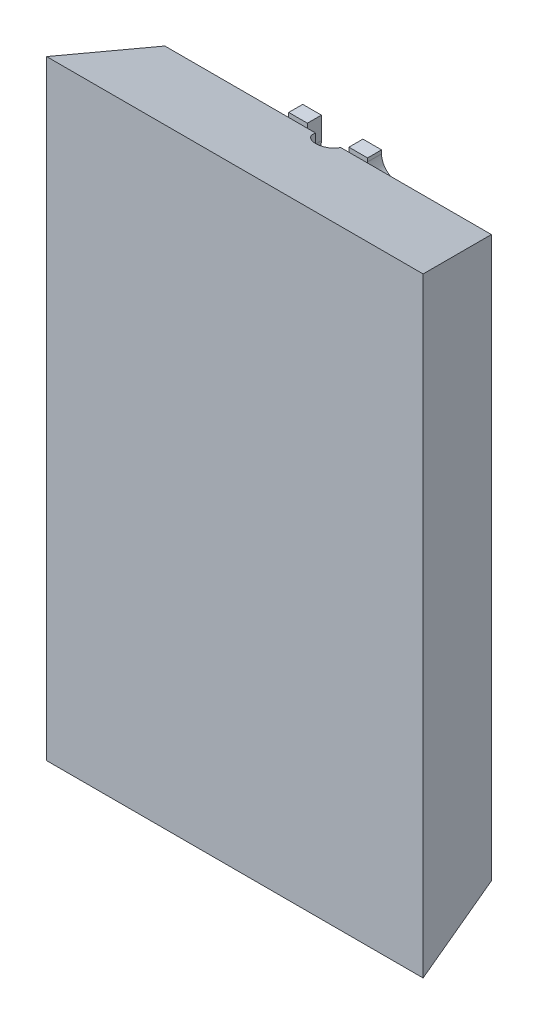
ISO-10303-21;
HEADER;
FILE_DESCRIPTION(('STEP AP214'),'2;1');
FILE_NAME('part.step','',(''),(''),'','','');
FILE_SCHEMA(('AUTOMOTIVE_DESIGN { 1 0 10303 214 1 1 1 1 }'));
ENDSEC;
DATA;
#1=APPLICATION_CONTEXT('core data for automotive mechanical design processes');
#2=APPLICATION_PROTOCOL_DEFINITION('international standard','automotive_design',2000,#1);
#3=PRODUCT_CONTEXT('',#1,'mechanical');
#4=PRODUCT('Part','Part','',(#3));
#5=PRODUCT_RELATED_PRODUCT_CATEGORY('part','',(#4));
#6=PRODUCT_DEFINITION_FORMATION('','',#4);
#7=PRODUCT_DEFINITION_CONTEXT('part definition',#1,'design');
#8=PRODUCT_DEFINITION('design','',#6,#7);
#9=PRODUCT_DEFINITION_SHAPE('','',#8);
#10=(LENGTH_UNIT() NAMED_UNIT(*) SI_UNIT(.MILLI.,.METRE.));
#11=(NAMED_UNIT(*) PLANE_ANGLE_UNIT() SI_UNIT($,.RADIAN.));
#12=(NAMED_UNIT(*) SI_UNIT($,.STERADIAN.) SOLID_ANGLE_UNIT());
#13=UNCERTAINTY_MEASURE_WITH_UNIT(LENGTH_MEASURE(1.E-05),#10,'distance_accuracy_value','');
#14=(GEOMETRIC_REPRESENTATION_CONTEXT(3) GLOBAL_UNCERTAINTY_ASSIGNED_CONTEXT((#13)) GLOBAL_UNIT_ASSIGNED_CONTEXT((#10,
#11,#12)) REPRESENTATION_CONTEXT('',''));
#15=CARTESIAN_POINT('',(0.,0.,0.));
#16=DIRECTION('',(0.,0.,1.));
#17=DIRECTION('',(1.,0.,0.));
#18=AXIS2_PLACEMENT_3D('',#15,#16,#17);
#19=CARTESIAN_POINT('',(0.,0.,0.));
#20=DIRECTION('',(0.,0.,-1.));
#21=DIRECTION('',(-1.,0.,0.));
#22=AXIS2_PLACEMENT_3D('',#19,#20,#21);
#23=PLANE('',#22);
#24=CARTESIAN_POINT('',(-9.73574454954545,45.4140128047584,0.));
#25=DIRECTION('',(0.,0.,-1.));
#26=DIRECTION('',(-1.,0.,0.));
#27=AXIS2_PLACEMENT_3D('',#24,#25,#26);
#28=CIRCLE('',#27,2.25826325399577);
#29=CARTESIAN_POINT('',(-11.9940078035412,45.4140128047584,0.));
#30=VERTEX_POINT('',#29);
#31=EDGE_CURVE('E879',#30,#30,#28,.T.);
#32=ORIENTED_EDGE('',*,*,#31,.F.);
#33=EDGE_LOOP('',(#32));
#34=FACE_BOUND('',#33,.T.);
#35=DIRECTION('',(0.,1.,0.));
#36=VECTOR('',#35,1.);
#37=CARTESIAN_POINT('',(-2.22503401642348,53.1,0.));
#38=LINE('',#37,#36);
#39=CARTESIAN_POINT('',(-2.22503401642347,53.1,0.));
#40=VERTEX_POINT('',#39);
#41=CARTESIAN_POINT('',(-2.22503401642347,55.,0.));
#42=VERTEX_POINT('',#41);
#43=EDGE_CURVE('E910',#40,#42,#38,.T.);
#44=ORIENTED_EDGE('',*,*,#43,.T.);
#45=DIRECTION('',(-1.,0.,0.));
#46=VECTOR('',#45,1.);
#47=CARTESIAN_POINT('',(17.5,55.,0.));
#48=LINE('',#47,#46);
#49=CARTESIAN_POINT('',(-1.33138479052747,55.,0.));
#50=VERTEX_POINT('',#49);
#51=EDGE_CURVE('E1250',#50,#42,#48,.T.);
#52=ORIENTED_EDGE('',*,*,#51,.F.);
#53=DIRECTION('',(0.,-1.,0.));
#54=VECTOR('',#53,1.);
#55=CARTESIAN_POINT('',(-1.33138479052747,0.,0.));
#56=LINE('',#55,#54);
#57=CARTESIAN_POINT('',(-1.33138479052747,50.,0.));
#58=VERTEX_POINT('',#57);
#59=EDGE_CURVE('E12',#58,#50,#56,.F.);
#60=ORIENTED_EDGE('',*,*,#59,.F.);
#61=DIRECTION('',(1.,0.,0.));
#62=VECTOR('',#61,1.);
#63=CARTESIAN_POINT('',(0.,50.,0.));
#64=LINE('',#63,#62);
#65=CARTESIAN_POINT('',(-4.30000000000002,50.,0.));
#66=VERTEX_POINT('',#65);
#67=EDGE_CURVE('E128',#66,#58,#64,.T.);
#68=ORIENTED_EDGE('',*,*,#67,.F.);
#69=CARTESIAN_POINT('',(-4.30000000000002,49.3000000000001,0.));
#70=DIRECTION('',(0.,0.,-1.));
#71=DIRECTION('',(-1.,0.,0.));
#72=AXIS2_PLACEMENT_3D('',#69,#70,#71);
#73=CIRCLE('',#72,0.7);
#74=CARTESIAN_POINT('',(-5.00000000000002,49.3000000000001,0.));
#75=VERTEX_POINT('',#74);
#76=EDGE_CURVE('E1543',#75,#66,#73,.T.);
#77=ORIENTED_EDGE('',*,*,#76,.F.);
#78=DIRECTION('',(0.,-1.,0.));
#79=VECTOR('',#78,1.);
#80=CARTESIAN_POINT('',(-5.00000000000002,0.,0.));
#81=LINE('',#80,#79);
#82=CARTESIAN_POINT('',(-5.00000000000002,48.7,0.));
#83=VERTEX_POINT('',#82);
#84=EDGE_CURVE('E1542',#83,#75,#81,.F.);
#85=ORIENTED_EDGE('',*,*,#84,.F.);
#86=CARTESIAN_POINT('',(-4.30000000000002,48.7,0.));
#87=DIRECTION('',(0.,0.,-1.));
#88=DIRECTION('',(-1.,0.,0.));
#89=AXIS2_PLACEMENT_3D('',#86,#87,#88);
#90=CIRCLE('',#89,0.7);
#91=CARTESIAN_POINT('',(-4.30000000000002,48.,0.));
#92=VERTEX_POINT('',#91);
#93=EDGE_CURVE('E1540',#92,#83,#90,.T.);
#94=ORIENTED_EDGE('',*,*,#93,.F.);
#95=DIRECTION('',(-1.,0.,0.));
#96=VECTOR('',#95,1.);
#97=CARTESIAN_POINT('',(0.,48.,0.));
#98=LINE('',#97,#96);
#99=CARTESIAN_POINT('',(-3.5,48.,0.));
#100=VERTEX_POINT('',#99);
#101=EDGE_CURVE('E1289',#100,#92,#98,.T.);
#102=ORIENTED_EDGE('',*,*,#101,.F.);
#103=DIRECTION('',(0.,-1.,0.));
#104=VECTOR('',#103,1.);
#105=CARTESIAN_POINT('',(-3.5,0.,0.));
#106=LINE('',#105,#104);
#107=CARTESIAN_POINT('',(-3.5,46.4000000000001,0.));
#108=VERTEX_POINT('',#107);
#109=EDGE_CURVE('E1538',#108,#100,#106,.F.);
#110=ORIENTED_EDGE('',*,*,#109,.F.);
#111=DIRECTION('',(1.,0.,0.));
#112=VECTOR('',#111,1.);
#113=CARTESIAN_POINT('',(0.,46.3999999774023,0.));
#114=LINE('',#113,#112);
#115=CARTESIAN_POINT('',(-4.29999999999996,46.3999999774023,0.));
#116=VERTEX_POINT('',#115);
#117=EDGE_CURVE('E1294',#116,#108,#114,.T.);
#118=ORIENTED_EDGE('',*,*,#117,.F.);
#119=CARTESIAN_POINT('',(-4.29999999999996,45.6999999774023,0.));
#120=DIRECTION('',(0.,0.,-1.));
#121=DIRECTION('',(-1.,0.,0.));
#122=AXIS2_PLACEMENT_3D('',#119,#120,#121);
#123=CIRCLE('',#122,0.7);
#124=CARTESIAN_POINT('',(-4.99999999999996,45.6999999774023,0.));
#125=VERTEX_POINT('',#124);
#126=EDGE_CURVE('E1536',#125,#116,#123,.T.);
#127=ORIENTED_EDGE('',*,*,#126,.F.);
#128=DIRECTION('',(0.,-1.,0.));
#129=VECTOR('',#128,1.);
#130=CARTESIAN_POINT('',(-4.99999999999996,0.,0.));
#131=LINE('',#130,#129);
#132=CARTESIAN_POINT('',(-4.99999999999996,45.5999999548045,0.));
#133=VERTEX_POINT('',#132);
#134=EDGE_CURVE('E1534',#133,#125,#131,.F.);
#135=ORIENTED_EDGE('',*,*,#134,.F.);
#136=CARTESIAN_POINT('',(-4.29999999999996,45.5999999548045,0.));
#137=DIRECTION('',(0.,0.,-1.));
#138=DIRECTION('',(-1.,0.,0.));
#139=AXIS2_PLACEMENT_3D('',#136,#137,#138);
#140=CIRCLE('',#139,0.7);
#141=CARTESIAN_POINT('',(-4.29999999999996,44.8999999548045,0.));
#142=VERTEX_POINT('',#141);
#143=EDGE_CURVE('E1532',#142,#133,#140,.T.);
#144=ORIENTED_EDGE('',*,*,#143,.F.);
#145=DIRECTION('',(-1.,0.,0.));
#146=VECTOR('',#145,1.);
#147=CARTESIAN_POINT('',(0.,44.8999999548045,0.));
#148=LINE('',#147,#146);
#149=CARTESIAN_POINT('',(-3.50000000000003,44.8999999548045,0.));
#150=VERTEX_POINT('',#149);
#151=EDGE_CURVE('E1303',#150,#142,#148,.T.);
#152=ORIENTED_EDGE('',*,*,#151,.F.);
#153=DIRECTION('',(0.,-1.,0.));
#154=VECTOR('',#153,1.);
#155=CARTESIAN_POINT('',(-3.50000000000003,0.,0.));
#156=LINE('',#155,#154);
#157=CARTESIAN_POINT('',(-3.50000000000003,43.2999999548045,0.));
#158=VERTEX_POINT('',#157);
#159=EDGE_CURVE('E1530',#158,#150,#156,.F.);
#160=ORIENTED_EDGE('',*,*,#159,.F.);
#161=DIRECTION('',(1.,0.,0.));
#162=VECTOR('',#161,1.);
#163=CARTESIAN_POINT('',(0.,43.2999999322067,0.));
#164=LINE('',#163,#162);
#165=CARTESIAN_POINT('',(-4.30000000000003,43.2999999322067,0.));
#166=VERTEX_POINT('',#165);
#167=EDGE_CURVE('E1308',#166,#158,#164,.T.);
#168=ORIENTED_EDGE('',*,*,#167,.F.);
#169=CARTESIAN_POINT('',(-4.30000000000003,42.5999999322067,0.));
#170=DIRECTION('',(0.,0.,-1.));
#171=DIRECTION('',(-1.,0.,0.));
#172=AXIS2_PLACEMENT_3D('',#169,#170,#171);
#173=CIRCLE('',#172,0.7);
#174=CARTESIAN_POINT('',(-5.00000000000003,42.5999999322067,0.));
#175=VERTEX_POINT('',#174);
#176=EDGE_CURVE('E1528',#175,#166,#173,.T.);
#177=ORIENTED_EDGE('',*,*,#176,.F.);
#178=DIRECTION('',(0.,-1.,0.));
#179=VECTOR('',#178,1.);
#180=CARTESIAN_POINT('',(-5.00000000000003,0.,0.));
#181=LINE('',#180,#179);
#182=CARTESIAN_POINT('',(-5.00000000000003,42.499999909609,0.));
#183=VERTEX_POINT('',#182);
#184=EDGE_CURVE('E1526',#183,#175,#181,.F.);
#185=ORIENTED_EDGE('',*,*,#184,.F.);
#186=CARTESIAN_POINT('',(-4.30000000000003,42.499999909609,0.));
#187=DIRECTION('',(0.,0.,-1.));
#188=DIRECTION('',(-1.,0.,0.));
#189=AXIS2_PLACEMENT_3D('',#186,#187,#188);
#190=CIRCLE('',#189,0.7);
#191=CARTESIAN_POINT('',(-4.30000000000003,41.799999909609,0.));
#192=VERTEX_POINT('',#191);
#193=EDGE_CURVE('E1524',#192,#183,#190,.T.);
#194=ORIENTED_EDGE('',*,*,#193,.F.);
#195=DIRECTION('',(-1.,0.,0.));
#196=VECTOR('',#195,1.);
#197=CARTESIAN_POINT('',(0.,41.799999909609,0.));
#198=LINE('',#197,#196);
#199=CARTESIAN_POINT('',(-3.50000000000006,41.799999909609,0.));
#200=VERTEX_POINT('',#199);
#201=EDGE_CURVE('E1317',#200,#192,#198,.T.);
#202=ORIENTED_EDGE('',*,*,#201,.F.);
#203=DIRECTION('',(0.,-1.,0.));
#204=VECTOR('',#203,1.);
#205=CARTESIAN_POINT('',(-3.50000000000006,0.,0.));
#206=LINE('',#205,#204);
#207=CARTESIAN_POINT('',(-3.50000000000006,40.199999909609,0.));
#208=VERTEX_POINT('',#207);
#209=EDGE_CURVE('E1522',#208,#200,#206,.F.);
#210=ORIENTED_EDGE('',*,*,#209,.F.);
#211=DIRECTION('',(1.,0.,0.));
#212=VECTOR('',#211,1.);
#213=CARTESIAN_POINT('',(0.,40.1999998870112,0.));
#214=LINE('',#213,#212);
#215=CARTESIAN_POINT('',(-4.30000000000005,40.1999998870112,0.));
#216=VERTEX_POINT('',#215);
#217=EDGE_CURVE('E1322',#216,#208,#214,.T.);
#218=ORIENTED_EDGE('',*,*,#217,.F.);
#219=CARTESIAN_POINT('',(-4.30000000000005,39.4999998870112,0.));
#220=DIRECTION('',(0.,0.,-1.));
#221=DIRECTION('',(-1.,0.,0.));
#222=AXIS2_PLACEMENT_3D('',#219,#220,#221);
#223=CIRCLE('',#222,0.7);
#224=CARTESIAN_POINT('',(-5.00000000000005,39.4999998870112,0.));
#225=VERTEX_POINT('',#224);
#226=EDGE_CURVE('E1520',#225,#216,#223,.T.);
#227=ORIENTED_EDGE('',*,*,#226,.F.);
#228=DIRECTION('',(0.,-1.,0.));
#229=VECTOR('',#228,1.);
#230=CARTESIAN_POINT('',(-5.00000000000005,0.,0.));
#231=LINE('',#230,#229);
#232=CARTESIAN_POINT('',(-5.00000000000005,39.3999998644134,0.));
#233=VERTEX_POINT('',#232);
#234=EDGE_CURVE('E1518',#233,#225,#231,.F.);
#235=ORIENTED_EDGE('',*,*,#234,.F.);
#236=CARTESIAN_POINT('',(-4.30000000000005,39.3999998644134,0.));
#237=DIRECTION('',(0.,0.,-1.));
#238=DIRECTION('',(-1.,0.,0.));
#239=AXIS2_PLACEMENT_3D('',#236,#237,#238);
#240=CIRCLE('',#239,0.7);
#241=CARTESIAN_POINT('',(-4.30000000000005,38.6999998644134,0.));
#242=VERTEX_POINT('',#241);
#243=EDGE_CURVE('E1516',#242,#233,#240,.T.);
#244=ORIENTED_EDGE('',*,*,#243,.F.);
#245=DIRECTION('',(-1.,0.,0.));
#246=VECTOR('',#245,1.);
#247=CARTESIAN_POINT('',(0.,38.6999998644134,0.));
#248=LINE('',#247,#246);
#249=CARTESIAN_POINT('',(-3.5000000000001,38.6999998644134,0.));
#250=VERTEX_POINT('',#249);
#251=EDGE_CURVE('E1331',#250,#242,#248,.T.);
#252=ORIENTED_EDGE('',*,*,#251,.F.);
#253=DIRECTION('',(0.,-1.,0.));
#254=VECTOR('',#253,1.);
#255=CARTESIAN_POINT('',(-3.5000000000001,0.,0.));
#256=LINE('',#255,#254);
#257=CARTESIAN_POINT('',(-3.5000000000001,37.0999998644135,0.));
#258=VERTEX_POINT('',#257);
#259=EDGE_CURVE('E1514',#258,#250,#256,.F.);
#260=ORIENTED_EDGE('',*,*,#259,.F.);
#261=DIRECTION('',(1.,0.,0.));
#262=VECTOR('',#261,1.);
#263=CARTESIAN_POINT('',(0.,37.0999998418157,0.));
#264=LINE('',#263,#262);
#265=CARTESIAN_POINT('',(-4.30000000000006,37.0999998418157,0.));
#266=VERTEX_POINT('',#265);
#267=EDGE_CURVE('E1336',#266,#258,#264,.T.);
#268=ORIENTED_EDGE('',*,*,#267,.F.);
#269=CARTESIAN_POINT('',(-4.30000000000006,36.3999998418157,0.));
#270=DIRECTION('',(0.,0.,-1.));
#271=DIRECTION('',(-1.,0.,0.));
#272=AXIS2_PLACEMENT_3D('',#269,#270,#271);
#273=CIRCLE('',#272,0.7);
#274=CARTESIAN_POINT('',(-5.00000000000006,36.3999998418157,0.));
#275=VERTEX_POINT('',#274);
#276=EDGE_CURVE('E1512',#275,#266,#273,.T.);
#277=ORIENTED_EDGE('',*,*,#276,.F.);
#278=DIRECTION('',(0.,-1.,0.));
#279=VECTOR('',#278,1.);
#280=CARTESIAN_POINT('',(-5.00000000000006,0.,0.));
#281=LINE('',#280,#279);
#282=CARTESIAN_POINT('',(-5.00000000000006,36.2999998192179,0.));
#283=VERTEX_POINT('',#282);
#284=EDGE_CURVE('E1510',#283,#275,#281,.F.);
#285=ORIENTED_EDGE('',*,*,#284,.F.);
#286=CARTESIAN_POINT('',(-4.30000000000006,36.2999998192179,0.));
#287=DIRECTION('',(0.,0.,-1.));
#288=DIRECTION('',(-1.,0.,0.));
#289=AXIS2_PLACEMENT_3D('',#286,#287,#288);
#290=CIRCLE('',#289,0.7);
#291=CARTESIAN_POINT('',(-4.30000000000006,35.5999998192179,0.));
#292=VERTEX_POINT('',#291);
#293=EDGE_CURVE('E1508',#292,#283,#290,.T.);
#294=ORIENTED_EDGE('',*,*,#293,.F.);
#295=DIRECTION('',(-1.,0.,0.));
#296=VECTOR('',#295,1.);
#297=CARTESIAN_POINT('',(0.,35.5999998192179,0.));
#298=LINE('',#297,#296);
#299=CARTESIAN_POINT('',(-3.50000000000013,35.5999998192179,0.));
#300=VERTEX_POINT('',#299);
#301=EDGE_CURVE('E1345',#300,#292,#298,.T.);
#302=ORIENTED_EDGE('',*,*,#301,.F.);
#303=DIRECTION('',(0.,-1.,0.));
#304=VECTOR('',#303,1.);
#305=CARTESIAN_POINT('',(-3.50000000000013,0.,0.));
#306=LINE('',#305,#304);
#307=CARTESIAN_POINT('',(-3.50000000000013,33.9999998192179,0.));
#308=VERTEX_POINT('',#307);
#309=EDGE_CURVE('E1506',#308,#300,#306,.F.);
#310=ORIENTED_EDGE('',*,*,#309,.F.);
#311=DIRECTION('',(1.,0.,0.));
#312=VECTOR('',#311,1.);
#313=CARTESIAN_POINT('',(0.,33.9999997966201,0.));
#314=LINE('',#313,#312);
#315=CARTESIAN_POINT('',(-4.30000000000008,33.9999997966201,0.));
#316=VERTEX_POINT('',#315);
#317=EDGE_CURVE('E1350',#316,#308,#314,.T.);
#318=ORIENTED_EDGE('',*,*,#317,.F.);
#319=CARTESIAN_POINT('',(-4.30000000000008,33.2999997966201,0.));
#320=DIRECTION('',(0.,0.,-1.));
#321=DIRECTION('',(-1.,0.,0.));
#322=AXIS2_PLACEMENT_3D('',#319,#320,#321);
#323=CIRCLE('',#322,0.7);
#324=CARTESIAN_POINT('',(-5.00000000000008,33.2999997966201,0.));
#325=VERTEX_POINT('',#324);
#326=EDGE_CURVE('E1504',#325,#316,#323,.T.);
#327=ORIENTED_EDGE('',*,*,#326,.F.);
#328=DIRECTION('',(0.,-1.,0.));
#329=VECTOR('',#328,1.);
#330=CARTESIAN_POINT('',(-5.00000000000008,0.,0.));
#331=LINE('',#330,#329);
#332=CARTESIAN_POINT('',(-5.00000000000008,33.1999997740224,0.));
#333=VERTEX_POINT('',#332);
#334=EDGE_CURVE('E1502',#333,#325,#331,.F.);
#335=ORIENTED_EDGE('',*,*,#334,.F.);
#336=CARTESIAN_POINT('',(-4.30000000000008,33.1999997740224,0.));
#337=DIRECTION('',(0.,0.,-1.));
#338=DIRECTION('',(-1.,0.,0.));
#339=AXIS2_PLACEMENT_3D('',#336,#337,#338);
#340=CIRCLE('',#339,0.7);
#341=CARTESIAN_POINT('',(-4.30000000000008,32.4999997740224,0.));
#342=VERTEX_POINT('',#341);
#343=EDGE_CURVE('E1500',#342,#333,#340,.T.);
#344=ORIENTED_EDGE('',*,*,#343,.F.);
#345=DIRECTION('',(-1.,0.,0.));
#346=VECTOR('',#345,1.);
#347=CARTESIAN_POINT('',(0.,32.4999997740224,0.));
#348=LINE('',#347,#346);
#349=CARTESIAN_POINT('',(-3.50000000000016,32.4999997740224,0.));
#350=VERTEX_POINT('',#349);
#351=EDGE_CURVE('E1359',#350,#342,#348,.T.);
#352=ORIENTED_EDGE('',*,*,#351,.F.);
#353=DIRECTION('',(0.,-1.,0.));
#354=VECTOR('',#353,1.);
#355=CARTESIAN_POINT('',(-3.50000000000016,0.,0.));
#356=LINE('',#355,#354);
#357=CARTESIAN_POINT('',(-3.50000000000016,30.8999997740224,0.));
#358=VERTEX_POINT('',#357);
#359=EDGE_CURVE('E1498',#358,#350,#356,.F.);
#360=ORIENTED_EDGE('',*,*,#359,.F.);
#361=DIRECTION('',(1.,0.,0.));
#362=VECTOR('',#361,1.);
#363=CARTESIAN_POINT('',(0.,30.8999997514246,0.));
#364=LINE('',#363,#362);
#365=CARTESIAN_POINT('',(-4.3000000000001,30.8999997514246,0.));
#366=VERTEX_POINT('',#365);
#367=EDGE_CURVE('E1364',#366,#358,#364,.T.);
#368=ORIENTED_EDGE('',*,*,#367,.F.);
#369=CARTESIAN_POINT('',(-4.3000000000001,30.1999997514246,0.));
#370=DIRECTION('',(0.,0.,-1.));
#371=DIRECTION('',(-1.,0.,0.));
#372=AXIS2_PLACEMENT_3D('',#369,#370,#371);
#373=CIRCLE('',#372,0.7);
#374=CARTESIAN_POINT('',(-5.0000000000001,30.1999997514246,0.));
#375=VERTEX_POINT('',#374);
#376=EDGE_CURVE('E1496',#375,#366,#373,.T.);
#377=ORIENTED_EDGE('',*,*,#376,.F.);
#378=DIRECTION('',(0.,-1.,0.));
#379=VECTOR('',#378,1.);
#380=CARTESIAN_POINT('',(-5.0000000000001,0.,0.));
#381=LINE('',#380,#379);
#382=CARTESIAN_POINT('',(-5.0000000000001,30.0999997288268,0.));
#383=VERTEX_POINT('',#382);
#384=EDGE_CURVE('E1494',#383,#375,#381,.F.);
#385=ORIENTED_EDGE('',*,*,#384,.F.);
#386=CARTESIAN_POINT('',(-4.3000000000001,30.0999997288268,0.));
#387=DIRECTION('',(0.,0.,-1.));
#388=DIRECTION('',(-1.,0.,0.));
#389=AXIS2_PLACEMENT_3D('',#386,#387,#388);
#390=CIRCLE('',#389,0.7);
#391=CARTESIAN_POINT('',(-4.3000000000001,29.3999997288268,0.));
#392=VERTEX_POINT('',#391);
#393=EDGE_CURVE('E1492',#392,#383,#390,.T.);
#394=ORIENTED_EDGE('',*,*,#393,.F.);
#395=DIRECTION('',(-1.,0.,0.));
#396=VECTOR('',#395,1.);
#397=CARTESIAN_POINT('',(0.,29.3999997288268,0.));
#398=LINE('',#397,#396);
#399=CARTESIAN_POINT('',(-3.50000000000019,29.3999997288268,0.));
#400=VERTEX_POINT('',#399);
#401=EDGE_CURVE('E1373',#400,#392,#398,.T.);
#402=ORIENTED_EDGE('',*,*,#401,.F.);
#403=DIRECTION('',(0.,-1.,0.));
#404=VECTOR('',#403,1.);
#405=CARTESIAN_POINT('',(-3.50000000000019,0.,0.));
#406=LINE('',#405,#404);
#407=CARTESIAN_POINT('',(-3.50000000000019,27.7999997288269,0.));
#408=VERTEX_POINT('',#407);
#409=EDGE_CURVE('E1490',#408,#400,#406,.F.);
#410=ORIENTED_EDGE('',*,*,#409,.F.);
#411=DIRECTION('',(1.,0.,0.));
#412=VECTOR('',#411,1.);
#413=CARTESIAN_POINT('',(0.,27.7999997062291,0.));
#414=LINE('',#413,#412);
#415=CARTESIAN_POINT('',(-4.30000000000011,27.7999997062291,0.));
#416=VERTEX_POINT('',#415);
#417=EDGE_CURVE('E1378',#416,#408,#414,.T.);
#418=ORIENTED_EDGE('',*,*,#417,.F.);
#419=CARTESIAN_POINT('',(-4.30000000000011,27.0999997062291,0.));
#420=DIRECTION('',(0.,0.,-1.));
#421=DIRECTION('',(-1.,0.,0.));
#422=AXIS2_PLACEMENT_3D('',#419,#420,#421);
#423=CIRCLE('',#422,0.7);
#424=CARTESIAN_POINT('',(-5.00000000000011,27.0999997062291,0.));
#425=VERTEX_POINT('',#424);
#426=EDGE_CURVE('E1488',#425,#416,#423,.T.);
#427=ORIENTED_EDGE('',*,*,#426,.F.);
#428=DIRECTION('',(0.,-1.,0.));
#429=VECTOR('',#428,1.);
#430=CARTESIAN_POINT('',(-5.00000000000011,0.,0.));
#431=LINE('',#430,#429);
#432=CARTESIAN_POINT('',(-5.00000000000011,26.9999996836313,0.));
#433=VERTEX_POINT('',#432);
#434=EDGE_CURVE('E1486',#433,#425,#431,.F.);
#435=ORIENTED_EDGE('',*,*,#434,.F.);
#436=CARTESIAN_POINT('',(-4.30000000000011,26.9999996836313,0.));
#437=DIRECTION('',(0.,0.,-1.));
#438=DIRECTION('',(-1.,0.,0.));
#439=AXIS2_PLACEMENT_3D('',#436,#437,#438);
#440=CIRCLE('',#439,0.7);
#441=CARTESIAN_POINT('',(-4.30000000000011,26.2999996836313,0.));
#442=VERTEX_POINT('',#441);
#443=EDGE_CURVE('E1484',#442,#433,#440,.T.);
#444=ORIENTED_EDGE('',*,*,#443,.F.);
#445=DIRECTION('',(-1.,0.,0.));
#446=VECTOR('',#445,1.);
#447=CARTESIAN_POINT('',(0.,26.2999996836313,0.));
#448=LINE('',#447,#446);
#449=CARTESIAN_POINT('',(-3.50000000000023,26.2999996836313,0.));
#450=VERTEX_POINT('',#449);
#451=EDGE_CURVE('E1387',#450,#442,#448,.T.);
#452=ORIENTED_EDGE('',*,*,#451,.F.);
#453=DIRECTION('',(0.,-1.,0.));
#454=VECTOR('',#453,1.);
#455=CARTESIAN_POINT('',(-3.50000000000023,0.,0.));
#456=LINE('',#455,#454);
#457=CARTESIAN_POINT('',(-3.50000000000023,24.6999996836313,0.));
#458=VERTEX_POINT('',#457);
#459=EDGE_CURVE('E1482',#458,#450,#456,.F.);
#460=ORIENTED_EDGE('',*,*,#459,.F.);
#461=DIRECTION('',(1.,0.,0.));
#462=VECTOR('',#461,1.);
#463=CARTESIAN_POINT('',(0.,24.6999996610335,0.));
#464=LINE('',#463,#462);
#465=CARTESIAN_POINT('',(-4.30000000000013,24.6999996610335,0.));
#466=VERTEX_POINT('',#465);
#467=EDGE_CURVE('E1392',#466,#458,#464,.T.);
#468=ORIENTED_EDGE('',*,*,#467,.F.);
#469=CARTESIAN_POINT('',(-4.30000000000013,23.9999996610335,0.));
#470=DIRECTION('',(0.,0.,-1.));
#471=DIRECTION('',(-1.,0.,0.));
#472=AXIS2_PLACEMENT_3D('',#469,#470,#471);
#473=CIRCLE('',#472,0.7);
#474=CARTESIAN_POINT('',(-5.00000000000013,23.9999996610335,0.));
#475=VERTEX_POINT('',#474);
#476=EDGE_CURVE('E1480',#475,#466,#473,.T.);
#477=ORIENTED_EDGE('',*,*,#476,.F.);
#478=DIRECTION('',(0.,-1.,0.));
#479=VECTOR('',#478,1.);
#480=CARTESIAN_POINT('',(-5.00000000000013,0.,0.));
#481=LINE('',#480,#479);
#482=CARTESIAN_POINT('',(-5.00000000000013,23.8999996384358,0.));
#483=VERTEX_POINT('',#482);
#484=EDGE_CURVE('E1478',#483,#475,#481,.F.);
#485=ORIENTED_EDGE('',*,*,#484,.F.);
#486=CARTESIAN_POINT('',(-4.30000000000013,23.8999996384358,0.));
#487=DIRECTION('',(0.,0.,-1.));
#488=DIRECTION('',(-1.,0.,0.));
#489=AXIS2_PLACEMENT_3D('',#486,#487,#488);
#490=CIRCLE('',#489,0.7);
#491=CARTESIAN_POINT('',(-4.30000000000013,23.1999996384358,0.));
#492=VERTEX_POINT('',#491);
#493=EDGE_CURVE('E1476',#492,#483,#490,.T.);
#494=ORIENTED_EDGE('',*,*,#493,.F.);
#495=DIRECTION('',(-1.,0.,0.));
#496=VECTOR('',#495,1.);
#497=CARTESIAN_POINT('',(0.,23.1999996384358,0.));
#498=LINE('',#497,#496);
#499=CARTESIAN_POINT('',(-3.50000000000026,23.1999996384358,0.));
#500=VERTEX_POINT('',#499);
#501=EDGE_CURVE('E1401',#500,#492,#498,.T.);
#502=ORIENTED_EDGE('',*,*,#501,.F.);
#503=DIRECTION('',(0.,-1.,0.));
#504=VECTOR('',#503,1.);
#505=CARTESIAN_POINT('',(-3.50000000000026,0.,0.));
#506=LINE('',#505,#504);
#507=CARTESIAN_POINT('',(-3.50000000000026,21.5999996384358,0.));
#508=VERTEX_POINT('',#507);
#509=EDGE_CURVE('E1474',#508,#500,#506,.F.);
#510=ORIENTED_EDGE('',*,*,#509,.F.);
#511=DIRECTION('',(1.,0.,0.));
#512=VECTOR('',#511,1.);
#513=CARTESIAN_POINT('',(0.,21.599999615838,0.));
#514=LINE('',#513,#512);
#515=CARTESIAN_POINT('',(-4.30000000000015,21.599999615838,0.));
#516=VERTEX_POINT('',#515);
#517=EDGE_CURVE('E1406',#516,#508,#514,.T.);
#518=ORIENTED_EDGE('',*,*,#517,.F.);
#519=CARTESIAN_POINT('',(-4.30000000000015,20.899999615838,0.));
#520=DIRECTION('',(0.,0.,-1.));
#521=DIRECTION('',(-1.,0.,0.));
#522=AXIS2_PLACEMENT_3D('',#519,#520,#521);
#523=CIRCLE('',#522,0.7);
#524=CARTESIAN_POINT('',(-5.00000000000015,20.899999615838,0.));
#525=VERTEX_POINT('',#524);
#526=EDGE_CURVE('E1472',#525,#516,#523,.T.);
#527=ORIENTED_EDGE('',*,*,#526,.F.);
#528=DIRECTION('',(0.,-1.,0.));
#529=VECTOR('',#528,1.);
#530=CARTESIAN_POINT('',(-5.00000000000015,0.,0.));
#531=LINE('',#530,#529);
#532=CARTESIAN_POINT('',(-5.00000000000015,20.7999995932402,0.));
#533=VERTEX_POINT('',#532);
#534=EDGE_CURVE('E1470',#533,#525,#531,.F.);
#535=ORIENTED_EDGE('',*,*,#534,.F.);
#536=CARTESIAN_POINT('',(-4.30000000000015,20.7999995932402,0.));
#537=DIRECTION('',(0.,0.,-1.));
#538=DIRECTION('',(-1.,0.,0.));
#539=AXIS2_PLACEMENT_3D('',#536,#537,#538);
#540=CIRCLE('',#539,0.7);
#541=CARTESIAN_POINT('',(-4.30000000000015,20.0999995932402,0.));
#542=VERTEX_POINT('',#541);
#543=EDGE_CURVE('E1468',#542,#533,#540,.T.);
#544=ORIENTED_EDGE('',*,*,#543,.F.);
#545=DIRECTION('',(-1.,0.,0.));
#546=VECTOR('',#545,1.);
#547=CARTESIAN_POINT('',(0.,20.0999995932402,0.));
#548=LINE('',#547,#546);
#549=CARTESIAN_POINT('',(-3.50000000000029,20.0999995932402,0.));
#550=VERTEX_POINT('',#549);
#551=EDGE_CURVE('E1415',#550,#542,#548,.T.);
#552=ORIENTED_EDGE('',*,*,#551,.F.);
#553=DIRECTION('',(0.,-1.,0.));
#554=VECTOR('',#553,1.);
#555=CARTESIAN_POINT('',(-3.50000000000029,0.,0.));
#556=LINE('',#555,#554);
#557=CARTESIAN_POINT('',(-3.50000000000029,18.4999995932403,0.));
#558=VERTEX_POINT('',#557);
#559=EDGE_CURVE('E1466',#558,#550,#556,.F.);
#560=ORIENTED_EDGE('',*,*,#559,.F.);
#561=DIRECTION('',(1.,0.,0.));
#562=VECTOR('',#561,1.);
#563=CARTESIAN_POINT('',(0.,18.4999995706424,0.));
#564=LINE('',#563,#562);
#565=CARTESIAN_POINT('',(-4.30000000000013,18.4999995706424,0.));
#566=VERTEX_POINT('',#565);
#567=EDGE_CURVE('E1420',#566,#558,#564,.T.);
#568=ORIENTED_EDGE('',*,*,#567,.F.);
#569=CARTESIAN_POINT('',(-4.30000000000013,17.7999995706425,0.));
#570=DIRECTION('',(0.,0.,-1.));
#571=DIRECTION('',(-1.,0.,0.));
#572=AXIS2_PLACEMENT_3D('',#569,#570,#571);
#573=CIRCLE('',#572,0.7);
#574=CARTESIAN_POINT('',(-5.00000000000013,17.7999995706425,0.));
#575=VERTEX_POINT('',#574);
#576=EDGE_CURVE('E1464',#575,#566,#573,.T.);
#577=ORIENTED_EDGE('',*,*,#576,.F.);
#578=DIRECTION('',(0.,-1.,0.));
#579=VECTOR('',#578,1.);
#580=CARTESIAN_POINT('',(-5.00000000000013,0.,0.));
#581=LINE('',#580,#579);
#582=CARTESIAN_POINT('',(-5.00000000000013,17.0937422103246,0.));
#583=VERTEX_POINT('',#582);
#584=EDGE_CURVE('E1462',#583,#575,#581,.F.);
#585=ORIENTED_EDGE('',*,*,#584,.F.);
#586=CARTESIAN_POINT('',(-5.70000000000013,17.0937422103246,0.));
#587=DIRECTION('',(0.,0.,-1.));
#588=DIRECTION('',(-1.,0.,0.));
#589=AXIS2_PLACEMENT_3D('',#586,#587,#588);
#590=CIRCLE('',#589,0.7);
#591=CARTESIAN_POINT('',(-5.02466532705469,16.9095600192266,0.));
#592=VERTEX_POINT('',#591);
#593=EDGE_CURVE('E1459',#583,#592,#590,.T.);
#594=ORIENTED_EDGE('',*,*,#593,.T.);
#595=DIRECTION('',(0.263117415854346,0.964763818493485,0.));
#596=VECTOR('',#595,1.);
#597=CARTESIAN_POINT('',(0.,35.3333321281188,0.));
#598=LINE('',#597,#596);
#599=CARTESIAN_POINT('',(-7.7588593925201,6.88418219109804,0.));
#600=VERTEX_POINT('',#599);
#601=EDGE_CURVE('E1457',#600,#592,#598,.T.);
#602=ORIENTED_EDGE('',*,*,#601,.F.);
#603=CARTESIAN_POINT('',(-7.08352471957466,6.7,0.));
#604=DIRECTION('',(0.,0.,-1.));
#605=DIRECTION('',(-1.,0.,0.));
#606=AXIS2_PLACEMENT_3D('',#603,#604,#605);
#607=CIRCLE('',#606,0.7);
#608=CARTESIAN_POINT('',(-7.08352471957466,6.,0.));
#609=VERTEX_POINT('',#608);
#610=EDGE_CURVE('E1455',#609,#600,#607,.T.);
#611=ORIENTED_EDGE('',*,*,#610,.F.);
#612=DIRECTION('',(-1.,0.,0.));
#613=VECTOR('',#612,1.);
#614=CARTESIAN_POINT('',(0.,6.,0.));
#615=LINE('',#614,#613);
#616=CARTESIAN_POINT('',(-7.,6.,0.));
#617=VERTEX_POINT('',#616);
#618=EDGE_CURVE('E1434',#617,#609,#615,.T.);
#619=ORIENTED_EDGE('',*,*,#618,.F.);
#620=DIRECTION('',(0.,-1.,0.));
#621=VECTOR('',#620,1.);
#622=CARTESIAN_POINT('',(-7.,0.,0.));
#623=LINE('',#622,#621);
#624=CARTESIAN_POINT('',(-7.,4.,0.));
#625=VERTEX_POINT('',#624);
#626=EDGE_CURVE('E1453',#625,#617,#623,.F.);
#627=ORIENTED_EDGE('',*,*,#626,.F.);
#628=DIRECTION('',(1.,0.,0.));
#629=VECTOR('',#628,1.);
#630=CARTESIAN_POINT('',(0.,4.,0.));
#631=LINE('',#630,#629);
#632=CARTESIAN_POINT('',(-7.3,4.,0.));
#633=VERTEX_POINT('',#632);
#634=EDGE_CURVE('E1439',#633,#625,#631,.T.);
#635=ORIENTED_EDGE('',*,*,#634,.F.);
#636=CARTESIAN_POINT('',(-7.3,3.3,0.));
#637=DIRECTION('',(0.,0.,-1.));
#638=DIRECTION('',(-1.,0.,0.));
#639=AXIS2_PLACEMENT_3D('',#636,#637,#638);
#640=CIRCLE('',#639,0.7);
#641=CARTESIAN_POINT('',(-8.,3.3,0.));
#642=VERTEX_POINT('',#641);
#643=EDGE_CURVE('E1451',#642,#633,#640,.T.);
#644=ORIENTED_EDGE('',*,*,#643,.F.);
#645=DIRECTION('',(0.,-1.,0.));
#646=VECTOR('',#645,1.);
#647=CARTESIAN_POINT('',(-8.,0.,0.));
#648=LINE('',#647,#646);
#649=CARTESIAN_POINT('',(-8.,0.7,0.));
#650=VERTEX_POINT('',#649);
#651=EDGE_CURVE('E1449',#650,#642,#648,.F.);
#652=ORIENTED_EDGE('',*,*,#651,.F.);
#653=CARTESIAN_POINT('',(-7.3,0.7,0.));
#654=DIRECTION('',(0.,0.,-1.));
#655=DIRECTION('',(-1.,0.,0.));
#656=AXIS2_PLACEMENT_3D('',#653,#654,#655);
#657=CIRCLE('',#656,0.7);
#658=CARTESIAN_POINT('',(-7.3,0.,0.));
#659=VERTEX_POINT('',#658);
#660=EDGE_CURVE('E1447',#659,#650,#657,.T.);
#661=ORIENTED_EDGE('',*,*,#660,.F.);
#662=DIRECTION('',(-1.,0.,0.));
#663=VECTOR('',#662,1.);
#664=CARTESIAN_POINT('',(0.,0.,0.));
#665=LINE('',#664,#663);
#666=CARTESIAN_POINT('',(7.3,0.,0.));
#667=VERTEX_POINT('',#666);
#668=EDGE_CURVE('E1445',#667,#659,#665,.T.);
#669=ORIENTED_EDGE('',*,*,#668,.F.);
#670=CARTESIAN_POINT('',(7.3,0.7,0.));
#671=DIRECTION('',(0.,0.,-1.));
#672=DIRECTION('',(-1.,0.,0.));
#673=AXIS2_PLACEMENT_3D('',#670,#671,#672);
#674=CIRCLE('',#673,0.7);
#675=CARTESIAN_POINT('',(8.,0.7,0.));
#676=VERTEX_POINT('',#675);
#677=EDGE_CURVE('E1443',#676,#667,#674,.T.);
#678=ORIENTED_EDGE('',*,*,#677,.F.);
#679=DIRECTION('',(0.,-1.,0.));
#680=VECTOR('',#679,1.);
#681=CARTESIAN_POINT('',(8.,0.,0.));
#682=LINE('',#681,#680);
#683=CARTESIAN_POINT('',(8.,3.3,0.));
#684=VERTEX_POINT('',#683);
#685=EDGE_CURVE('E1441',#684,#676,#682,.T.);
#686=ORIENTED_EDGE('',*,*,#685,.F.);
#687=CARTESIAN_POINT('',(7.3,3.3,0.));
#688=DIRECTION('',(0.,0.,-1.));
#689=DIRECTION('',(-1.,0.,0.));
#690=AXIS2_PLACEMENT_3D('',#687,#688,#689);
#691=CIRCLE('',#690,0.7);
#692=CARTESIAN_POINT('',(7.3,4.,0.));
#693=VERTEX_POINT('',#692);
#694=EDGE_CURVE('E1438',#693,#684,#691,.T.);
#695=ORIENTED_EDGE('',*,*,#694,.F.);
#696=CARTESIAN_POINT('',(7.,4.,0.));
#697=VERTEX_POINT('',#696);
#698=EDGE_CURVE('E1436',#697,#693,#631,.T.);
#699=ORIENTED_EDGE('',*,*,#698,.F.);
#700=DIRECTION('',(0.,-1.,0.));
#701=VECTOR('',#700,1.);
#702=CARTESIAN_POINT('',(7.,0.,0.));
#703=LINE('',#702,#701);
#704=CARTESIAN_POINT('',(7.,6.,0.));
#705=VERTEX_POINT('',#704);
#706=EDGE_CURVE('E1433',#705,#697,#703,.T.);
#707=ORIENTED_EDGE('',*,*,#706,.F.);
#708=CARTESIAN_POINT('',(7.08352471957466,6.,0.));
#709=VERTEX_POINT('',#708);
#710=EDGE_CURVE('E1431',#709,#705,#615,.T.);
#711=ORIENTED_EDGE('',*,*,#710,.F.);
#712=CARTESIAN_POINT('',(7.08352471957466,6.7,0.));
#713=DIRECTION('',(0.,0.,-1.));
#714=DIRECTION('',(-1.,0.,0.));
#715=AXIS2_PLACEMENT_3D('',#712,#713,#714);
#716=CIRCLE('',#715,0.7);
#717=CARTESIAN_POINT('',(7.7588593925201,6.88418219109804,0.));
#718=VERTEX_POINT('',#717);
#719=EDGE_CURVE('E1429',#718,#709,#716,.T.);
#720=ORIENTED_EDGE('',*,*,#719,.F.);
#721=DIRECTION('',(0.263117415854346,-0.964763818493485,0.));
#722=VECTOR('',#721,1.);
#723=CARTESIAN_POINT('',(0.,35.3333321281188,0.));
#724=LINE('',#723,#722);
#725=CARTESIAN_POINT('',(5.02466532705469,16.9095600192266,0.));
#726=VERTEX_POINT('',#725);
#727=EDGE_CURVE('E1427',#726,#718,#724,.T.);
#728=ORIENTED_EDGE('',*,*,#727,.F.);
#729=CARTESIAN_POINT('',(5.70000000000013,17.0937422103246,0.));
#730=DIRECTION('',(0.,0.,-1.));
#731=DIRECTION('',(-1.,0.,0.));
#732=AXIS2_PLACEMENT_3D('',#729,#730,#731);
#733=CIRCLE('',#732,0.7);
#734=CARTESIAN_POINT('',(5.00000000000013,17.0937422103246,0.));
#735=VERTEX_POINT('',#734);
#736=EDGE_CURVE('E1424',#726,#735,#733,.T.);
#737=ORIENTED_EDGE('',*,*,#736,.T.);
#738=DIRECTION('',(0.,-1.,0.));
#739=VECTOR('',#738,1.);
#740=CARTESIAN_POINT('',(5.00000000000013,0.,0.));
#741=LINE('',#740,#739);
#742=CARTESIAN_POINT('',(5.00000000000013,17.7999995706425,0.));
#743=VERTEX_POINT('',#742);
#744=EDGE_CURVE('E1422',#743,#735,#741,.T.);
#745=ORIENTED_EDGE('',*,*,#744,.F.);
#746=CARTESIAN_POINT('',(4.30000000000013,17.7999995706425,0.));
#747=DIRECTION('',(0.,0.,-1.));
#748=DIRECTION('',(-1.,0.,0.));
#749=AXIS2_PLACEMENT_3D('',#746,#747,#748);
#750=CIRCLE('',#749,0.7);
#751=CARTESIAN_POINT('',(4.30000000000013,18.4999995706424,0.));
#752=VERTEX_POINT('',#751);
#753=EDGE_CURVE('E1419',#752,#743,#750,.T.);
#754=ORIENTED_EDGE('',*,*,#753,.F.);
#755=CARTESIAN_POINT('',(3.50000000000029,18.4999995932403,0.));
#756=VERTEX_POINT('',#755);
#757=EDGE_CURVE('E1417',#756,#752,#564,.T.);
#758=ORIENTED_EDGE('',*,*,#757,.F.);
#759=DIRECTION('',(0.,-1.,0.));
#760=VECTOR('',#759,1.);
#761=CARTESIAN_POINT('',(3.50000000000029,0.,0.));
#762=LINE('',#761,#760);
#763=CARTESIAN_POINT('',(3.50000000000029,20.0999995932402,0.));
#764=VERTEX_POINT('',#763);
#765=EDGE_CURVE('E1414',#764,#756,#762,.T.);
#766=ORIENTED_EDGE('',*,*,#765,.F.);
#767=CARTESIAN_POINT('',(4.30000000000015,20.0999995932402,0.));
#768=VERTEX_POINT('',#767);
#769=EDGE_CURVE('E1412',#768,#764,#548,.T.);
#770=ORIENTED_EDGE('',*,*,#769,.F.);
#771=CARTESIAN_POINT('',(4.30000000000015,20.7999995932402,0.));
#772=DIRECTION('',(0.,0.,-1.));
#773=DIRECTION('',(-1.,0.,0.));
#774=AXIS2_PLACEMENT_3D('',#771,#772,#773);
#775=CIRCLE('',#774,0.7);
#776=CARTESIAN_POINT('',(5.00000000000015,20.7999995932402,0.));
#777=VERTEX_POINT('',#776);
#778=EDGE_CURVE('E1410',#777,#768,#775,.T.);
#779=ORIENTED_EDGE('',*,*,#778,.F.);
#780=DIRECTION('',(0.,-1.,0.));
#781=VECTOR('',#780,1.);
#782=CARTESIAN_POINT('',(5.00000000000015,0.,0.));
#783=LINE('',#782,#781);
#784=CARTESIAN_POINT('',(5.00000000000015,20.899999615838,0.));
#785=VERTEX_POINT('',#784);
#786=EDGE_CURVE('E1408',#785,#777,#783,.T.);
#787=ORIENTED_EDGE('',*,*,#786,.F.);
#788=CARTESIAN_POINT('',(4.30000000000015,20.899999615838,0.));
#789=DIRECTION('',(0.,0.,-1.));
#790=DIRECTION('',(-1.,0.,0.));
#791=AXIS2_PLACEMENT_3D('',#788,#789,#790);
#792=CIRCLE('',#791,0.7);
#793=CARTESIAN_POINT('',(4.30000000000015,21.599999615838,0.));
#794=VERTEX_POINT('',#793);
#795=EDGE_CURVE('E1405',#794,#785,#792,.T.);
#796=ORIENTED_EDGE('',*,*,#795,.F.);
#797=CARTESIAN_POINT('',(3.50000000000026,21.5999996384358,0.));
#798=VERTEX_POINT('',#797);
#799=EDGE_CURVE('E1403',#798,#794,#514,.T.);
#800=ORIENTED_EDGE('',*,*,#799,.F.);
#801=DIRECTION('',(0.,-1.,0.));
#802=VECTOR('',#801,1.);
#803=CARTESIAN_POINT('',(3.50000000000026,0.,0.));
#804=LINE('',#803,#802);
#805=CARTESIAN_POINT('',(3.50000000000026,23.1999996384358,0.));
#806=VERTEX_POINT('',#805);
#807=EDGE_CURVE('E1400',#806,#798,#804,.T.);
#808=ORIENTED_EDGE('',*,*,#807,.F.);
#809=CARTESIAN_POINT('',(4.30000000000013,23.1999996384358,0.));
#810=VERTEX_POINT('',#809);
#811=EDGE_CURVE('E1398',#810,#806,#498,.T.);
#812=ORIENTED_EDGE('',*,*,#811,.F.);
#813=CARTESIAN_POINT('',(4.30000000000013,23.8999996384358,0.));
#814=DIRECTION('',(0.,0.,-1.));
#815=DIRECTION('',(-1.,0.,0.));
#816=AXIS2_PLACEMENT_3D('',#813,#814,#815);
#817=CIRCLE('',#816,0.7);
#818=CARTESIAN_POINT('',(5.00000000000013,23.8999996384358,0.));
#819=VERTEX_POINT('',#818);
#820=EDGE_CURVE('E1396',#819,#810,#817,.T.);
#821=ORIENTED_EDGE('',*,*,#820,.F.);
#822=DIRECTION('',(0.,-1.,0.));
#823=VECTOR('',#822,1.);
#824=CARTESIAN_POINT('',(5.00000000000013,0.,0.));
#825=LINE('',#824,#823);
#826=CARTESIAN_POINT('',(5.00000000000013,23.9999996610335,0.));
#827=VERTEX_POINT('',#826);
#828=EDGE_CURVE('E1394',#827,#819,#825,.T.);
#829=ORIENTED_EDGE('',*,*,#828,.F.);
#830=CARTESIAN_POINT('',(4.30000000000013,23.9999996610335,0.));
#831=DIRECTION('',(0.,0.,-1.));
#832=DIRECTION('',(-1.,0.,0.));
#833=AXIS2_PLACEMENT_3D('',#830,#831,#832);
#834=CIRCLE('',#833,0.7);
#835=CARTESIAN_POINT('',(4.30000000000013,24.6999996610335,0.));
#836=VERTEX_POINT('',#835);
#837=EDGE_CURVE('E1391',#836,#827,#834,.T.);
#838=ORIENTED_EDGE('',*,*,#837,.F.);
#839=CARTESIAN_POINT('',(3.50000000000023,24.6999996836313,0.));
#840=VERTEX_POINT('',#839);
#841=EDGE_CURVE('E1389',#840,#836,#464,.T.);
#842=ORIENTED_EDGE('',*,*,#841,.F.);
#843=DIRECTION('',(0.,-1.,0.));
#844=VECTOR('',#843,1.);
#845=CARTESIAN_POINT('',(3.50000000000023,0.,0.));
#846=LINE('',#845,#844);
#847=CARTESIAN_POINT('',(3.50000000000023,26.2999996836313,0.));
#848=VERTEX_POINT('',#847);
#849=EDGE_CURVE('E1386',#848,#840,#846,.T.);
#850=ORIENTED_EDGE('',*,*,#849,.F.);
#851=CARTESIAN_POINT('',(4.30000000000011,26.2999996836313,0.));
#852=VERTEX_POINT('',#851);
#853=EDGE_CURVE('E1384',#852,#848,#448,.T.);
#854=ORIENTED_EDGE('',*,*,#853,.F.);
#855=CARTESIAN_POINT('',(4.30000000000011,26.9999996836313,0.));
#856=DIRECTION('',(0.,0.,-1.));
#857=DIRECTION('',(-1.,0.,0.));
#858=AXIS2_PLACEMENT_3D('',#855,#856,#857);
#859=CIRCLE('',#858,0.7);
#860=CARTESIAN_POINT('',(5.00000000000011,26.9999996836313,0.));
#861=VERTEX_POINT('',#860);
#862=EDGE_CURVE('E1382',#861,#852,#859,.T.);
#863=ORIENTED_EDGE('',*,*,#862,.F.);
#864=DIRECTION('',(0.,-1.,0.));
#865=VECTOR('',#864,1.);
#866=CARTESIAN_POINT('',(5.00000000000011,0.,0.));
#867=LINE('',#866,#865);
#868=CARTESIAN_POINT('',(5.00000000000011,27.0999997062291,0.));
#869=VERTEX_POINT('',#868);
#870=EDGE_CURVE('E1380',#869,#861,#867,.T.);
#871=ORIENTED_EDGE('',*,*,#870,.F.);
#872=CARTESIAN_POINT('',(4.30000000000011,27.0999997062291,0.));
#873=DIRECTION('',(0.,0.,-1.));
#874=DIRECTION('',(-1.,0.,0.));
#875=AXIS2_PLACEMENT_3D('',#872,#873,#874);
#876=CIRCLE('',#875,0.7);
#877=CARTESIAN_POINT('',(4.30000000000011,27.7999997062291,0.));
#878=VERTEX_POINT('',#877);
#879=EDGE_CURVE('E1377',#878,#869,#876,.T.);
#880=ORIENTED_EDGE('',*,*,#879,.F.);
#881=CARTESIAN_POINT('',(3.50000000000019,27.7999997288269,0.));
#882=VERTEX_POINT('',#881);
#883=EDGE_CURVE('E1375',#882,#878,#414,.T.);
#884=ORIENTED_EDGE('',*,*,#883,.F.);
#885=DIRECTION('',(0.,-1.,0.));
#886=VECTOR('',#885,1.);
#887=CARTESIAN_POINT('',(3.50000000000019,0.,0.));
#888=LINE('',#887,#886);
#889=CARTESIAN_POINT('',(3.50000000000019,29.3999997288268,0.));
#890=VERTEX_POINT('',#889);
#891=EDGE_CURVE('E1372',#890,#882,#888,.T.);
#892=ORIENTED_EDGE('',*,*,#891,.F.);
#893=CARTESIAN_POINT('',(4.3000000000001,29.3999997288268,0.));
#894=VERTEX_POINT('',#893);
#895=EDGE_CURVE('E1370',#894,#890,#398,.T.);
#896=ORIENTED_EDGE('',*,*,#895,.F.);
#897=CARTESIAN_POINT('',(4.3000000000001,30.0999997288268,0.));
#898=DIRECTION('',(0.,0.,-1.));
#899=DIRECTION('',(-1.,0.,0.));
#900=AXIS2_PLACEMENT_3D('',#897,#898,#899);
#901=CIRCLE('',#900,0.7);
#902=CARTESIAN_POINT('',(5.0000000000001,30.0999997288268,0.));
#903=VERTEX_POINT('',#902);
#904=EDGE_CURVE('E1368',#903,#894,#901,.T.);
#905=ORIENTED_EDGE('',*,*,#904,.F.);
#906=DIRECTION('',(0.,-1.,0.));
#907=VECTOR('',#906,1.);
#908=CARTESIAN_POINT('',(5.0000000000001,0.,0.));
#909=LINE('',#908,#907);
#910=CARTESIAN_POINT('',(5.0000000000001,30.1999997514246,0.));
#911=VERTEX_POINT('',#910);
#912=EDGE_CURVE('E1366',#911,#903,#909,.T.);
#913=ORIENTED_EDGE('',*,*,#912,.F.);
#914=CARTESIAN_POINT('',(4.3000000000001,30.1999997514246,0.));
#915=DIRECTION('',(0.,0.,-1.));
#916=DIRECTION('',(-1.,0.,0.));
#917=AXIS2_PLACEMENT_3D('',#914,#915,#916);
#918=CIRCLE('',#917,0.7);
#919=CARTESIAN_POINT('',(4.3000000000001,30.8999997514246,0.));
#920=VERTEX_POINT('',#919);
#921=EDGE_CURVE('E1363',#920,#911,#918,.T.);
#922=ORIENTED_EDGE('',*,*,#921,.F.);
#923=CARTESIAN_POINT('',(3.50000000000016,30.8999997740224,0.));
#924=VERTEX_POINT('',#923);
#925=EDGE_CURVE('E1361',#924,#920,#364,.T.);
#926=ORIENTED_EDGE('',*,*,#925,.F.);
#927=DIRECTION('',(0.,-1.,0.));
#928=VECTOR('',#927,1.);
#929=CARTESIAN_POINT('',(3.50000000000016,0.,0.));
#930=LINE('',#929,#928);
#931=CARTESIAN_POINT('',(3.50000000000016,32.4999997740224,0.));
#932=VERTEX_POINT('',#931);
#933=EDGE_CURVE('E1358',#932,#924,#930,.T.);
#934=ORIENTED_EDGE('',*,*,#933,.F.);
#935=CARTESIAN_POINT('',(4.30000000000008,32.4999997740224,0.));
#936=VERTEX_POINT('',#935);
#937=EDGE_CURVE('E1356',#936,#932,#348,.T.);
#938=ORIENTED_EDGE('',*,*,#937,.F.);
#939=CARTESIAN_POINT('',(4.30000000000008,33.1999997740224,0.));
#940=DIRECTION('',(0.,0.,-1.));
#941=DIRECTION('',(-1.,0.,0.));
#942=AXIS2_PLACEMENT_3D('',#939,#940,#941);
#943=CIRCLE('',#942,0.7);
#944=CARTESIAN_POINT('',(5.00000000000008,33.1999997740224,0.));
#945=VERTEX_POINT('',#944);
#946=EDGE_CURVE('E1354',#945,#936,#943,.T.);
#947=ORIENTED_EDGE('',*,*,#946,.F.);
#948=DIRECTION('',(0.,-1.,0.));
#949=VECTOR('',#948,1.);
#950=CARTESIAN_POINT('',(5.00000000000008,0.,0.));
#951=LINE('',#950,#949);
#952=CARTESIAN_POINT('',(5.00000000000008,33.2999997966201,0.));
#953=VERTEX_POINT('',#952);
#954=EDGE_CURVE('E1352',#953,#945,#951,.T.);
#955=ORIENTED_EDGE('',*,*,#954,.F.);
#956=CARTESIAN_POINT('',(4.30000000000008,33.2999997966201,0.));
#957=DIRECTION('',(0.,0.,-1.));
#958=DIRECTION('',(-1.,0.,0.));
#959=AXIS2_PLACEMENT_3D('',#956,#957,#958);
#960=CIRCLE('',#959,0.7);
#961=CARTESIAN_POINT('',(4.30000000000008,33.9999997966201,0.));
#962=VERTEX_POINT('',#961);
#963=EDGE_CURVE('E1349',#962,#953,#960,.T.);
#964=ORIENTED_EDGE('',*,*,#963,.F.);
#965=CARTESIAN_POINT('',(3.50000000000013,33.9999998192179,0.));
#966=VERTEX_POINT('',#965);
#967=EDGE_CURVE('E1347',#966,#962,#314,.T.);
#968=ORIENTED_EDGE('',*,*,#967,.F.);
#969=DIRECTION('',(0.,-1.,0.));
#970=VECTOR('',#969,1.);
#971=CARTESIAN_POINT('',(3.50000000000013,0.,0.));
#972=LINE('',#971,#970);
#973=CARTESIAN_POINT('',(3.50000000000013,35.5999998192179,0.));
#974=VERTEX_POINT('',#973);
#975=EDGE_CURVE('E1344',#974,#966,#972,.T.);
#976=ORIENTED_EDGE('',*,*,#975,.F.);
#977=CARTESIAN_POINT('',(4.30000000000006,35.5999998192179,0.));
#978=VERTEX_POINT('',#977);
#979=EDGE_CURVE('E1342',#978,#974,#298,.T.);
#980=ORIENTED_EDGE('',*,*,#979,.F.);
#981=CARTESIAN_POINT('',(4.30000000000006,36.2999998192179,0.));
#982=DIRECTION('',(0.,0.,-1.));
#983=DIRECTION('',(-1.,0.,0.));
#984=AXIS2_PLACEMENT_3D('',#981,#982,#983);
#985=CIRCLE('',#984,0.7);
#986=CARTESIAN_POINT('',(5.00000000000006,36.2999998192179,0.));
#987=VERTEX_POINT('',#986);
#988=EDGE_CURVE('E1340',#987,#978,#985,.T.);
#989=ORIENTED_EDGE('',*,*,#988,.F.);
#990=DIRECTION('',(0.,-1.,0.));
#991=VECTOR('',#990,1.);
#992=CARTESIAN_POINT('',(5.00000000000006,0.,0.));
#993=LINE('',#992,#991);
#994=CARTESIAN_POINT('',(5.00000000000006,36.3999998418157,0.));
#995=VERTEX_POINT('',#994);
#996=EDGE_CURVE('E1338',#995,#987,#993,.T.);
#997=ORIENTED_EDGE('',*,*,#996,.F.);
#998=CARTESIAN_POINT('',(4.30000000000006,36.3999998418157,0.));
#999=DIRECTION('',(0.,0.,-1.));
#1000=DIRECTION('',(-1.,0.,0.));
#1001=AXIS2_PLACEMENT_3D('',#998,#999,#1000);
#1002=CIRCLE('',#1001,0.7);
#1003=CARTESIAN_POINT('',(4.30000000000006,37.0999998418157,0.));
#1004=VERTEX_POINT('',#1003);
#1005=EDGE_CURVE('E1335',#1004,#995,#1002,.T.);
#1006=ORIENTED_EDGE('',*,*,#1005,.F.);
#1007=CARTESIAN_POINT('',(3.5000000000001,37.0999998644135,0.));
#1008=VERTEX_POINT('',#1007);
#1009=EDGE_CURVE('E1333',#1008,#1004,#264,.T.);
#1010=ORIENTED_EDGE('',*,*,#1009,.F.);
#1011=DIRECTION('',(0.,-1.,0.));
#1012=VECTOR('',#1011,1.);
#1013=CARTESIAN_POINT('',(3.5000000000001,0.,0.));
#1014=LINE('',#1013,#1012);
#1015=CARTESIAN_POINT('',(3.5000000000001,38.6999998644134,0.));
#1016=VERTEX_POINT('',#1015);
#1017=EDGE_CURVE('E1330',#1016,#1008,#1014,.T.);
#1018=ORIENTED_EDGE('',*,*,#1017,.F.);
#1019=CARTESIAN_POINT('',(4.30000000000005,38.6999998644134,0.));
#1020=VERTEX_POINT('',#1019);
#1021=EDGE_CURVE('E1328',#1020,#1016,#248,.T.);
#1022=ORIENTED_EDGE('',*,*,#1021,.F.);
#1023=CARTESIAN_POINT('',(4.30000000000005,39.3999998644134,0.));
#1024=DIRECTION('',(0.,0.,-1.));
#1025=DIRECTION('',(-1.,0.,0.));
#1026=AXIS2_PLACEMENT_3D('',#1023,#1024,#1025);
#1027=CIRCLE('',#1026,0.7);
#1028=CARTESIAN_POINT('',(5.00000000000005,39.3999998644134,0.));
#1029=VERTEX_POINT('',#1028);
#1030=EDGE_CURVE('E1326',#1029,#1020,#1027,.T.);
#1031=ORIENTED_EDGE('',*,*,#1030,.F.);
#1032=DIRECTION('',(0.,-1.,0.));
#1033=VECTOR('',#1032,1.);
#1034=CARTESIAN_POINT('',(5.00000000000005,0.,0.));
#1035=LINE('',#1034,#1033);
#1036=CARTESIAN_POINT('',(5.00000000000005,39.4999998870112,0.));
#1037=VERTEX_POINT('',#1036);
#1038=EDGE_CURVE('E1324',#1037,#1029,#1035,.T.);
#1039=ORIENTED_EDGE('',*,*,#1038,.F.);
#1040=CARTESIAN_POINT('',(4.30000000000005,39.4999998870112,0.));
#1041=DIRECTION('',(0.,0.,-1.));
#1042=DIRECTION('',(-1.,0.,0.));
#1043=AXIS2_PLACEMENT_3D('',#1040,#1041,#1042);
#1044=CIRCLE('',#1043,0.7);
#1045=CARTESIAN_POINT('',(4.30000000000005,40.1999998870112,0.));
#1046=VERTEX_POINT('',#1045);
#1047=EDGE_CURVE('E1321',#1046,#1037,#1044,.T.);
#1048=ORIENTED_EDGE('',*,*,#1047,.F.);
#1049=CARTESIAN_POINT('',(3.50000000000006,40.199999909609,0.));
#1050=VERTEX_POINT('',#1049);
#1051=EDGE_CURVE('E1319',#1050,#1046,#214,.T.);
#1052=ORIENTED_EDGE('',*,*,#1051,.F.);
#1053=DIRECTION('',(0.,-1.,0.));
#1054=VECTOR('',#1053,1.);
#1055=CARTESIAN_POINT('',(3.50000000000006,0.,0.));
#1056=LINE('',#1055,#1054);
#1057=CARTESIAN_POINT('',(3.50000000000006,41.799999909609,0.));
#1058=VERTEX_POINT('',#1057);
#1059=EDGE_CURVE('E1316',#1058,#1050,#1056,.T.);
#1060=ORIENTED_EDGE('',*,*,#1059,.F.);
#1061=CARTESIAN_POINT('',(4.30000000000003,41.799999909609,0.));
#1062=VERTEX_POINT('',#1061);
#1063=EDGE_CURVE('E1314',#1062,#1058,#198,.T.);
#1064=ORIENTED_EDGE('',*,*,#1063,.F.);
#1065=CARTESIAN_POINT('',(4.30000000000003,42.499999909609,0.));
#1066=DIRECTION('',(0.,0.,-1.));
#1067=DIRECTION('',(-1.,0.,0.));
#1068=AXIS2_PLACEMENT_3D('',#1065,#1066,#1067);
#1069=CIRCLE('',#1068,0.7);
#1070=CARTESIAN_POINT('',(5.00000000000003,42.499999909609,0.));
#1071=VERTEX_POINT('',#1070);
#1072=EDGE_CURVE('E1312',#1071,#1062,#1069,.T.);
#1073=ORIENTED_EDGE('',*,*,#1072,.F.);
#1074=DIRECTION('',(0.,-1.,0.));
#1075=VECTOR('',#1074,1.);
#1076=CARTESIAN_POINT('',(5.00000000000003,0.,0.));
#1077=LINE('',#1076,#1075);
#1078=CARTESIAN_POINT('',(5.00000000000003,42.5999999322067,0.));
#1079=VERTEX_POINT('',#1078);
#1080=EDGE_CURVE('E1310',#1079,#1071,#1077,.T.);
#1081=ORIENTED_EDGE('',*,*,#1080,.F.);
#1082=CARTESIAN_POINT('',(4.30000000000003,42.5999999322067,0.));
#1083=DIRECTION('',(0.,0.,-1.));
#1084=DIRECTION('',(-1.,0.,0.));
#1085=AXIS2_PLACEMENT_3D('',#1082,#1083,#1084);
#1086=CIRCLE('',#1085,0.7);
#1087=CARTESIAN_POINT('',(4.30000000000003,43.2999999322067,0.));
#1088=VERTEX_POINT('',#1087);
#1089=EDGE_CURVE('E1307',#1088,#1079,#1086,.T.);
#1090=ORIENTED_EDGE('',*,*,#1089,.F.);
#1091=CARTESIAN_POINT('',(3.50000000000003,43.2999999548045,0.));
#1092=VERTEX_POINT('',#1091);
#1093=EDGE_CURVE('E1305',#1092,#1088,#164,.T.);
#1094=ORIENTED_EDGE('',*,*,#1093,.F.);
#1095=DIRECTION('',(0.,-1.,0.));
#1096=VECTOR('',#1095,1.);
#1097=CARTESIAN_POINT('',(3.50000000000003,0.,0.));
#1098=LINE('',#1097,#1096);
#1099=CARTESIAN_POINT('',(3.50000000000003,44.8999999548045,0.));
#1100=VERTEX_POINT('',#1099);
#1101=EDGE_CURVE('E1302',#1100,#1092,#1098,.T.);
#1102=ORIENTED_EDGE('',*,*,#1101,.F.);
#1103=CARTESIAN_POINT('',(4.29999999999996,44.8999999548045,0.));
#1104=VERTEX_POINT('',#1103);
#1105=EDGE_CURVE('E1300',#1104,#1100,#148,.T.);
#1106=ORIENTED_EDGE('',*,*,#1105,.F.);
#1107=CARTESIAN_POINT('',(4.29999999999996,45.5999999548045,0.));
#1108=DIRECTION('',(0.,0.,-1.));
#1109=DIRECTION('',(-1.,0.,0.));
#1110=AXIS2_PLACEMENT_3D('',#1107,#1108,#1109);
#1111=CIRCLE('',#1110,0.7);
#1112=CARTESIAN_POINT('',(4.99999999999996,45.5999999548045,0.));
#1113=VERTEX_POINT('',#1112);
#1114=EDGE_CURVE('E1298',#1113,#1104,#1111,.T.);
#1115=ORIENTED_EDGE('',*,*,#1114,.F.);
#1116=DIRECTION('',(0.,-1.,0.));
#1117=VECTOR('',#1116,1.);
#1118=CARTESIAN_POINT('',(4.99999999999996,0.,0.));
#1119=LINE('',#1118,#1117);
#1120=CARTESIAN_POINT('',(4.99999999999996,45.6999999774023,0.));
#1121=VERTEX_POINT('',#1120);
#1122=EDGE_CURVE('E1296',#1121,#1113,#1119,.T.);
#1123=ORIENTED_EDGE('',*,*,#1122,.F.);
#1124=CARTESIAN_POINT('',(4.29999999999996,45.6999999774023,0.));
#1125=DIRECTION('',(0.,0.,-1.));
#1126=DIRECTION('',(-1.,0.,0.));
#1127=AXIS2_PLACEMENT_3D('',#1124,#1125,#1126);
#1128=CIRCLE('',#1127,0.7);
#1129=CARTESIAN_POINT('',(4.29999999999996,46.3999999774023,0.));
#1130=VERTEX_POINT('',#1129);
#1131=EDGE_CURVE('E1293',#1130,#1121,#1128,.T.);
#1132=ORIENTED_EDGE('',*,*,#1131,.F.);
#1133=CARTESIAN_POINT('',(3.5,46.4000000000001,0.));
#1134=VERTEX_POINT('',#1133);
#1135=EDGE_CURVE('E1291',#1134,#1130,#114,.T.);
#1136=ORIENTED_EDGE('',*,*,#1135,.F.);
#1137=DIRECTION('',(0.,-1.,0.));
#1138=VECTOR('',#1137,1.);
#1139=CARTESIAN_POINT('',(3.5,0.,0.));
#1140=LINE('',#1139,#1138);
#1141=CARTESIAN_POINT('',(3.5,48.,0.));
#1142=VERTEX_POINT('',#1141);
#1143=EDGE_CURVE('E1288',#1142,#1134,#1140,.T.);
#1144=ORIENTED_EDGE('',*,*,#1143,.F.);
#1145=CARTESIAN_POINT('',(4.30000000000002,48.,0.));
#1146=VERTEX_POINT('',#1145);
#1147=EDGE_CURVE('E1286',#1146,#1142,#98,.T.);
#1148=ORIENTED_EDGE('',*,*,#1147,.F.);
#1149=CARTESIAN_POINT('',(4.30000000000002,48.7,0.));
#1150=DIRECTION('',(0.,0.,-1.));
#1151=DIRECTION('',(-1.,0.,0.));
#1152=AXIS2_PLACEMENT_3D('',#1149,#1150,#1151);
#1153=CIRCLE('',#1152,0.7);
#1154=CARTESIAN_POINT('',(5.00000000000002,48.7,0.));
#1155=VERTEX_POINT('',#1154);
#1156=EDGE_CURVE('E1282',#1155,#1146,#1153,.T.);
#1157=ORIENTED_EDGE('',*,*,#1156,.F.);
#1158=DIRECTION('',(0.,-1.,0.));
#1159=VECTOR('',#1158,1.);
#1160=CARTESIAN_POINT('',(5.00000000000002,0.,0.));
#1161=LINE('',#1160,#1159);
#1162=CARTESIAN_POINT('',(5.00000000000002,49.3000000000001,0.));
#1163=VERTEX_POINT('',#1162);
#1164=EDGE_CURVE('E1280',#1163,#1155,#1161,.T.);
#1165=ORIENTED_EDGE('',*,*,#1164,.F.);
#1166=CARTESIAN_POINT('',(4.30000000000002,49.3000000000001,0.));
#1167=DIRECTION('',(0.,0.,-1.));
#1168=DIRECTION('',(-1.,0.,0.));
#1169=AXIS2_PLACEMENT_3D('',#1166,#1167,#1168);
#1170=CIRCLE('',#1169,0.7);
#1171=CARTESIAN_POINT('',(4.30000000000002,50.,0.));
#1172=VERTEX_POINT('',#1171);
#1173=EDGE_CURVE('E1258',#1172,#1163,#1170,.T.);
#1174=ORIENTED_EDGE('',*,*,#1173,.F.);
#1175=CARTESIAN_POINT('',(1.33138479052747,50.,0.));
#1176=VERTEX_POINT('',#1175);
#1177=EDGE_CURVE('E1277',#1176,#1172,#64,.T.);
#1178=ORIENTED_EDGE('',*,*,#1177,.F.);
#1179=DIRECTION('',(0.,-1.,0.));
#1180=VECTOR('',#1179,1.);
#1181=CARTESIAN_POINT('',(1.33138479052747,0.,0.));
#1182=LINE('',#1181,#1180);
#1183=CARTESIAN_POINT('',(1.33138479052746,55.,0.));
#1184=VERTEX_POINT('',#1183);
#1185=EDGE_CURVE('E1284',#1184,#1176,#1182,.T.);
#1186=ORIENTED_EDGE('',*,*,#1185,.F.);
#1187=CARTESIAN_POINT('',(2.22503401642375,55.,0.));
#1188=VERTEX_POINT('',#1187);
#1189=EDGE_CURVE('E1563',#1188,#1184,#48,.T.);
#1190=ORIENTED_EDGE('',*,*,#1189,.F.);
#1191=DIRECTION('',(0.,1.,0.));
#1192=VECTOR('',#1191,1.);
#1193=CARTESIAN_POINT('',(2.22503401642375,53.1,0.));
#1194=LINE('',#1193,#1192);
#1195=CARTESIAN_POINT('',(2.22503401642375,53.1,0.));
#1196=VERTEX_POINT('',#1195);
#1197=EDGE_CURVE('E937',#1196,#1188,#1194,.T.);
#1198=ORIENTED_EDGE('',*,*,#1197,.F.);
#1199=CARTESIAN_POINT('',(4.02503401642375,53.1,0.));
#1200=DIRECTION('',(0.,0.,-1.));
#1201=DIRECTION('',(-1.,0.,0.));
#1202=AXIS2_PLACEMENT_3D('',#1199,#1200,#1201);
#1203=CIRCLE('',#1202,1.8);
#1204=CARTESIAN_POINT('',(4.02503401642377,51.3,0.));
#1205=VERTEX_POINT('',#1204);
#1206=EDGE_CURVE('E933',#1205,#1196,#1203,.T.);
#1207=ORIENTED_EDGE('',*,*,#1206,.F.);
#1208=DIRECTION('',(1.,0.,0.));
#1209=VECTOR('',#1208,1.);
#1210=CARTESIAN_POINT('',(4.02503401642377,51.3,0.));
#1211=LINE('',#1210,#1209);
#1212=CARTESIAN_POINT('',(12.,51.3,0.));
#1213=VERTEX_POINT('',#1212);
#1214=EDGE_CURVE('E931',#1205,#1213,#1211,.T.);
#1215=ORIENTED_EDGE('',*,*,#1214,.T.);
#1216=CARTESIAN_POINT('',(12.,49.5,0.));
#1217=DIRECTION('',(0.,0.,1.));
#1218=DIRECTION('',(1.,0.,0.));
#1219=AXIS2_PLACEMENT_3D('',#1216,#1217,#1218);
#1220=CIRCLE('',#1219,1.8);
#1221=CARTESIAN_POINT('',(13.8,49.5,0.));
#1222=VERTEX_POINT('',#1221);
#1223=EDGE_CURVE('E928',#1222,#1213,#1220,.T.);
#1224=ORIENTED_EDGE('',*,*,#1223,.F.);
#1225=DIRECTION('',(0.,1.,0.));
#1226=VECTOR('',#1225,1.);
#1227=CARTESIAN_POINT('',(13.8,0.500000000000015,0.));
#1228=LINE('',#1227,#1226);
#1229=CARTESIAN_POINT('',(13.8,0.500000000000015,0.));
#1230=VERTEX_POINT('',#1229);
#1231=EDGE_CURVE('E925',#1230,#1222,#1228,.T.);
#1232=ORIENTED_EDGE('',*,*,#1231,.F.);
#1233=CARTESIAN_POINT('',(12.,0.500000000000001,0.));
#1234=DIRECTION('',(0.,0.,1.));
#1235=DIRECTION('',(1.,0.,0.));
#1236=AXIS2_PLACEMENT_3D('',#1233,#1234,#1235);
#1237=CIRCLE('',#1236,1.8);
#1238=CARTESIAN_POINT('',(12.,-1.3,0.));
#1239=VERTEX_POINT('',#1238);
#1240=EDGE_CURVE('E922',#1239,#1230,#1237,.T.);
#1241=ORIENTED_EDGE('',*,*,#1240,.F.);
#1242=DIRECTION('',(-1.,0.,0.));
#1243=VECTOR('',#1242,1.);
#1244=CARTESIAN_POINT('',(12.,-1.3,0.));
#1245=LINE('',#1244,#1243);
#1246=CARTESIAN_POINT('',(-12.,-1.29999999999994,0.));
#1247=VERTEX_POINT('',#1246);
#1248=EDGE_CURVE('E920',#1239,#1247,#1245,.T.);
#1249=ORIENTED_EDGE('',*,*,#1248,.T.);
#1250=CARTESIAN_POINT('',(-12.,0.500000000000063,0.));
#1251=DIRECTION('',(0.,0.,-1.));
#1252=DIRECTION('',(-1.,0.,0.));
#1253=AXIS2_PLACEMENT_3D('',#1250,#1251,#1252);
#1254=CIRCLE('',#1253,1.8);
#1255=CARTESIAN_POINT('',(-13.8,0.500000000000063,0.));
#1256=VERTEX_POINT('',#1255);
#1257=EDGE_CURVE('E918',#1247,#1256,#1254,.T.);
#1258=ORIENTED_EDGE('',*,*,#1257,.T.);
#1259=DIRECTION('',(0.,1.,0.));
#1260=VECTOR('',#1259,1.);
#1261=CARTESIAN_POINT('',(-13.8,0.500000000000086,0.));
#1262=LINE('',#1261,#1260);
#1263=CARTESIAN_POINT('',(-13.7999999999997,49.5,0.));
#1264=VERTEX_POINT('',#1263);
#1265=EDGE_CURVE('E916',#1256,#1264,#1262,.T.);
#1266=ORIENTED_EDGE('',*,*,#1265,.T.);
#1267=CARTESIAN_POINT('',(-11.9999999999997,49.5,0.));
#1268=DIRECTION('',(0.,0.,-1.));
#1269=DIRECTION('',(-1.,0.,0.));
#1270=AXIS2_PLACEMENT_3D('',#1267,#1268,#1269);
#1271=CIRCLE('',#1270,1.8);
#1272=CARTESIAN_POINT('',(-11.9999999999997,51.3,0.));
#1273=VERTEX_POINT('',#1272);
#1274=EDGE_CURVE('E914',#1264,#1273,#1271,.T.);
#1275=ORIENTED_EDGE('',*,*,#1274,.T.);
#1276=DIRECTION('',(-1.,0.,0.));
#1277=VECTOR('',#1276,1.);
#1278=CARTESIAN_POINT('',(-4.0250340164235,51.3,0.));
#1279=LINE('',#1278,#1277);
#1280=CARTESIAN_POINT('',(-4.0250340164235,51.3,0.));
#1281=VERTEX_POINT('',#1280);
#1282=EDGE_CURVE('E140',#1281,#1273,#1279,.T.);
#1283=ORIENTED_EDGE('',*,*,#1282,.F.);
#1284=CARTESIAN_POINT('',(-4.02503401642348,53.1,0.));
#1285=DIRECTION('',(0.,0.,1.));
#1286=DIRECTION('',(1.,0.,0.));
#1287=AXIS2_PLACEMENT_3D('',#1284,#1285,#1286);
#1288=CIRCLE('',#1287,1.8);
#1289=EDGE_CURVE('E135',#1281,#40,#1288,.T.);
#1290=ORIENTED_EDGE('',*,*,#1289,.T.);
#1291=EDGE_LOOP('',(#44,#52,#60,#68,#77,#85,#94,#102,#110,#118,#127,#135,#144,#152,#160,#168,
#177,#185,#194,#202,#210,#218,#227,#235,#244,#252,#260,#268,#277,#285,#294,#302,#310,#318,#327,
#335,#344,#352,#360,#368,#377,#385,#394,#402,#410,#418,#427,#435,#444,#452,#460,#468,#477,#485,
#494,#502,#510,#518,#527,#535,#544,#552,#560,#568,#577,#585,#594,#602,#611,#619,#627,#635,#644,
#652,#661,#669,#678,#686,#695,#699,#707,#711,#720,#728,#737,#745,#754,#758,#766,#770,#779,#787,
#796,#800,#808,#812,#821,#829,#838,#842,#850,#854,#863,#871,#880,#884,#892,#896,#905,#913,#922,
#926,#934,#938,#947,#955,#964,#968,#976,#980,#989,#997,#1006,#1010,#1018,#1022,#1031,#1039,
#1048,#1052,#1060,#1064,#1073,#1081,#1090,#1094,#1102,#1106,#1115,#1123,#1132,#1136,#1144,#1148,
#1157,#1165,#1174,#1178,#1186,#1190,#1198,#1207,#1215,#1224,#1232,#1241,#1249,#1258,#1266,#1275,
#1283,#1290));
#1292=FACE_BOUND('',#1291,.T.);
#1293=ADVANCED_FACE('F120',(#34,#1292),#23,.T.);
#1294=CARTESIAN_POINT('',(17.5,55.,0.));
#1295=DIRECTION('',(0.965925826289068,0.,-0.258819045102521));
#1296=DIRECTION('',(-0.258819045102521,0.,-0.965925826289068));
#1297=AXIS2_PLACEMENT_3D('',#1294,#1295,#1296);
#1298=PLANE('',#1297);
#1299=DIRECTION('',(0.,1.,0.));
#1300=VECTOR('',#1299,1.);
#1301=CARTESIAN_POINT('',(17.5,55.,0.));
#1302=LINE('',#1301,#1300);
#1303=CARTESIAN_POINT('',(17.5,-5.,0.));
#1304=VERTEX_POINT('',#1303);
#1305=CARTESIAN_POINT('',(17.5,55.,0.));
#1306=VERTEX_POINT('',#1305);
#1307=EDGE_CURVE('E1241',#1304,#1306,#1302,.T.);
#1308=ORIENTED_EDGE('',*,*,#1307,.T.);
#1309=DIRECTION('',(-0.250562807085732,-0.250562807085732,-0.935113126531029));
#1310=VECTOR('',#1309,1.);
#1311=CARTESIAN_POINT('',(17.5,55.,0.));
#1312=LINE('',#1311,#1310);
#1313=CARTESIAN_POINT('',(20.1794919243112,57.6794919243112,10.));
#1314=VERTEX_POINT('',#1313);
#1315=EDGE_CURVE('E1255',#1314,#1306,#1312,.T.);
#1316=ORIENTED_EDGE('',*,*,#1315,.F.);
#1317=DIRECTION('',(0.,-1.,0.));
#1318=VECTOR('',#1317,1.);
#1319=CARTESIAN_POINT('',(20.1794919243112,0.,10.));
#1320=LINE('',#1319,#1318);
#1321=CARTESIAN_POINT('',(20.1794919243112,-7.67949192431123,10.));
#1322=VERTEX_POINT('',#1321);
#1323=EDGE_CURVE('E1254',#1322,#1314,#1320,.F.);
#1324=ORIENTED_EDGE('',*,*,#1323,.F.);
#1325=DIRECTION('',(-0.250562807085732,0.250562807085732,-0.935113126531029));
#1326=VECTOR('',#1325,1.);
#1327=CARTESIAN_POINT('',(13.7330967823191,-1.23309678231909,-14.0582741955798));
#1328=LINE('',#1327,#1326);
#1329=EDGE_CURVE('E1260',#1322,#1304,#1328,.T.);
#1330=ORIENTED_EDGE('',*,*,#1329,.T.);
#1331=EDGE_LOOP('',(#1308,#1316,#1324,#1330));
#1332=FACE_BOUND('',#1331,.T.);
#1333=ADVANCED_FACE('F1644',(#1332),#1298,.T.);
#1334=CARTESIAN_POINT('',(17.5,55.,0.));
#1335=DIRECTION('',(0.,0.965925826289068,-0.258819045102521));
#1336=DIRECTION('',(0.,0.258819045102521,0.965925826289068));
#1337=AXIS2_PLACEMENT_3D('',#1334,#1335,#1336);
#1338=PLANE('',#1337);
#1339=CARTESIAN_POINT('',(4.22781394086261,55.,0.));
#1340=VERTEX_POINT('',#1339);
#1341=EDGE_CURVE('E1245',#1306,#1340,#48,.T.);
#1342=ORIENTED_EDGE('',*,*,#1341,.T.);
#1343=EDGE_CURVE('E1249',#1340,#1188,#48,.T.);
#1344=ORIENTED_EDGE('',*,*,#1343,.T.);
#1345=ORIENTED_EDGE('',*,*,#1189,.T.);
#1346=CARTESIAN_POINT('',(0.,55.,0.));
#1347=DIRECTION('',(0.,0.965925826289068,-0.258819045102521));
#1348=DIRECTION('',(0.,-0.258819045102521,-0.965925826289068));
#1349=AXIS2_PLACEMENT_3D('',#1346,#1347,#1348);
#1350=ELLIPSE('',#1349,1.37835096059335,1.33138479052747);
#1351=EDGE_CURVE('E1238',#1184,#50,#1350,.F.);
#1352=ORIENTED_EDGE('',*,*,#1351,.T.);
#1353=ORIENTED_EDGE('',*,*,#51,.T.);
#1354=CARTESIAN_POINT('',(-4.22781394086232,55.,0.));
#1355=VERTEX_POINT('',#1354);
#1356=EDGE_CURVE('E1564',#42,#1355,#48,.T.);
#1357=ORIENTED_EDGE('',*,*,#1356,.T.);
#1358=CARTESIAN_POINT('',(-17.5,55.,0.));
#1359=VERTEX_POINT('',#1358);
#1360=EDGE_CURVE('E1244',#1355,#1359,#48,.T.);
#1361=ORIENTED_EDGE('',*,*,#1360,.T.);
#1362=DIRECTION('',(0.250562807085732,-0.250562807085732,-0.935113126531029));
#1363=VECTOR('',#1362,1.);
#1364=CARTESIAN_POINT('',(-17.5,55.,0.));
#1365=LINE('',#1364,#1363);
#1366=CARTESIAN_POINT('',(-20.1794919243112,57.6794919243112,10.));
#1367=VERTEX_POINT('',#1366);
#1368=EDGE_CURVE('E1259',#1367,#1359,#1365,.T.);
#1369=ORIENTED_EDGE('',*,*,#1368,.F.);
#1370=DIRECTION('',(1.,0.,0.));
#1371=VECTOR('',#1370,1.);
#1372=CARTESIAN_POINT('',(0.,57.6794919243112,10.));
#1373=LINE('',#1372,#1371);
#1374=EDGE_CURVE('E1271',#1314,#1367,#1373,.F.);
#1375=ORIENTED_EDGE('',*,*,#1374,.F.);
#1376=ORIENTED_EDGE('',*,*,#1315,.T.);
#1377=EDGE_LOOP('',(#1342,#1344,#1345,#1352,#1353,#1357,#1361,#1369,#1375,#1376));
#1378=FACE_BOUND('',#1377,.T.);
#1379=ADVANCED_FACE('F122',(#1378),#1338,.T.);
#1380=CARTESIAN_POINT('',(-17.5,55.,0.));
#1381=DIRECTION('',(-0.965925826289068,0.,-0.258819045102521));
#1382=DIRECTION('',(-0.258819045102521,0.,0.965925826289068));
#1383=AXIS2_PLACEMENT_3D('',#1380,#1381,#1382);
#1384=PLANE('',#1383);
#1385=DIRECTION('',(0.,-1.,0.));
#1386=VECTOR('',#1385,1.);
#1387=CARTESIAN_POINT('',(-17.5,55.,0.));
#1388=LINE('',#1387,#1386);
#1389=CARTESIAN_POINT('',(-17.5,-5.,0.));
#1390=VERTEX_POINT('',#1389);
#1391=EDGE_CURVE('E1248',#1359,#1390,#1388,.T.);
#1392=ORIENTED_EDGE('',*,*,#1391,.T.);
#1393=DIRECTION('',(0.250562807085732,0.250562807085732,-0.935113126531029));
#1394=VECTOR('',#1393,1.);
#1395=CARTESIAN_POINT('',(-15.3026397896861,-2.80263978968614,-8.20065994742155));
#1396=LINE('',#1395,#1394);
#1397=CARTESIAN_POINT('',(-20.1794919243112,-7.67949192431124,10.));
#1398=VERTEX_POINT('',#1397);
#1399=EDGE_CURVE('E1263',#1398,#1390,#1396,.T.);
#1400=ORIENTED_EDGE('',*,*,#1399,.F.);
#1401=DIRECTION('',(0.,1.,0.));
#1402=VECTOR('',#1401,1.);
#1403=CARTESIAN_POINT('',(-20.1794919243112,0.,10.));
#1404=LINE('',#1403,#1402);
#1405=EDGE_CURVE('E1273',#1367,#1398,#1404,.F.);
#1406=ORIENTED_EDGE('',*,*,#1405,.F.);
#1407=ORIENTED_EDGE('',*,*,#1368,.T.);
#1408=EDGE_LOOP('',(#1392,#1400,#1406,#1407));
#1409=FACE_BOUND('',#1408,.T.);
#1410=ADVANCED_FACE('F1633',(#1409),#1384,.T.);
#1411=CARTESIAN_POINT('',(17.5,-5.,0.));
#1412=DIRECTION('',(0.,-0.965925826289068,-0.258819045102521));
#1413=DIRECTION('',(0.,0.258819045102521,-0.965925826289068));
#1414=AXIS2_PLACEMENT_3D('',#1411,#1412,#1413);
#1415=PLANE('',#1414);
#1416=DIRECTION('',(1.,0.,0.));
#1417=VECTOR('',#1416,1.);
#1418=CARTESIAN_POINT('',(17.5,-5.,0.));
#1419=LINE('',#1418,#1417);
#1420=EDGE_CURVE('E1252',#1390,#1304,#1419,.T.);
#1421=ORIENTED_EDGE('',*,*,#1420,.T.);
#1422=ORIENTED_EDGE('',*,*,#1329,.F.);
#1423=DIRECTION('',(-1.,0.,0.));
#1424=VECTOR('',#1423,1.);
#1425=CARTESIAN_POINT('',(0.,-7.67949192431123,10.));
#1426=LINE('',#1425,#1424);
#1427=EDGE_CURVE('E1264',#1398,#1322,#1426,.F.);
#1428=ORIENTED_EDGE('',*,*,#1427,.F.);
#1429=ORIENTED_EDGE('',*,*,#1399,.T.);
#1430=EDGE_LOOP('',(#1421,#1422,#1428,#1429));
#1431=FACE_BOUND('',#1430,.T.);
#1432=ADVANCED_FACE('F1640',(#1431),#1415,.T.);
#1433=CARTESIAN_POINT('',(0.,0.,10.));
#1434=DIRECTION('',(0.,0.,-1.));
#1435=DIRECTION('',(-1.,0.,0.));
#1436=AXIS2_PLACEMENT_3D('',#1433,#1434,#1435);
#1437=PLANE('',#1436);
#1438=ORIENTED_EDGE('',*,*,#1323,.T.);
#1439=ORIENTED_EDGE('',*,*,#1374,.T.);
#1440=ORIENTED_EDGE('',*,*,#1405,.T.);
#1441=ORIENTED_EDGE('',*,*,#1427,.T.);
#1442=EDGE_LOOP('',(#1438,#1439,#1440,#1441));
#1443=FACE_BOUND('',#1442,.T.);
#1444=ADVANCED_FACE('F1647',(#1443),#1437,.F.);
#1445=ORIENTED_EDGE('',*,*,#1360,.F.);
#1446=CARTESIAN_POINT('',(-6.02503401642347,55.1,0.));
#1447=DIRECTION('',(0.,0.,1.));
#1448=DIRECTION('',(1.,0.,0.));
#1449=AXIS2_PLACEMENT_3D('',#1446,#1447,#1448);
#1450=CIRCLE('',#1449,1.8);
#1451=CARTESIAN_POINT('',(-6.02503401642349,53.3,0.));
#1452=VERTEX_POINT('',#1451);
#1453=EDGE_CURVE('E900',#1452,#1355,#1450,.T.);
#1454=ORIENTED_EDGE('',*,*,#1453,.F.);
#1455=DIRECTION('',(-1.,0.,0.));
#1456=VECTOR('',#1455,1.);
#1457=CARTESIAN_POINT('',(-6.02503401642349,53.3,0.));
#1458=LINE('',#1457,#1456);
#1459=CARTESIAN_POINT('',(-13.6999999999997,53.3000000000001,0.));
#1460=VERTEX_POINT('',#1459);
#1461=EDGE_CURVE('E897',#1452,#1460,#1458,.T.);
#1462=ORIENTED_EDGE('',*,*,#1461,.T.);
#1463=CARTESIAN_POINT('',(-13.6999999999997,51.2000000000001,0.));
#1464=DIRECTION('',(0.,0.,-1.));
#1465=DIRECTION('',(-1.,0.,0.));
#1466=AXIS2_PLACEMENT_3D('',#1463,#1464,#1465);
#1467=CIRCLE('',#1466,2.1);
#1468=CARTESIAN_POINT('',(-15.7999999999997,51.2000000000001,0.));
#1469=VERTEX_POINT('',#1468);
#1470=EDGE_CURVE('E894',#1469,#1460,#1467,.T.);
#1471=ORIENTED_EDGE('',*,*,#1470,.F.);
#1472=DIRECTION('',(0.,1.,0.));
#1473=VECTOR('',#1472,1.);
#1474=CARTESIAN_POINT('',(-15.8,-1.1999999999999,0.));
#1475=LINE('',#1474,#1473);
#1476=CARTESIAN_POINT('',(-15.8,-1.19999999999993,0.));
#1477=VERTEX_POINT('',#1476);
#1478=EDGE_CURVE('E891',#1477,#1469,#1475,.T.);
#1479=ORIENTED_EDGE('',*,*,#1478,.F.);
#1480=CARTESIAN_POINT('',(-13.7,-1.19999999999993,0.));
#1481=DIRECTION('',(0.,0.,-1.));
#1482=DIRECTION('',(-1.,0.,0.));
#1483=AXIS2_PLACEMENT_3D('',#1480,#1481,#1482);
#1484=CIRCLE('',#1483,2.1);
#1485=CARTESIAN_POINT('',(-13.7,-3.29999999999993,0.));
#1486=VERTEX_POINT('',#1485);
#1487=EDGE_CURVE('E888',#1486,#1477,#1484,.T.);
#1488=ORIENTED_EDGE('',*,*,#1487,.F.);
#1489=DIRECTION('',(-1.,0.,0.));
#1490=VECTOR('',#1489,1.);
#1491=CARTESIAN_POINT('',(13.7,-3.3,0.));
#1492=LINE('',#1491,#1490);
#1493=CARTESIAN_POINT('',(13.7,-3.3,0.));
#1494=VERTEX_POINT('',#1493);
#1495=EDGE_CURVE('E885',#1494,#1486,#1492,.T.);
#1496=ORIENTED_EDGE('',*,*,#1495,.F.);
#1497=CARTESIAN_POINT('',(13.7,-1.2,0.));
#1498=DIRECTION('',(0.,0.,1.));
#1499=DIRECTION('',(1.,0.,0.));
#1500=AXIS2_PLACEMENT_3D('',#1497,#1498,#1499);
#1501=CIRCLE('',#1500,2.1);
#1502=CARTESIAN_POINT('',(15.8,-1.2,0.));
#1503=VERTEX_POINT('',#1502);
#1504=EDGE_CURVE('E883',#1494,#1503,#1501,.T.);
#1505=ORIENTED_EDGE('',*,*,#1504,.T.);
#1506=DIRECTION('',(0.,1.,0.));
#1507=VECTOR('',#1506,1.);
#1508=CARTESIAN_POINT('',(15.8,-1.19999999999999,0.));
#1509=LINE('',#1508,#1507);
#1510=CARTESIAN_POINT('',(15.8,51.2,0.));
#1511=VERTEX_POINT('',#1510);
#1512=EDGE_CURVE('E881',#1503,#1511,#1509,.T.);
#1513=ORIENTED_EDGE('',*,*,#1512,.T.);
#1514=CARTESIAN_POINT('',(13.7,51.2,0.));
#1515=DIRECTION('',(0.,0.,1.));
#1516=DIRECTION('',(1.,0.,0.));
#1517=AXIS2_PLACEMENT_3D('',#1514,#1515,#1516);
#1518=CIRCLE('',#1517,2.1);
#1519=CARTESIAN_POINT('',(13.7,53.3,0.));
#1520=VERTEX_POINT('',#1519);
#1521=EDGE_CURVE('E878',#1511,#1520,#1518,.T.);
#1522=ORIENTED_EDGE('',*,*,#1521,.T.);
#1523=DIRECTION('',(1.,0.,0.));
#1524=VECTOR('',#1523,1.);
#1525=CARTESIAN_POINT('',(6.02503401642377,53.3,0.));
#1526=LINE('',#1525,#1524);
#1527=CARTESIAN_POINT('',(6.02503401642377,53.3,0.));
#1528=VERTEX_POINT('',#1527);
#1529=EDGE_CURVE('E802',#1528,#1520,#1526,.T.);
#1530=ORIENTED_EDGE('',*,*,#1529,.F.);
#1531=CARTESIAN_POINT('',(6.02503401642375,55.1,0.));
#1532=DIRECTION('',(0.,0.,-1.));
#1533=DIRECTION('',(-1.,0.,0.));
#1534=AXIS2_PLACEMENT_3D('',#1531,#1532,#1533);
#1535=CIRCLE('',#1534,1.8);
#1536=EDGE_CURVE('E796',#1528,#1340,#1535,.T.);
#1537=ORIENTED_EDGE('',*,*,#1536,.T.);
#1538=ORIENTED_EDGE('',*,*,#1341,.F.);
#1539=ORIENTED_EDGE('',*,*,#1307,.F.);
#1540=ORIENTED_EDGE('',*,*,#1420,.F.);
#1541=ORIENTED_EDGE('',*,*,#1391,.F.);
#1542=EDGE_LOOP('',(#1445,#1454,#1462,#1471,#1479,#1488,#1496,#1505,#1513,#1522,#1530,#1537,
#1538,#1539,#1540,#1541));
#1543=FACE_BOUND('',#1542,.T.);
#1544=ADVANCED_FACE('F1636',(#1543),#23,.T.);
#1545=CARTESIAN_POINT('',(0.,0.,0.));
#1546=DIRECTION('',(0.,-1.,0.));
#1547=DIRECTION('',(0.,0.,-1.));
#1548=AXIS2_PLACEMENT_3D('',#1545,#1546,#1547);
#1549=PLANE('',#1548);
#1550=ORIENTED_EDGE('',*,*,#668,.T.);
#1551=CARTESIAN_POINT('',(0.,0.,0.));
#1552=DIRECTION('',(0.,-1.,0.));
#1553=DIRECTION('',(0.,0.,-1.));
#1554=AXIS2_PLACEMENT_3D('',#1551,#1552,#1553);
#1555=CIRCLE('',#1554,7.3);
#1556=EDGE_CURVE('E1089',#667,#659,#1555,.T.);
#1557=ORIENTED_EDGE('',*,*,#1556,.F.);
#1558=EDGE_LOOP('',(#1550,#1557));
#1559=FACE_BOUND('',#1558,.T.);
#1560=ADVANCED_FACE('F1654',(#1559),#1549,.F.);
#1561=CARTESIAN_POINT('',(0.,0.,0.));
#1562=DIRECTION('',(0.,-1.,0.));
#1563=DIRECTION('',(0.,0.,-1.));
#1564=AXIS2_PLACEMENT_3D('',#1561,#1562,#1563);
#1565=CYLINDRICAL_SURFACE('',#1564,8.);
#1566=ORIENTED_EDGE('',*,*,#685,.T.);
#1567=CARTESIAN_POINT('',(0.,0.7,0.));
#1568=DIRECTION('',(0.,-1.,0.));
#1569=DIRECTION('',(0.,0.,-1.));
#1570=AXIS2_PLACEMENT_3D('',#1567,#1568,#1569);
#1571=CIRCLE('',#1570,8.);
#1572=EDGE_CURVE('E1095',#650,#676,#1571,.F.);
#1573=ORIENTED_EDGE('',*,*,#1572,.F.);
#1574=ORIENTED_EDGE('',*,*,#651,.T.);
#1575=CARTESIAN_POINT('',(0.,3.3,0.));
#1576=DIRECTION('',(0.,1.,0.));
#1577=DIRECTION('',(0.,0.,1.));
#1578=AXIS2_PLACEMENT_3D('',#1575,#1576,#1577);
#1579=CIRCLE('',#1578,8.);
#1580=EDGE_CURVE('E1092',#684,#642,#1579,.F.);
#1581=ORIENTED_EDGE('',*,*,#1580,.F.);
#1582=EDGE_LOOP('',(#1566,#1573,#1574,#1581));
#1583=FACE_BOUND('',#1582,.T.);
#1584=ADVANCED_FACE('F1700',(#1583),#1565,.F.);
#1585=CARTESIAN_POINT('',(8.,4.,0.));
#1586=DIRECTION('',(0.,1.,0.));
#1587=DIRECTION('',(0.,0.,1.));
#1588=AXIS2_PLACEMENT_3D('',#1585,#1586,#1587);
#1589=PLANE('',#1588);
#1590=ORIENTED_EDGE('',*,*,#634,.T.);
#1591=CARTESIAN_POINT('',(0.,4.,0.));
#1592=DIRECTION('',(0.,-1.,0.));
#1593=DIRECTION('',(0.,0.,-1.));
#1594=AXIS2_PLACEMENT_3D('',#1591,#1592,#1593);
#1595=CIRCLE('',#1594,7.);
#1596=EDGE_CURVE('E1086',#697,#625,#1595,.T.);
#1597=ORIENTED_EDGE('',*,*,#1596,.F.);
#1598=ORIENTED_EDGE('',*,*,#698,.T.);
#1599=CARTESIAN_POINT('',(0.,4.,0.));
#1600=DIRECTION('',(0.,1.,0.));
#1601=DIRECTION('',(0.,0.,1.));
#1602=AXIS2_PLACEMENT_3D('',#1599,#1600,#1601);
#1603=CIRCLE('',#1602,7.3);
#1604=EDGE_CURVE('E1098',#633,#693,#1603,.T.);
#1605=ORIENTED_EDGE('',*,*,#1604,.F.);
#1606=EDGE_LOOP('',(#1590,#1597,#1598,#1605));
#1607=FACE_BOUND('',#1606,.T.);
#1608=ADVANCED_FACE('F1710',(#1607),#1589,.F.);
#1609=CARTESIAN_POINT('',(0.,0.,0.));
#1610=DIRECTION('',(0.,-1.,0.));
#1611=DIRECTION('',(0.,0.,-1.));
#1612=AXIS2_PLACEMENT_3D('',#1609,#1610,#1611);
#1613=CYLINDRICAL_SURFACE('',#1612,7.);
#1614=ORIENTED_EDGE('',*,*,#706,.T.);
#1615=ORIENTED_EDGE('',*,*,#1596,.T.);
#1616=ORIENTED_EDGE('',*,*,#626,.T.);
#1617=CARTESIAN_POINT('',(0.,6.,0.));
#1618=DIRECTION('',(0.,-1.,0.));
#1619=DIRECTION('',(0.,0.,-1.));
#1620=AXIS2_PLACEMENT_3D('',#1617,#1618,#1619);
#1621=CIRCLE('',#1620,7.);
#1622=EDGE_CURVE('E1083',#705,#617,#1621,.T.);
#1623=ORIENTED_EDGE('',*,*,#1622,.F.);
#1624=EDGE_LOOP('',(#1614,#1615,#1616,#1623));
#1625=FACE_BOUND('',#1624,.T.);
#1626=ADVANCED_FACE('F1720',(#1625),#1613,.F.);
#1627=CARTESIAN_POINT('',(7.,6.,0.));
#1628=DIRECTION('',(0.,-1.,0.));
#1629=DIRECTION('',(0.,0.,-1.));
#1630=AXIS2_PLACEMENT_3D('',#1627,#1628,#1629);
#1631=PLANE('',#1630);
#1632=ORIENTED_EDGE('',*,*,#710,.T.);
#1633=ORIENTED_EDGE('',*,*,#1622,.T.);
#1634=ORIENTED_EDGE('',*,*,#618,.T.);
#1635=CARTESIAN_POINT('',(0.,6.,0.));
#1636=DIRECTION('',(0.,-1.,0.));
#1637=DIRECTION('',(0.,0.,-1.));
#1638=AXIS2_PLACEMENT_3D('',#1635,#1636,#1637);
#1639=CIRCLE('',#1638,7.08352471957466);
#1640=EDGE_CURVE('E1101',#709,#609,#1639,.T.);
#1641=ORIENTED_EDGE('',*,*,#1640,.F.);
#1642=EDGE_LOOP('',(#1632,#1633,#1634,#1641));
#1643=FACE_BOUND('',#1642,.T.);
#1644=ADVANCED_FACE('F1730',(#1643),#1631,.F.);
#1645=CARTESIAN_POINT('',(0.,6.,0.));
#1646=DIRECTION('',(0.,-1.,0.));
#1647=DIRECTION('',(0.,0.,-1.));
#1648=AXIS2_PLACEMENT_3D('',#1645,#1646,#1647);
#1649=CONICAL_SURFACE('',#1648,8.,0.266252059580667);
#1650=ORIENTED_EDGE('',*,*,#727,.T.);
#1651=CARTESIAN_POINT('',(0.,6.88418219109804,0.));
#1652=DIRECTION('',(0.,1.,0.));
#1653=DIRECTION('',(0.,0.,1.));
#1654=AXIS2_PLACEMENT_3D('',#1651,#1652,#1653);
#1655=CIRCLE('',#1654,7.7588593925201);
#1656=EDGE_CURVE('E1107',#600,#718,#1655,.T.);
#1657=ORIENTED_EDGE('',*,*,#1656,.F.);
#1658=ORIENTED_EDGE('',*,*,#601,.T.);
#1659=CARTESIAN_POINT('',(0.,16.9095600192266,0.));
#1660=DIRECTION('',(0.,-1.,0.));
#1661=DIRECTION('',(0.,0.,-1.));
#1662=AXIS2_PLACEMENT_3D('',#1659,#1660,#1661);
#1663=CIRCLE('',#1662,5.02466532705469);
#1664=EDGE_CURVE('E1104',#726,#592,#1663,.T.);
#1665=ORIENTED_EDGE('',*,*,#1664,.F.);
#1666=EDGE_LOOP('',(#1650,#1657,#1658,#1665));
#1667=FACE_BOUND('',#1666,.T.);
#1668=ADVANCED_FACE('F1740',(#1667),#1649,.F.);
#1669=CARTESIAN_POINT('',(0.,0.,0.));
#1670=DIRECTION('',(0.,-1.,0.));
#1671=DIRECTION('',(0.,0.,-1.));
#1672=AXIS2_PLACEMENT_3D('',#1669,#1670,#1671);
#1673=CYLINDRICAL_SURFACE('',#1672,5.00000000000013);
#1674=ORIENTED_EDGE('',*,*,#744,.T.);
#1675=CARTESIAN_POINT('',(0.,17.0937422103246,0.));
#1676=DIRECTION('',(0.,-1.,0.));
#1677=DIRECTION('',(0.,0.,-1.));
#1678=AXIS2_PLACEMENT_3D('',#1675,#1676,#1677);
#1679=CIRCLE('',#1678,5.00000000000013);
#1680=EDGE_CURVE('E1113',#583,#735,#1679,.F.);
#1681=ORIENTED_EDGE('',*,*,#1680,.F.);
#1682=ORIENTED_EDGE('',*,*,#584,.T.);
#1683=CARTESIAN_POINT('',(0.,17.7999995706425,0.));
#1684=DIRECTION('',(0.,1.,0.));
#1685=DIRECTION('',(0.,0.,1.));
#1686=AXIS2_PLACEMENT_3D('',#1683,#1684,#1685);
#1687=CIRCLE('',#1686,5.00000000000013);
#1688=EDGE_CURVE('E1110',#743,#575,#1687,.F.);
#1689=ORIENTED_EDGE('',*,*,#1688,.F.);
#1690=EDGE_LOOP('',(#1674,#1681,#1682,#1689));
#1691=FACE_BOUND('',#1690,.T.);
#1692=ADVANCED_FACE('F1750',(#1691),#1673,.F.);
#1693=CARTESIAN_POINT('',(3.50000000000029,18.4999995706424,0.));
#1694=DIRECTION('',(0.,1.,0.));
#1695=DIRECTION('',(0.,0.,1.));
#1696=AXIS2_PLACEMENT_3D('',#1693,#1694,#1695);
#1697=PLANE('',#1696);
#1698=ORIENTED_EDGE('',*,*,#567,.T.);
#1699=CARTESIAN_POINT('',(0.,18.4999995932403,0.));
#1700=DIRECTION('',(0.,-1.,0.));
#1701=DIRECTION('',(0.,0.,-1.));
#1702=AXIS2_PLACEMENT_3D('',#1699,#1700,#1701);
#1703=CIRCLE('',#1702,3.50000000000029);
#1704=EDGE_CURVE('E1080',#756,#558,#1703,.T.);
#1705=ORIENTED_EDGE('',*,*,#1704,.F.);
#1706=ORIENTED_EDGE('',*,*,#757,.T.);
#1707=CARTESIAN_POINT('',(0.,18.4999995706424,0.));
#1708=DIRECTION('',(0.,1.,0.));
#1709=DIRECTION('',(0.,0.,1.));
#1710=AXIS2_PLACEMENT_3D('',#1707,#1708,#1709);
#1711=CIRCLE('',#1710,4.30000000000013);
#1712=EDGE_CURVE('E1116',#566,#752,#1711,.T.);
#1713=ORIENTED_EDGE('',*,*,#1712,.F.);
#1714=EDGE_LOOP('',(#1698,#1705,#1706,#1713));
#1715=FACE_BOUND('',#1714,.T.);
#1716=ADVANCED_FACE('F1760',(#1715),#1697,.F.);
#1717=CARTESIAN_POINT('',(0.,0.,0.));
#1718=DIRECTION('',(0.,-1.,0.));
#1719=DIRECTION('',(0.,0.,-1.));
#1720=AXIS2_PLACEMENT_3D('',#1717,#1718,#1719);
#1721=CYLINDRICAL_SURFACE('',#1720,3.50000000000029);
#1722=ORIENTED_EDGE('',*,*,#765,.T.);
#1723=ORIENTED_EDGE('',*,*,#1704,.T.);
#1724=ORIENTED_EDGE('',*,*,#559,.T.);
#1725=CARTESIAN_POINT('',(0.,20.0999995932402,0.));
#1726=DIRECTION('',(0.,-1.,0.));
#1727=DIRECTION('',(0.,0.,-1.));
#1728=AXIS2_PLACEMENT_3D('',#1725,#1726,#1727);
#1729=CIRCLE('',#1728,3.50000000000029);
#1730=EDGE_CURVE('E1077',#764,#550,#1729,.T.);
#1731=ORIENTED_EDGE('',*,*,#1730,.F.);
#1732=EDGE_LOOP('',(#1722,#1723,#1724,#1731));
#1733=FACE_BOUND('',#1732,.T.);
#1734=ADVANCED_FACE('F1770',(#1733),#1721,.F.);
#1735=CARTESIAN_POINT('',(5.00000000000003,20.0999995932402,0.));
#1736=DIRECTION('',(0.,-1.,0.));
#1737=DIRECTION('',(0.,0.,-1.));
#1738=AXIS2_PLACEMENT_3D('',#1735,#1736,#1737);
#1739=PLANE('',#1738);
#1740=ORIENTED_EDGE('',*,*,#769,.T.);
#1741=ORIENTED_EDGE('',*,*,#1730,.T.);
#1742=ORIENTED_EDGE('',*,*,#551,.T.);
#1743=CARTESIAN_POINT('',(0.,20.0999995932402,0.));
#1744=DIRECTION('',(0.,-1.,0.));
#1745=DIRECTION('',(0.,0.,-1.));
#1746=AXIS2_PLACEMENT_3D('',#1743,#1744,#1745);
#1747=CIRCLE('',#1746,4.30000000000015);
#1748=EDGE_CURVE('E1119',#768,#542,#1747,.T.);
#1749=ORIENTED_EDGE('',*,*,#1748,.F.);
#1750=EDGE_LOOP('',(#1740,#1741,#1742,#1749));
#1751=FACE_BOUND('',#1750,.T.);
#1752=ADVANCED_FACE('F1780',(#1751),#1739,.F.);
#1753=CARTESIAN_POINT('',(0.,0.,0.));
#1754=DIRECTION('',(0.,-1.,0.));
#1755=DIRECTION('',(0.,0.,-1.));
#1756=AXIS2_PLACEMENT_3D('',#1753,#1754,#1755);
#1757=CYLINDRICAL_SURFACE('',#1756,5.00000000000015);
#1758=ORIENTED_EDGE('',*,*,#786,.T.);
#1759=CARTESIAN_POINT('',(0.,20.7999995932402,0.));
#1760=DIRECTION('',(0.,-1.,0.));
#1761=DIRECTION('',(0.,0.,-1.));
#1762=AXIS2_PLACEMENT_3D('',#1759,#1760,#1761);
#1763=CIRCLE('',#1762,5.00000000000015);
#1764=EDGE_CURVE('E1125',#533,#777,#1763,.F.);
#1765=ORIENTED_EDGE('',*,*,#1764,.F.);
#1766=ORIENTED_EDGE('',*,*,#534,.T.);
#1767=CARTESIAN_POINT('',(0.,20.899999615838,0.));
#1768=DIRECTION('',(0.,1.,0.));
#1769=DIRECTION('',(0.,0.,1.));
#1770=AXIS2_PLACEMENT_3D('',#1767,#1768,#1769);
#1771=CIRCLE('',#1770,5.00000000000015);
#1772=EDGE_CURVE('E1122',#785,#525,#1771,.F.);
#1773=ORIENTED_EDGE('',*,*,#1772,.F.);
#1774=EDGE_LOOP('',(#1758,#1765,#1766,#1773));
#1775=FACE_BOUND('',#1774,.T.);
#1776=ADVANCED_FACE('F1790',(#1775),#1757,.F.);
#1777=CARTESIAN_POINT('',(3.50000000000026,21.599999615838,0.));
#1778=DIRECTION('',(0.,1.,0.));
#1779=DIRECTION('',(0.,0.,1.));
#1780=AXIS2_PLACEMENT_3D('',#1777,#1778,#1779);
#1781=PLANE('',#1780);
#1782=ORIENTED_EDGE('',*,*,#517,.T.);
#1783=CARTESIAN_POINT('',(0.,21.5999996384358,0.));
#1784=DIRECTION('',(0.,-1.,0.));
#1785=DIRECTION('',(0.,0.,-1.));
#1786=AXIS2_PLACEMENT_3D('',#1783,#1784,#1785);
#1787=CIRCLE('',#1786,3.50000000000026);
#1788=EDGE_CURVE('E1074',#798,#508,#1787,.T.);
#1789=ORIENTED_EDGE('',*,*,#1788,.F.);
#1790=ORIENTED_EDGE('',*,*,#799,.T.);
#1791=CARTESIAN_POINT('',(0.,21.599999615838,0.));
#1792=DIRECTION('',(0.,1.,0.));
#1793=DIRECTION('',(0.,0.,1.));
#1794=AXIS2_PLACEMENT_3D('',#1791,#1792,#1793);
#1795=CIRCLE('',#1794,4.30000000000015);
#1796=EDGE_CURVE('E1128',#516,#794,#1795,.T.);
#1797=ORIENTED_EDGE('',*,*,#1796,.F.);
#1798=EDGE_LOOP('',(#1782,#1789,#1790,#1797));
#1799=FACE_BOUND('',#1798,.T.);
#1800=ADVANCED_FACE('F1800',(#1799),#1781,.F.);
#1801=CARTESIAN_POINT('',(0.,0.,0.));
#1802=DIRECTION('',(0.,-1.,0.));
#1803=DIRECTION('',(0.,0.,-1.));
#1804=AXIS2_PLACEMENT_3D('',#1801,#1802,#1803);
#1805=CYLINDRICAL_SURFACE('',#1804,3.50000000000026);
#1806=ORIENTED_EDGE('',*,*,#807,.T.);
#1807=ORIENTED_EDGE('',*,*,#1788,.T.);
#1808=ORIENTED_EDGE('',*,*,#509,.T.);
#1809=CARTESIAN_POINT('',(0.,23.1999996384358,0.));
#1810=DIRECTION('',(0.,-1.,0.));
#1811=DIRECTION('',(0.,0.,-1.));
#1812=AXIS2_PLACEMENT_3D('',#1809,#1810,#1811);
#1813=CIRCLE('',#1812,3.50000000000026);
#1814=EDGE_CURVE('E1071',#806,#500,#1813,.T.);
#1815=ORIENTED_EDGE('',*,*,#1814,.F.);
#1816=EDGE_LOOP('',(#1806,#1807,#1808,#1815));
#1817=FACE_BOUND('',#1816,.T.);
#1818=ADVANCED_FACE('F1810',(#1817),#1805,.F.);
#1819=CARTESIAN_POINT('',(5.00000000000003,23.1999996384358,0.));
#1820=DIRECTION('',(0.,-1.,0.));
#1821=DIRECTION('',(0.,0.,-1.));
#1822=AXIS2_PLACEMENT_3D('',#1819,#1820,#1821);
#1823=PLANE('',#1822);
#1824=ORIENTED_EDGE('',*,*,#811,.T.);
#1825=ORIENTED_EDGE('',*,*,#1814,.T.);
#1826=ORIENTED_EDGE('',*,*,#501,.T.);
#1827=CARTESIAN_POINT('',(0.,23.1999996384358,0.));
#1828=DIRECTION('',(0.,-1.,0.));
#1829=DIRECTION('',(0.,0.,-1.));
#1830=AXIS2_PLACEMENT_3D('',#1827,#1828,#1829);
#1831=CIRCLE('',#1830,4.30000000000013);
#1832=EDGE_CURVE('E1131',#810,#492,#1831,.T.);
#1833=ORIENTED_EDGE('',*,*,#1832,.F.);
#1834=EDGE_LOOP('',(#1824,#1825,#1826,#1833));
#1835=FACE_BOUND('',#1834,.T.);
#1836=ADVANCED_FACE('F1820',(#1835),#1823,.F.);
#1837=CARTESIAN_POINT('',(0.,0.,0.));
#1838=DIRECTION('',(0.,-1.,0.));
#1839=DIRECTION('',(0.,0.,-1.));
#1840=AXIS2_PLACEMENT_3D('',#1837,#1838,#1839);
#1841=CYLINDRICAL_SURFACE('',#1840,5.00000000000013);
#1842=ORIENTED_EDGE('',*,*,#828,.T.);
#1843=CARTESIAN_POINT('',(0.,23.8999996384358,0.));
#1844=DIRECTION('',(0.,-1.,0.));
#1845=DIRECTION('',(0.,0.,-1.));
#1846=AXIS2_PLACEMENT_3D('',#1843,#1844,#1845);
#1847=CIRCLE('',#1846,5.00000000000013);
#1848=EDGE_CURVE('E1137',#483,#819,#1847,.F.);
#1849=ORIENTED_EDGE('',*,*,#1848,.F.);
#1850=ORIENTED_EDGE('',*,*,#484,.T.);
#1851=CARTESIAN_POINT('',(0.,23.9999996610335,0.));
#1852=DIRECTION('',(0.,1.,0.));
#1853=DIRECTION('',(0.,0.,1.));
#1854=AXIS2_PLACEMENT_3D('',#1851,#1852,#1853);
#1855=CIRCLE('',#1854,5.00000000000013);
#1856=EDGE_CURVE('E1134',#827,#475,#1855,.F.);
#1857=ORIENTED_EDGE('',*,*,#1856,.F.);
#1858=EDGE_LOOP('',(#1842,#1849,#1850,#1857));
#1859=FACE_BOUND('',#1858,.T.);
#1860=ADVANCED_FACE('F1830',(#1859),#1841,.F.);
#1861=CARTESIAN_POINT('',(3.50000000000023,24.6999996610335,0.));
#1862=DIRECTION('',(0.,1.,0.));
#1863=DIRECTION('',(0.,0.,1.));
#1864=AXIS2_PLACEMENT_3D('',#1861,#1862,#1863);
#1865=PLANE('',#1864);
#1866=ORIENTED_EDGE('',*,*,#467,.T.);
#1867=CARTESIAN_POINT('',(0.,24.6999996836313,0.));
#1868=DIRECTION('',(0.,-1.,0.));
#1869=DIRECTION('',(0.,0.,-1.));
#1870=AXIS2_PLACEMENT_3D('',#1867,#1868,#1869);
#1871=CIRCLE('',#1870,3.50000000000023);
#1872=EDGE_CURVE('E1068',#840,#458,#1871,.T.);
#1873=ORIENTED_EDGE('',*,*,#1872,.F.);
#1874=ORIENTED_EDGE('',*,*,#841,.T.);
#1875=CARTESIAN_POINT('',(0.,24.6999996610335,0.));
#1876=DIRECTION('',(0.,1.,0.));
#1877=DIRECTION('',(0.,0.,1.));
#1878=AXIS2_PLACEMENT_3D('',#1875,#1876,#1877);
#1879=CIRCLE('',#1878,4.30000000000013);
#1880=EDGE_CURVE('E1140',#466,#836,#1879,.T.);
#1881=ORIENTED_EDGE('',*,*,#1880,.F.);
#1882=EDGE_LOOP('',(#1866,#1873,#1874,#1881));
#1883=FACE_BOUND('',#1882,.T.);
#1884=ADVANCED_FACE('F1840',(#1883),#1865,.F.);
#1885=CARTESIAN_POINT('',(0.,0.,0.));
#1886=DIRECTION('',(0.,-1.,0.));
#1887=DIRECTION('',(0.,0.,-1.));
#1888=AXIS2_PLACEMENT_3D('',#1885,#1886,#1887);
#1889=CYLINDRICAL_SURFACE('',#1888,3.50000000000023);
#1890=ORIENTED_EDGE('',*,*,#849,.T.);
#1891=ORIENTED_EDGE('',*,*,#1872,.T.);
#1892=ORIENTED_EDGE('',*,*,#459,.T.);
#1893=CARTESIAN_POINT('',(0.,26.2999996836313,0.));
#1894=DIRECTION('',(0.,-1.,0.));
#1895=DIRECTION('',(0.,0.,-1.));
#1896=AXIS2_PLACEMENT_3D('',#1893,#1894,#1895);
#1897=CIRCLE('',#1896,3.50000000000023);
#1898=EDGE_CURVE('E1065',#848,#450,#1897,.T.);
#1899=ORIENTED_EDGE('',*,*,#1898,.F.);
#1900=EDGE_LOOP('',(#1890,#1891,#1892,#1899));
#1901=FACE_BOUND('',#1900,.T.);
#1902=ADVANCED_FACE('F1850',(#1901),#1889,.F.);
#1903=CARTESIAN_POINT('',(5.00000000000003,26.2999996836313,0.));
#1904=DIRECTION('',(0.,-1.,0.));
#1905=DIRECTION('',(0.,0.,-1.));
#1906=AXIS2_PLACEMENT_3D('',#1903,#1904,#1905);
#1907=PLANE('',#1906);
#1908=ORIENTED_EDGE('',*,*,#853,.T.);
#1909=ORIENTED_EDGE('',*,*,#1898,.T.);
#1910=ORIENTED_EDGE('',*,*,#451,.T.);
#1911=CARTESIAN_POINT('',(0.,26.2999996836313,0.));
#1912=DIRECTION('',(0.,-1.,0.));
#1913=DIRECTION('',(0.,0.,-1.));
#1914=AXIS2_PLACEMENT_3D('',#1911,#1912,#1913);
#1915=CIRCLE('',#1914,4.30000000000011);
#1916=EDGE_CURVE('E1143',#852,#442,#1915,.T.);
#1917=ORIENTED_EDGE('',*,*,#1916,.F.);
#1918=EDGE_LOOP('',(#1908,#1909,#1910,#1917));
#1919=FACE_BOUND('',#1918,.T.);
#1920=ADVANCED_FACE('F1860',(#1919),#1907,.F.);
#1921=CARTESIAN_POINT('',(0.,0.,0.));
#1922=DIRECTION('',(0.,-1.,0.));
#1923=DIRECTION('',(0.,0.,-1.));
#1924=AXIS2_PLACEMENT_3D('',#1921,#1922,#1923);
#1925=CYLINDRICAL_SURFACE('',#1924,5.00000000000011);
#1926=ORIENTED_EDGE('',*,*,#870,.T.);
#1927=CARTESIAN_POINT('',(0.,26.9999996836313,0.));
#1928=DIRECTION('',(0.,-1.,0.));
#1929=DIRECTION('',(0.,0.,-1.));
#1930=AXIS2_PLACEMENT_3D('',#1927,#1928,#1929);
#1931=CIRCLE('',#1930,5.00000000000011);
#1932=EDGE_CURVE('E1149',#433,#861,#1931,.F.);
#1933=ORIENTED_EDGE('',*,*,#1932,.F.);
#1934=ORIENTED_EDGE('',*,*,#434,.T.);
#1935=CARTESIAN_POINT('',(0.,27.0999997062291,0.));
#1936=DIRECTION('',(0.,1.,0.));
#1937=DIRECTION('',(0.,0.,1.));
#1938=AXIS2_PLACEMENT_3D('',#1935,#1936,#1937);
#1939=CIRCLE('',#1938,5.00000000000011);
#1940=EDGE_CURVE('E1146',#869,#425,#1939,.F.);
#1941=ORIENTED_EDGE('',*,*,#1940,.F.);
#1942=EDGE_LOOP('',(#1926,#1933,#1934,#1941));
#1943=FACE_BOUND('',#1942,.T.);
#1944=ADVANCED_FACE('F1870',(#1943),#1925,.F.);
#1945=CARTESIAN_POINT('',(3.50000000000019,27.7999997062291,0.));
#1946=DIRECTION('',(0.,1.,0.));
#1947=DIRECTION('',(0.,0.,1.));
#1948=AXIS2_PLACEMENT_3D('',#1945,#1946,#1947);
#1949=PLANE('',#1948);
#1950=ORIENTED_EDGE('',*,*,#417,.T.);
#1951=CARTESIAN_POINT('',(0.,27.7999997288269,0.));
#1952=DIRECTION('',(0.,-1.,0.));
#1953=DIRECTION('',(0.,0.,-1.));
#1954=AXIS2_PLACEMENT_3D('',#1951,#1952,#1953);
#1955=CIRCLE('',#1954,3.50000000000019);
#1956=EDGE_CURVE('E1062',#882,#408,#1955,.T.);
#1957=ORIENTED_EDGE('',*,*,#1956,.F.);
#1958=ORIENTED_EDGE('',*,*,#883,.T.);
#1959=CARTESIAN_POINT('',(0.,27.7999997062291,0.));
#1960=DIRECTION('',(0.,1.,0.));
#1961=DIRECTION('',(0.,0.,1.));
#1962=AXIS2_PLACEMENT_3D('',#1959,#1960,#1961);
#1963=CIRCLE('',#1962,4.30000000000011);
#1964=EDGE_CURVE('E1152',#416,#878,#1963,.T.);
#1965=ORIENTED_EDGE('',*,*,#1964,.F.);
#1966=EDGE_LOOP('',(#1950,#1957,#1958,#1965));
#1967=FACE_BOUND('',#1966,.T.);
#1968=ADVANCED_FACE('F1880',(#1967),#1949,.F.);
#1969=CARTESIAN_POINT('',(0.,0.,0.));
#1970=DIRECTION('',(0.,-1.,0.));
#1971=DIRECTION('',(0.,0.,-1.));
#1972=AXIS2_PLACEMENT_3D('',#1969,#1970,#1971);
#1973=CYLINDRICAL_SURFACE('',#1972,3.50000000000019);
#1974=ORIENTED_EDGE('',*,*,#891,.T.);
#1975=ORIENTED_EDGE('',*,*,#1956,.T.);
#1976=ORIENTED_EDGE('',*,*,#409,.T.);
#1977=CARTESIAN_POINT('',(0.,29.3999997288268,0.));
#1978=DIRECTION('',(0.,-1.,0.));
#1979=DIRECTION('',(0.,0.,-1.));
#1980=AXIS2_PLACEMENT_3D('',#1977,#1978,#1979);
#1981=CIRCLE('',#1980,3.50000000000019);
#1982=EDGE_CURVE('E1059',#890,#400,#1981,.T.);
#1983=ORIENTED_EDGE('',*,*,#1982,.F.);
#1984=EDGE_LOOP('',(#1974,#1975,#1976,#1983));
#1985=FACE_BOUND('',#1984,.T.);
#1986=ADVANCED_FACE('F1890',(#1985),#1973,.F.);
#1987=CARTESIAN_POINT('',(5.00000000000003,29.3999997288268,0.));
#1988=DIRECTION('',(0.,-1.,0.));
#1989=DIRECTION('',(0.,0.,-1.));
#1990=AXIS2_PLACEMENT_3D('',#1987,#1988,#1989);
#1991=PLANE('',#1990);
#1992=ORIENTED_EDGE('',*,*,#895,.T.);
#1993=ORIENTED_EDGE('',*,*,#1982,.T.);
#1994=ORIENTED_EDGE('',*,*,#401,.T.);
#1995=CARTESIAN_POINT('',(0.,29.3999997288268,0.));
#1996=DIRECTION('',(0.,-1.,0.));
#1997=DIRECTION('',(0.,0.,-1.));
#1998=AXIS2_PLACEMENT_3D('',#1995,#1996,#1997);
#1999=CIRCLE('',#1998,4.3000000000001);
#2000=EDGE_CURVE('E1155',#894,#392,#1999,.T.);
#2001=ORIENTED_EDGE('',*,*,#2000,.F.);
#2002=EDGE_LOOP('',(#1992,#1993,#1994,#2001));
#2003=FACE_BOUND('',#2002,.T.);
#2004=ADVANCED_FACE('F1900',(#2003),#1991,.F.);
#2005=CARTESIAN_POINT('',(0.,0.,0.));
#2006=DIRECTION('',(0.,-1.,0.));
#2007=DIRECTION('',(0.,0.,-1.));
#2008=AXIS2_PLACEMENT_3D('',#2005,#2006,#2007);
#2009=CYLINDRICAL_SURFACE('',#2008,5.0000000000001);
#2010=ORIENTED_EDGE('',*,*,#912,.T.);
#2011=CARTESIAN_POINT('',(0.,30.0999997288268,0.));
#2012=DIRECTION('',(0.,-1.,0.));
#2013=DIRECTION('',(0.,0.,-1.));
#2014=AXIS2_PLACEMENT_3D('',#2011,#2012,#2013);
#2015=CIRCLE('',#2014,5.0000000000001);
#2016=EDGE_CURVE('E1161',#383,#903,#2015,.F.);
#2017=ORIENTED_EDGE('',*,*,#2016,.F.);
#2018=ORIENTED_EDGE('',*,*,#384,.T.);
#2019=CARTESIAN_POINT('',(0.,30.1999997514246,0.));
#2020=DIRECTION('',(0.,1.,0.));
#2021=DIRECTION('',(0.,0.,1.));
#2022=AXIS2_PLACEMENT_3D('',#2019,#2020,#2021);
#2023=CIRCLE('',#2022,5.0000000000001);
#2024=EDGE_CURVE('E1158',#911,#375,#2023,.F.);
#2025=ORIENTED_EDGE('',*,*,#2024,.F.);
#2026=EDGE_LOOP('',(#2010,#2017,#2018,#2025));
#2027=FACE_BOUND('',#2026,.T.);
#2028=ADVANCED_FACE('F1910',(#2027),#2009,.F.);
#2029=CARTESIAN_POINT('',(3.50000000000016,30.8999997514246,0.));
#2030=DIRECTION('',(0.,1.,0.));
#2031=DIRECTION('',(0.,0.,1.));
#2032=AXIS2_PLACEMENT_3D('',#2029,#2030,#2031);
#2033=PLANE('',#2032);
#2034=ORIENTED_EDGE('',*,*,#367,.T.);
#2035=CARTESIAN_POINT('',(0.,30.8999997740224,0.));
#2036=DIRECTION('',(0.,-1.,0.));
#2037=DIRECTION('',(0.,0.,-1.));
#2038=AXIS2_PLACEMENT_3D('',#2035,#2036,#2037);
#2039=CIRCLE('',#2038,3.50000000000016);
#2040=EDGE_CURVE('E1056',#924,#358,#2039,.T.);
#2041=ORIENTED_EDGE('',*,*,#2040,.F.);
#2042=ORIENTED_EDGE('',*,*,#925,.T.);
#2043=CARTESIAN_POINT('',(0.,30.8999997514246,0.));
#2044=DIRECTION('',(0.,1.,0.));
#2045=DIRECTION('',(0.,0.,1.));
#2046=AXIS2_PLACEMENT_3D('',#2043,#2044,#2045);
#2047=CIRCLE('',#2046,4.3000000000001);
#2048=EDGE_CURVE('E1164',#366,#920,#2047,.T.);
#2049=ORIENTED_EDGE('',*,*,#2048,.F.);
#2050=EDGE_LOOP('',(#2034,#2041,#2042,#2049));
#2051=FACE_BOUND('',#2050,.T.);
#2052=ADVANCED_FACE('F1920',(#2051),#2033,.F.);
#2053=CARTESIAN_POINT('',(0.,0.,0.));
#2054=DIRECTION('',(0.,-1.,0.));
#2055=DIRECTION('',(0.,0.,-1.));
#2056=AXIS2_PLACEMENT_3D('',#2053,#2054,#2055);
#2057=CYLINDRICAL_SURFACE('',#2056,3.50000000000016);
#2058=ORIENTED_EDGE('',*,*,#933,.T.);
#2059=ORIENTED_EDGE('',*,*,#2040,.T.);
#2060=ORIENTED_EDGE('',*,*,#359,.T.);
#2061=CARTESIAN_POINT('',(0.,32.4999997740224,0.));
#2062=DIRECTION('',(0.,-1.,0.));
#2063=DIRECTION('',(0.,0.,-1.));
#2064=AXIS2_PLACEMENT_3D('',#2061,#2062,#2063);
#2065=CIRCLE('',#2064,3.50000000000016);
#2066=EDGE_CURVE('E1053',#932,#350,#2065,.T.);
#2067=ORIENTED_EDGE('',*,*,#2066,.F.);
#2068=EDGE_LOOP('',(#2058,#2059,#2060,#2067));
#2069=FACE_BOUND('',#2068,.T.);
#2070=ADVANCED_FACE('F1930',(#2069),#2057,.F.);
#2071=CARTESIAN_POINT('',(5.00000000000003,32.4999997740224,0.));
#2072=DIRECTION('',(0.,-1.,0.));
#2073=DIRECTION('',(0.,0.,-1.));
#2074=AXIS2_PLACEMENT_3D('',#2071,#2072,#2073);
#2075=PLANE('',#2074);
#2076=ORIENTED_EDGE('',*,*,#937,.T.);
#2077=ORIENTED_EDGE('',*,*,#2066,.T.);
#2078=ORIENTED_EDGE('',*,*,#351,.T.);
#2079=CARTESIAN_POINT('',(0.,32.4999997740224,0.));
#2080=DIRECTION('',(0.,-1.,0.));
#2081=DIRECTION('',(0.,0.,-1.));
#2082=AXIS2_PLACEMENT_3D('',#2079,#2080,#2081);
#2083=CIRCLE('',#2082,4.30000000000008);
#2084=EDGE_CURVE('E1167',#936,#342,#2083,.T.);
#2085=ORIENTED_EDGE('',*,*,#2084,.F.);
#2086=EDGE_LOOP('',(#2076,#2077,#2078,#2085));
#2087=FACE_BOUND('',#2086,.T.);
#2088=ADVANCED_FACE('F1940',(#2087),#2075,.F.);
#2089=CARTESIAN_POINT('',(0.,0.,0.));
#2090=DIRECTION('',(0.,-1.,0.));
#2091=DIRECTION('',(0.,0.,-1.));
#2092=AXIS2_PLACEMENT_3D('',#2089,#2090,#2091);
#2093=CYLINDRICAL_SURFACE('',#2092,5.00000000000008);
#2094=ORIENTED_EDGE('',*,*,#954,.T.);
#2095=CARTESIAN_POINT('',(0.,33.1999997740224,0.));
#2096=DIRECTION('',(0.,-1.,0.));
#2097=DIRECTION('',(0.,0.,-1.));
#2098=AXIS2_PLACEMENT_3D('',#2095,#2096,#2097);
#2099=CIRCLE('',#2098,5.00000000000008);
#2100=EDGE_CURVE('E1173',#333,#945,#2099,.F.);
#2101=ORIENTED_EDGE('',*,*,#2100,.F.);
#2102=ORIENTED_EDGE('',*,*,#334,.T.);
#2103=CARTESIAN_POINT('',(0.,33.2999997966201,0.));
#2104=DIRECTION('',(0.,1.,0.));
#2105=DIRECTION('',(0.,0.,1.));
#2106=AXIS2_PLACEMENT_3D('',#2103,#2104,#2105);
#2107=CIRCLE('',#2106,5.00000000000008);
#2108=EDGE_CURVE('E1170',#953,#325,#2107,.F.);
#2109=ORIENTED_EDGE('',*,*,#2108,.F.);
#2110=EDGE_LOOP('',(#2094,#2101,#2102,#2109));
#2111=FACE_BOUND('',#2110,.T.);
#2112=ADVANCED_FACE('F1950',(#2111),#2093,.F.);
#2113=CARTESIAN_POINT('',(3.50000000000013,33.9999997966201,0.));
#2114=DIRECTION('',(0.,1.,0.));
#2115=DIRECTION('',(0.,0.,1.));
#2116=AXIS2_PLACEMENT_3D('',#2113,#2114,#2115);
#2117=PLANE('',#2116);
#2118=ORIENTED_EDGE('',*,*,#317,.T.);
#2119=CARTESIAN_POINT('',(0.,33.9999998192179,0.));
#2120=DIRECTION('',(0.,-1.,0.));
#2121=DIRECTION('',(0.,0.,-1.));
#2122=AXIS2_PLACEMENT_3D('',#2119,#2120,#2121);
#2123=CIRCLE('',#2122,3.50000000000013);
#2124=EDGE_CURVE('E1050',#966,#308,#2123,.T.);
#2125=ORIENTED_EDGE('',*,*,#2124,.F.);
#2126=ORIENTED_EDGE('',*,*,#967,.T.);
#2127=CARTESIAN_POINT('',(0.,33.9999997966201,0.));
#2128=DIRECTION('',(0.,1.,0.));
#2129=DIRECTION('',(0.,0.,1.));
#2130=AXIS2_PLACEMENT_3D('',#2127,#2128,#2129);
#2131=CIRCLE('',#2130,4.30000000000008);
#2132=EDGE_CURVE('E1176',#316,#962,#2131,.T.);
#2133=ORIENTED_EDGE('',*,*,#2132,.F.);
#2134=EDGE_LOOP('',(#2118,#2125,#2126,#2133));
#2135=FACE_BOUND('',#2134,.T.);
#2136=ADVANCED_FACE('F1960',(#2135),#2117,.F.);
#2137=CARTESIAN_POINT('',(0.,0.,0.));
#2138=DIRECTION('',(0.,-1.,0.));
#2139=DIRECTION('',(0.,0.,-1.));
#2140=AXIS2_PLACEMENT_3D('',#2137,#2138,#2139);
#2141=CYLINDRICAL_SURFACE('',#2140,3.50000000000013);
#2142=ORIENTED_EDGE('',*,*,#975,.T.);
#2143=ORIENTED_EDGE('',*,*,#2124,.T.);
#2144=ORIENTED_EDGE('',*,*,#309,.T.);
#2145=CARTESIAN_POINT('',(0.,35.5999998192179,0.));
#2146=DIRECTION('',(0.,-1.,0.));
#2147=DIRECTION('',(0.,0.,-1.));
#2148=AXIS2_PLACEMENT_3D('',#2145,#2146,#2147);
#2149=CIRCLE('',#2148,3.50000000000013);
#2150=EDGE_CURVE('E1047',#974,#300,#2149,.T.);
#2151=ORIENTED_EDGE('',*,*,#2150,.F.);
#2152=EDGE_LOOP('',(#2142,#2143,#2144,#2151));
#2153=FACE_BOUND('',#2152,.T.);
#2154=ADVANCED_FACE('F1970',(#2153),#2141,.F.);
#2155=CARTESIAN_POINT('',(5.00000000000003,35.5999998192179,0.));
#2156=DIRECTION('',(0.,-1.,0.));
#2157=DIRECTION('',(0.,0.,-1.));
#2158=AXIS2_PLACEMENT_3D('',#2155,#2156,#2157);
#2159=PLANE('',#2158);
#2160=ORIENTED_EDGE('',*,*,#979,.T.);
#2161=ORIENTED_EDGE('',*,*,#2150,.T.);
#2162=ORIENTED_EDGE('',*,*,#301,.T.);
#2163=CARTESIAN_POINT('',(0.,35.5999998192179,0.));
#2164=DIRECTION('',(0.,-1.,0.));
#2165=DIRECTION('',(0.,0.,-1.));
#2166=AXIS2_PLACEMENT_3D('',#2163,#2164,#2165);
#2167=CIRCLE('',#2166,4.30000000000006);
#2168=EDGE_CURVE('E1179',#978,#292,#2167,.T.);
#2169=ORIENTED_EDGE('',*,*,#2168,.F.);
#2170=EDGE_LOOP('',(#2160,#2161,#2162,#2169));
#2171=FACE_BOUND('',#2170,.T.);
#2172=ADVANCED_FACE('F1980',(#2171),#2159,.F.);
#2173=CARTESIAN_POINT('',(0.,0.,0.));
#2174=DIRECTION('',(0.,-1.,0.));
#2175=DIRECTION('',(0.,0.,-1.));
#2176=AXIS2_PLACEMENT_3D('',#2173,#2174,#2175);
#2177=CYLINDRICAL_SURFACE('',#2176,5.00000000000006);
#2178=ORIENTED_EDGE('',*,*,#996,.T.);
#2179=CARTESIAN_POINT('',(0.,36.2999998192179,0.));
#2180=DIRECTION('',(0.,-1.,0.));
#2181=DIRECTION('',(0.,0.,-1.));
#2182=AXIS2_PLACEMENT_3D('',#2179,#2180,#2181);
#2183=CIRCLE('',#2182,5.00000000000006);
#2184=EDGE_CURVE('E1185',#283,#987,#2183,.F.);
#2185=ORIENTED_EDGE('',*,*,#2184,.F.);
#2186=ORIENTED_EDGE('',*,*,#284,.T.);
#2187=CARTESIAN_POINT('',(0.,36.3999998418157,0.));
#2188=DIRECTION('',(0.,1.,0.));
#2189=DIRECTION('',(0.,0.,1.));
#2190=AXIS2_PLACEMENT_3D('',#2187,#2188,#2189);
#2191=CIRCLE('',#2190,5.00000000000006);
#2192=EDGE_CURVE('E1182',#995,#275,#2191,.F.);
#2193=ORIENTED_EDGE('',*,*,#2192,.F.);
#2194=EDGE_LOOP('',(#2178,#2185,#2186,#2193));
#2195=FACE_BOUND('',#2194,.T.);
#2196=ADVANCED_FACE('F1990',(#2195),#2177,.F.);
#2197=CARTESIAN_POINT('',(3.5000000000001,37.0999998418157,0.));
#2198=DIRECTION('',(0.,1.,0.));
#2199=DIRECTION('',(0.,0.,1.));
#2200=AXIS2_PLACEMENT_3D('',#2197,#2198,#2199);
#2201=PLANE('',#2200);
#2202=ORIENTED_EDGE('',*,*,#267,.T.);
#2203=CARTESIAN_POINT('',(0.,37.0999998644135,0.));
#2204=DIRECTION('',(0.,-1.,0.));
#2205=DIRECTION('',(0.,0.,-1.));
#2206=AXIS2_PLACEMENT_3D('',#2203,#2204,#2205);
#2207=CIRCLE('',#2206,3.5000000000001);
#2208=EDGE_CURVE('E1044',#1008,#258,#2207,.T.);
#2209=ORIENTED_EDGE('',*,*,#2208,.F.);
#2210=ORIENTED_EDGE('',*,*,#1009,.T.);
#2211=CARTESIAN_POINT('',(0.,37.0999998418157,0.));
#2212=DIRECTION('',(0.,1.,0.));
#2213=DIRECTION('',(0.,0.,1.));
#2214=AXIS2_PLACEMENT_3D('',#2211,#2212,#2213);
#2215=CIRCLE('',#2214,4.30000000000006);
#2216=EDGE_CURVE('E1188',#266,#1004,#2215,.T.);
#2217=ORIENTED_EDGE('',*,*,#2216,.F.);
#2218=EDGE_LOOP('',(#2202,#2209,#2210,#2217));
#2219=FACE_BOUND('',#2218,.T.);
#2220=ADVANCED_FACE('F2000',(#2219),#2201,.F.);
#2221=CARTESIAN_POINT('',(0.,0.,0.));
#2222=DIRECTION('',(0.,-1.,0.));
#2223=DIRECTION('',(0.,0.,-1.));
#2224=AXIS2_PLACEMENT_3D('',#2221,#2222,#2223);
#2225=CYLINDRICAL_SURFACE('',#2224,3.5000000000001);
#2226=ORIENTED_EDGE('',*,*,#1017,.T.);
#2227=ORIENTED_EDGE('',*,*,#2208,.T.);
#2228=ORIENTED_EDGE('',*,*,#259,.T.);
#2229=CARTESIAN_POINT('',(0.,38.6999998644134,0.));
#2230=DIRECTION('',(0.,-1.,0.));
#2231=DIRECTION('',(0.,0.,-1.));
#2232=AXIS2_PLACEMENT_3D('',#2229,#2230,#2231);
#2233=CIRCLE('',#2232,3.5000000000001);
#2234=EDGE_CURVE('E1041',#1016,#250,#2233,.T.);
#2235=ORIENTED_EDGE('',*,*,#2234,.F.);
#2236=EDGE_LOOP('',(#2226,#2227,#2228,#2235));
#2237=FACE_BOUND('',#2236,.T.);
#2238=ADVANCED_FACE('F2010',(#2237),#2225,.F.);
#2239=CARTESIAN_POINT('',(5.00000000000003,38.6999998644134,0.));
#2240=DIRECTION('',(0.,-1.,0.));
#2241=DIRECTION('',(0.,0.,-1.));
#2242=AXIS2_PLACEMENT_3D('',#2239,#2240,#2241);
#2243=PLANE('',#2242);
#2244=ORIENTED_EDGE('',*,*,#1021,.T.);
#2245=ORIENTED_EDGE('',*,*,#2234,.T.);
#2246=ORIENTED_EDGE('',*,*,#251,.T.);
#2247=CARTESIAN_POINT('',(0.,38.6999998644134,0.));
#2248=DIRECTION('',(0.,-1.,0.));
#2249=DIRECTION('',(0.,0.,-1.));
#2250=AXIS2_PLACEMENT_3D('',#2247,#2248,#2249);
#2251=CIRCLE('',#2250,4.30000000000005);
#2252=EDGE_CURVE('E1191',#1020,#242,#2251,.T.);
#2253=ORIENTED_EDGE('',*,*,#2252,.F.);
#2254=EDGE_LOOP('',(#2244,#2245,#2246,#2253));
#2255=FACE_BOUND('',#2254,.T.);
#2256=ADVANCED_FACE('F2020',(#2255),#2243,.F.);
#2257=CARTESIAN_POINT('',(0.,0.,0.));
#2258=DIRECTION('',(0.,-1.,0.));
#2259=DIRECTION('',(0.,0.,-1.));
#2260=AXIS2_PLACEMENT_3D('',#2257,#2258,#2259);
#2261=CYLINDRICAL_SURFACE('',#2260,5.00000000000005);
#2262=ORIENTED_EDGE('',*,*,#1038,.T.);
#2263=CARTESIAN_POINT('',(0.,39.3999998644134,0.));
#2264=DIRECTION('',(0.,-1.,0.));
#2265=DIRECTION('',(0.,0.,-1.));
#2266=AXIS2_PLACEMENT_3D('',#2263,#2264,#2265);
#2267=CIRCLE('',#2266,5.00000000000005);
#2268=EDGE_CURVE('E1197',#233,#1029,#2267,.F.);
#2269=ORIENTED_EDGE('',*,*,#2268,.F.);
#2270=ORIENTED_EDGE('',*,*,#234,.T.);
#2271=CARTESIAN_POINT('',(0.,39.4999998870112,0.));
#2272=DIRECTION('',(0.,1.,0.));
#2273=DIRECTION('',(0.,0.,1.));
#2274=AXIS2_PLACEMENT_3D('',#2271,#2272,#2273);
#2275=CIRCLE('',#2274,5.00000000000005);
#2276=EDGE_CURVE('E1194',#1037,#225,#2275,.F.);
#2277=ORIENTED_EDGE('',*,*,#2276,.F.);
#2278=EDGE_LOOP('',(#2262,#2269,#2270,#2277));
#2279=FACE_BOUND('',#2278,.T.);
#2280=ADVANCED_FACE('F2030',(#2279),#2261,.F.);
#2281=CARTESIAN_POINT('',(3.50000000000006,40.1999998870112,0.));
#2282=DIRECTION('',(0.,1.,0.));
#2283=DIRECTION('',(0.,0.,1.));
#2284=AXIS2_PLACEMENT_3D('',#2281,#2282,#2283);
#2285=PLANE('',#2284);
#2286=ORIENTED_EDGE('',*,*,#217,.T.);
#2287=CARTESIAN_POINT('',(0.,40.199999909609,0.));
#2288=DIRECTION('',(0.,-1.,0.));
#2289=DIRECTION('',(0.,0.,-1.));
#2290=AXIS2_PLACEMENT_3D('',#2287,#2288,#2289);
#2291=CIRCLE('',#2290,3.50000000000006);
#2292=EDGE_CURVE('E1038',#1050,#208,#2291,.T.);
#2293=ORIENTED_EDGE('',*,*,#2292,.F.);
#2294=ORIENTED_EDGE('',*,*,#1051,.T.);
#2295=CARTESIAN_POINT('',(0.,40.1999998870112,0.));
#2296=DIRECTION('',(0.,1.,0.));
#2297=DIRECTION('',(0.,0.,1.));
#2298=AXIS2_PLACEMENT_3D('',#2295,#2296,#2297);
#2299=CIRCLE('',#2298,4.30000000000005);
#2300=EDGE_CURVE('E1200',#216,#1046,#2299,.T.);
#2301=ORIENTED_EDGE('',*,*,#2300,.F.);
#2302=EDGE_LOOP('',(#2286,#2293,#2294,#2301));
#2303=FACE_BOUND('',#2302,.T.);
#2304=ADVANCED_FACE('F2040',(#2303),#2285,.F.);
#2305=CARTESIAN_POINT('',(0.,0.,0.));
#2306=DIRECTION('',(0.,-1.,0.));
#2307=DIRECTION('',(0.,0.,-1.));
#2308=AXIS2_PLACEMENT_3D('',#2305,#2306,#2307);
#2309=CYLINDRICAL_SURFACE('',#2308,3.50000000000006);
#2310=ORIENTED_EDGE('',*,*,#1059,.T.);
#2311=ORIENTED_EDGE('',*,*,#2292,.T.);
#2312=ORIENTED_EDGE('',*,*,#209,.T.);
#2313=CARTESIAN_POINT('',(0.,41.799999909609,0.));
#2314=DIRECTION('',(0.,-1.,0.));
#2315=DIRECTION('',(0.,0.,-1.));
#2316=AXIS2_PLACEMENT_3D('',#2313,#2314,#2315);
#2317=CIRCLE('',#2316,3.50000000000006);
#2318=EDGE_CURVE('E1035',#1058,#200,#2317,.T.);
#2319=ORIENTED_EDGE('',*,*,#2318,.F.);
#2320=EDGE_LOOP('',(#2310,#2311,#2312,#2319));
#2321=FACE_BOUND('',#2320,.T.);
#2322=ADVANCED_FACE('F2050',(#2321),#2309,.F.);
#2323=CARTESIAN_POINT('',(5.00000000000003,41.799999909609,0.));
#2324=DIRECTION('',(0.,-1.,0.));
#2325=DIRECTION('',(0.,0.,-1.));
#2326=AXIS2_PLACEMENT_3D('',#2323,#2324,#2325);
#2327=PLANE('',#2326);
#2328=ORIENTED_EDGE('',*,*,#1063,.T.);
#2329=ORIENTED_EDGE('',*,*,#2318,.T.);
#2330=ORIENTED_EDGE('',*,*,#201,.T.);
#2331=CARTESIAN_POINT('',(0.,41.799999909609,0.));
#2332=DIRECTION('',(0.,-1.,0.));
#2333=DIRECTION('',(0.,0.,-1.));
#2334=AXIS2_PLACEMENT_3D('',#2331,#2332,#2333);
#2335=CIRCLE('',#2334,4.30000000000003);
#2336=EDGE_CURVE('E1203',#1062,#192,#2335,.T.);
#2337=ORIENTED_EDGE('',*,*,#2336,.F.);
#2338=EDGE_LOOP('',(#2328,#2329,#2330,#2337));
#2339=FACE_BOUND('',#2338,.T.);
#2340=ADVANCED_FACE('F2060',(#2339),#2327,.F.);
#2341=CARTESIAN_POINT('',(0.,0.,0.));
#2342=DIRECTION('',(0.,-1.,0.));
#2343=DIRECTION('',(0.,0.,-1.));
#2344=AXIS2_PLACEMENT_3D('',#2341,#2342,#2343);
#2345=CYLINDRICAL_SURFACE('',#2344,5.00000000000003);
#2346=ORIENTED_EDGE('',*,*,#1080,.T.);
#2347=CARTESIAN_POINT('',(0.,42.499999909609,0.));
#2348=DIRECTION('',(0.,-1.,0.));
#2349=DIRECTION('',(0.,0.,-1.));
#2350=AXIS2_PLACEMENT_3D('',#2347,#2348,#2349);
#2351=CIRCLE('',#2350,5.00000000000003);
#2352=EDGE_CURVE('E1209',#183,#1071,#2351,.F.);
#2353=ORIENTED_EDGE('',*,*,#2352,.F.);
#2354=ORIENTED_EDGE('',*,*,#184,.T.);
#2355=CARTESIAN_POINT('',(0.,42.5999999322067,0.));
#2356=DIRECTION('',(0.,1.,0.));
#2357=DIRECTION('',(0.,0.,1.));
#2358=AXIS2_PLACEMENT_3D('',#2355,#2356,#2357);
#2359=CIRCLE('',#2358,5.00000000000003);
#2360=EDGE_CURVE('E1206',#1079,#175,#2359,.F.);
#2361=ORIENTED_EDGE('',*,*,#2360,.F.);
#2362=EDGE_LOOP('',(#2346,#2353,#2354,#2361));
#2363=FACE_BOUND('',#2362,.T.);
#2364=ADVANCED_FACE('F2070',(#2363),#2345,.F.);
#2365=CARTESIAN_POINT('',(3.50000000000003,43.2999999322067,0.));
#2366=DIRECTION('',(0.,1.,0.));
#2367=DIRECTION('',(0.,0.,1.));
#2368=AXIS2_PLACEMENT_3D('',#2365,#2366,#2367);
#2369=PLANE('',#2368);
#2370=ORIENTED_EDGE('',*,*,#167,.T.);
#2371=CARTESIAN_POINT('',(0.,43.2999999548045,0.));
#2372=DIRECTION('',(0.,-1.,0.));
#2373=DIRECTION('',(0.,0.,-1.));
#2374=AXIS2_PLACEMENT_3D('',#2371,#2372,#2373);
#2375=CIRCLE('',#2374,3.50000000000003);
#2376=EDGE_CURVE('E1032',#1092,#158,#2375,.T.);
#2377=ORIENTED_EDGE('',*,*,#2376,.F.);
#2378=ORIENTED_EDGE('',*,*,#1093,.T.);
#2379=CARTESIAN_POINT('',(0.,43.2999999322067,0.));
#2380=DIRECTION('',(0.,1.,0.));
#2381=DIRECTION('',(0.,0.,1.));
#2382=AXIS2_PLACEMENT_3D('',#2379,#2380,#2381);
#2383=CIRCLE('',#2382,4.30000000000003);
#2384=EDGE_CURVE('E1212',#166,#1088,#2383,.T.);
#2385=ORIENTED_EDGE('',*,*,#2384,.F.);
#2386=EDGE_LOOP('',(#2370,#2377,#2378,#2385));
#2387=FACE_BOUND('',#2386,.T.);
#2388=ADVANCED_FACE('F2080',(#2387),#2369,.F.);
#2389=CARTESIAN_POINT('',(0.,0.,0.));
#2390=DIRECTION('',(0.,-1.,0.));
#2391=DIRECTION('',(0.,0.,-1.));
#2392=AXIS2_PLACEMENT_3D('',#2389,#2390,#2391);
#2393=CYLINDRICAL_SURFACE('',#2392,3.50000000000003);
#2394=ORIENTED_EDGE('',*,*,#1101,.T.);
#2395=ORIENTED_EDGE('',*,*,#2376,.T.);
#2396=ORIENTED_EDGE('',*,*,#159,.T.);
#2397=CARTESIAN_POINT('',(0.,44.8999999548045,0.));
#2398=DIRECTION('',(0.,-1.,0.));
#2399=DIRECTION('',(0.,0.,-1.));
#2400=AXIS2_PLACEMENT_3D('',#2397,#2398,#2399);
#2401=CIRCLE('',#2400,3.50000000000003);
#2402=EDGE_CURVE('E1029',#1100,#150,#2401,.T.);
#2403=ORIENTED_EDGE('',*,*,#2402,.F.);
#2404=EDGE_LOOP('',(#2394,#2395,#2396,#2403));
#2405=FACE_BOUND('',#2404,.T.);
#2406=ADVANCED_FACE('F2090',(#2405),#2393,.F.);
#2407=CARTESIAN_POINT('',(4.99999999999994,44.8999999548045,0.));
#2408=DIRECTION('',(0.,-1.,0.));
#2409=DIRECTION('',(0.,0.,-1.));
#2410=AXIS2_PLACEMENT_3D('',#2407,#2408,#2409);
#2411=PLANE('',#2410);
#2412=ORIENTED_EDGE('',*,*,#1105,.T.);
#2413=ORIENTED_EDGE('',*,*,#2402,.T.);
#2414=ORIENTED_EDGE('',*,*,#151,.T.);
#2415=CARTESIAN_POINT('',(0.,44.8999999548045,0.));
#2416=DIRECTION('',(0.,-1.,0.));
#2417=DIRECTION('',(0.,0.,-1.));
#2418=AXIS2_PLACEMENT_3D('',#2415,#2416,#2417);
#2419=CIRCLE('',#2418,4.29999999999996);
#2420=EDGE_CURVE('E1215',#1104,#142,#2419,.T.);
#2421=ORIENTED_EDGE('',*,*,#2420,.F.);
#2422=EDGE_LOOP('',(#2412,#2413,#2414,#2421));
#2423=FACE_BOUND('',#2422,.T.);
#2424=ADVANCED_FACE('F2100',(#2423),#2411,.F.);
#2425=CARTESIAN_POINT('',(0.,0.,0.));
#2426=DIRECTION('',(0.,-1.,0.));
#2427=DIRECTION('',(0.,0.,-1.));
#2428=AXIS2_PLACEMENT_3D('',#2425,#2426,#2427);
#2429=CYLINDRICAL_SURFACE('',#2428,4.99999999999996);
#2430=ORIENTED_EDGE('',*,*,#1122,.T.);
#2431=CARTESIAN_POINT('',(0.,45.5999999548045,0.));
#2432=DIRECTION('',(0.,-1.,0.));
#2433=DIRECTION('',(0.,0.,-1.));
#2434=AXIS2_PLACEMENT_3D('',#2431,#2432,#2433);
#2435=CIRCLE('',#2434,4.99999999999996);
#2436=EDGE_CURVE('E1221',#133,#1113,#2435,.F.);
#2437=ORIENTED_EDGE('',*,*,#2436,.F.);
#2438=ORIENTED_EDGE('',*,*,#134,.T.);
#2439=CARTESIAN_POINT('',(0.,45.6999999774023,0.));
#2440=DIRECTION('',(0.,1.,0.));
#2441=DIRECTION('',(0.,0.,1.));
#2442=AXIS2_PLACEMENT_3D('',#2439,#2440,#2441);
#2443=CIRCLE('',#2442,4.99999999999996);
#2444=EDGE_CURVE('E1218',#1121,#125,#2443,.F.);
#2445=ORIENTED_EDGE('',*,*,#2444,.F.);
#2446=EDGE_LOOP('',(#2430,#2437,#2438,#2445));
#2447=FACE_BOUND('',#2446,.T.);
#2448=ADVANCED_FACE('F2110',(#2447),#2429,.F.);
#2449=CARTESIAN_POINT('',(3.5,46.3999999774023,0.));
#2450=DIRECTION('',(0.,1.,0.));
#2451=DIRECTION('',(0.,0.,1.));
#2452=AXIS2_PLACEMENT_3D('',#2449,#2450,#2451);
#2453=PLANE('',#2452);
#2454=ORIENTED_EDGE('',*,*,#117,.T.);
#2455=CARTESIAN_POINT('',(0.,46.4000000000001,0.));
#2456=DIRECTION('',(0.,-1.,0.));
#2457=DIRECTION('',(0.,0.,-1.));
#2458=AXIS2_PLACEMENT_3D('',#2455,#2456,#2457);
#2459=CIRCLE('',#2458,3.5);
#2460=EDGE_CURVE('E1026',#1134,#108,#2459,.T.);
#2461=ORIENTED_EDGE('',*,*,#2460,.F.);
#2462=ORIENTED_EDGE('',*,*,#1135,.T.);
#2463=CARTESIAN_POINT('',(0.,46.3999999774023,0.));
#2464=DIRECTION('',(0.,1.,0.));
#2465=DIRECTION('',(0.,0.,1.));
#2466=AXIS2_PLACEMENT_3D('',#2463,#2464,#2465);
#2467=CIRCLE('',#2466,4.29999999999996);
#2468=EDGE_CURVE('E1224',#116,#1130,#2467,.T.);
#2469=ORIENTED_EDGE('',*,*,#2468,.F.);
#2470=EDGE_LOOP('',(#2454,#2461,#2462,#2469));
#2471=FACE_BOUND('',#2470,.T.);
#2472=ADVANCED_FACE('F2120',(#2471),#2453,.F.);
#2473=CARTESIAN_POINT('',(0.,0.,0.));
#2474=DIRECTION('',(0.,-1.,0.));
#2475=DIRECTION('',(0.,0.,-1.));
#2476=AXIS2_PLACEMENT_3D('',#2473,#2474,#2475);
#2477=CYLINDRICAL_SURFACE('',#2476,3.5);
#2478=ORIENTED_EDGE('',*,*,#1143,.T.);
#2479=ORIENTED_EDGE('',*,*,#2460,.T.);
#2480=ORIENTED_EDGE('',*,*,#109,.T.);
#2481=CARTESIAN_POINT('',(0.,48.,0.));
#2482=DIRECTION('',(0.,-1.,0.));
#2483=DIRECTION('',(0.,0.,-1.));
#2484=AXIS2_PLACEMENT_3D('',#2481,#2482,#2483);
#2485=CIRCLE('',#2484,3.5);
#2486=EDGE_CURVE('E1023',#1142,#100,#2485,.T.);
#2487=ORIENTED_EDGE('',*,*,#2486,.F.);
#2488=EDGE_LOOP('',(#2478,#2479,#2480,#2487));
#2489=FACE_BOUND('',#2488,.T.);
#2490=ADVANCED_FACE('F2130',(#2489),#2477,.F.);
#2491=CARTESIAN_POINT('',(5.00000000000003,48.,0.));
#2492=DIRECTION('',(0.,-1.,0.));
#2493=DIRECTION('',(0.,0.,-1.));
#2494=AXIS2_PLACEMENT_3D('',#2491,#2492,#2493);
#2495=PLANE('',#2494);
#2496=ORIENTED_EDGE('',*,*,#1147,.T.);
#2497=ORIENTED_EDGE('',*,*,#2486,.T.);
#2498=ORIENTED_EDGE('',*,*,#101,.T.);
#2499=CARTESIAN_POINT('',(0.,48.,0.));
#2500=DIRECTION('',(0.,-1.,0.));
#2501=DIRECTION('',(0.,0.,-1.));
#2502=AXIS2_PLACEMENT_3D('',#2499,#2500,#2501);
#2503=CIRCLE('',#2502,4.30000000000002);
#2504=EDGE_CURVE('E1227',#1146,#92,#2503,.T.);
#2505=ORIENTED_EDGE('',*,*,#2504,.F.);
#2506=EDGE_LOOP('',(#2496,#2497,#2498,#2505));
#2507=FACE_BOUND('',#2506,.T.);
#2508=ADVANCED_FACE('F2140',(#2507),#2495,.F.);
#2509=CARTESIAN_POINT('',(0.,0.,0.));
#2510=DIRECTION('',(0.,-1.,0.));
#2511=DIRECTION('',(0.,0.,-1.));
#2512=AXIS2_PLACEMENT_3D('',#2509,#2510,#2511);
#2513=CYLINDRICAL_SURFACE('',#2512,5.00000000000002);
#2514=ORIENTED_EDGE('',*,*,#1164,.T.);
#2515=CARTESIAN_POINT('',(0.,48.7,0.));
#2516=DIRECTION('',(0.,-1.,0.));
#2517=DIRECTION('',(0.,0.,-1.));
#2518=AXIS2_PLACEMENT_3D('',#2515,#2516,#2517);
#2519=CIRCLE('',#2518,5.00000000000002);
#2520=EDGE_CURVE('E1233',#83,#1155,#2519,.F.);
#2521=ORIENTED_EDGE('',*,*,#2520,.F.);
#2522=ORIENTED_EDGE('',*,*,#84,.T.);
#2523=CARTESIAN_POINT('',(0.,49.3000000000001,0.));
#2524=DIRECTION('',(0.,1.,0.));
#2525=DIRECTION('',(0.,0.,1.));
#2526=AXIS2_PLACEMENT_3D('',#2523,#2524,#2525);
#2527=CIRCLE('',#2526,5.00000000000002);
#2528=EDGE_CURVE('E1230',#1163,#75,#2527,.F.);
#2529=ORIENTED_EDGE('',*,*,#2528,.F.);
#2530=EDGE_LOOP('',(#2514,#2521,#2522,#2529));
#2531=FACE_BOUND('',#2530,.T.);
#2532=ADVANCED_FACE('F2150',(#2531),#2513,.F.);
#2533=CARTESIAN_POINT('',(1.33138479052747,50.,0.));
#2534=DIRECTION('',(0.,1.,0.));
#2535=DIRECTION('',(0.,0.,1.));
#2536=AXIS2_PLACEMENT_3D('',#2533,#2534,#2535);
#2537=PLANE('',#2536);
#2538=ORIENTED_EDGE('',*,*,#67,.T.);
#2539=CARTESIAN_POINT('',(0.,50.,0.));
#2540=DIRECTION('',(0.,-1.,0.));
#2541=DIRECTION('',(0.,0.,-1.));
#2542=AXIS2_PLACEMENT_3D('',#2539,#2540,#2541);
#2543=CIRCLE('',#2542,1.33138479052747);
#2544=EDGE_CURVE('E805',#1176,#58,#2543,.T.);
#2545=ORIENTED_EDGE('',*,*,#2544,.F.);
#2546=ORIENTED_EDGE('',*,*,#1177,.T.);
#2547=CARTESIAN_POINT('',(0.,50.,0.));
#2548=DIRECTION('',(0.,1.,0.));
#2549=DIRECTION('',(0.,0.,1.));
#2550=AXIS2_PLACEMENT_3D('',#2547,#2548,#2549);
#2551=CIRCLE('',#2550,4.30000000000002);
#2552=EDGE_CURVE('E1236',#66,#1172,#2551,.T.);
#2553=ORIENTED_EDGE('',*,*,#2552,.F.);
#2554=EDGE_LOOP('',(#2538,#2545,#2546,#2553));
#2555=FACE_BOUND('',#2554,.T.);
#2556=ADVANCED_FACE('F1550',(#2555),#2537,.F.);
#2557=CARTESIAN_POINT('',(0.,0.,0.));
#2558=DIRECTION('',(0.,-1.,0.));
#2559=DIRECTION('',(0.,0.,-1.));
#2560=AXIS2_PLACEMENT_3D('',#2557,#2558,#2559);
#2561=CYLINDRICAL_SURFACE('',#2560,1.33138479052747);
#2562=ORIENTED_EDGE('',*,*,#1185,.T.);
#2563=ORIENTED_EDGE('',*,*,#2544,.T.);
#2564=ORIENTED_EDGE('',*,*,#59,.T.);
#2565=ORIENTED_EDGE('',*,*,#1351,.F.);
#2566=EDGE_LOOP('',(#2562,#2563,#2564,#2565));
#2567=FACE_BOUND('',#2566,.T.);
#2568=ADVANCED_FACE('F1554',(#2567),#2561,.F.);
#2569=CARTESIAN_POINT('',(0.,0.7,0.));
#2570=DIRECTION('',(0.,-1.,0.));
#2571=DIRECTION('',(0.,0.,-1.));
#2572=AXIS2_PLACEMENT_3D('',#2569,#2570,#2571);
#2573=TOROIDAL_SURFACE('',#2572,7.3,0.7);
#2574=ORIENTED_EDGE('',*,*,#677,.T.);
#2575=ORIENTED_EDGE('',*,*,#1556,.T.);
#2576=ORIENTED_EDGE('',*,*,#660,.T.);
#2577=ORIENTED_EDGE('',*,*,#1572,.T.);
#2578=EDGE_LOOP('',(#2574,#2575,#2576,#2577));
#2579=FACE_BOUND('',#2578,.T.);
#2580=ADVANCED_FACE('F2178',(#2579),#2573,.F.);
#2581=CARTESIAN_POINT('',(0.,3.3,0.));
#2582=DIRECTION('',(0.,1.,0.));
#2583=DIRECTION('',(0.,0.,1.));
#2584=AXIS2_PLACEMENT_3D('',#2581,#2582,#2583);
#2585=TOROIDAL_SURFACE('',#2584,7.3,0.7);
#2586=ORIENTED_EDGE('',*,*,#643,.T.);
#2587=ORIENTED_EDGE('',*,*,#1604,.T.);
#2588=ORIENTED_EDGE('',*,*,#694,.T.);
#2589=ORIENTED_EDGE('',*,*,#1580,.T.);
#2590=EDGE_LOOP('',(#2586,#2587,#2588,#2589));
#2591=FACE_BOUND('',#2590,.T.);
#2592=ADVANCED_FACE('F2187',(#2591),#2585,.F.);
#2593=CARTESIAN_POINT('',(0.,6.7,0.));
#2594=DIRECTION('',(0.,-1.,0.));
#2595=DIRECTION('',(0.,0.,-1.));
#2596=AXIS2_PLACEMENT_3D('',#2593,#2594,#2595);
#2597=TOROIDAL_SURFACE('',#2596,7.08352471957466,0.7);
#2598=ORIENTED_EDGE('',*,*,#719,.T.);
#2599=ORIENTED_EDGE('',*,*,#1640,.T.);
#2600=ORIENTED_EDGE('',*,*,#610,.T.);
#2601=ORIENTED_EDGE('',*,*,#1656,.T.);
#2602=EDGE_LOOP('',(#2598,#2599,#2600,#2601));
#2603=FACE_BOUND('',#2602,.T.);
#2604=ADVANCED_FACE('F2197',(#2603),#2597,.F.);
#2605=CARTESIAN_POINT('',(0.,17.0937422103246,0.));
#2606=DIRECTION('',(0.,-1.,0.));
#2607=DIRECTION('',(0.,0.,-1.));
#2608=AXIS2_PLACEMENT_3D('',#2605,#2606,#2607);
#2609=TOROIDAL_SURFACE('',#2608,5.70000000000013,0.7);
#2610=ORIENTED_EDGE('',*,*,#1664,.T.);
#2611=ORIENTED_EDGE('',*,*,#593,.F.);
#2612=ORIENTED_EDGE('',*,*,#1680,.T.);
#2613=ORIENTED_EDGE('',*,*,#736,.F.);
#2614=EDGE_LOOP('',(#2610,#2611,#2612,#2613));
#2615=FACE_BOUND('',#2614,.T.);
#2616=ADVANCED_FACE('F2207',(#2615),#2609,.T.);
#2617=CARTESIAN_POINT('',(0.,17.7999995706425,0.));
#2618=DIRECTION('',(0.,1.,0.));
#2619=DIRECTION('',(0.,0.,1.));
#2620=AXIS2_PLACEMENT_3D('',#2617,#2618,#2619);
#2621=TOROIDAL_SURFACE('',#2620,4.30000000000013,0.7);
#2622=ORIENTED_EDGE('',*,*,#576,.T.);
#2623=ORIENTED_EDGE('',*,*,#1712,.T.);
#2624=ORIENTED_EDGE('',*,*,#753,.T.);
#2625=ORIENTED_EDGE('',*,*,#1688,.T.);
#2626=EDGE_LOOP('',(#2622,#2623,#2624,#2625));
#2627=FACE_BOUND('',#2626,.T.);
#2628=ADVANCED_FACE('F2217',(#2627),#2621,.F.);
#2629=CARTESIAN_POINT('',(0.,20.7999995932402,0.));
#2630=DIRECTION('',(0.,-1.,0.));
#2631=DIRECTION('',(0.,0.,-1.));
#2632=AXIS2_PLACEMENT_3D('',#2629,#2630,#2631);
#2633=TOROIDAL_SURFACE('',#2632,4.30000000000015,0.7);
#2634=ORIENTED_EDGE('',*,*,#778,.T.);
#2635=ORIENTED_EDGE('',*,*,#1748,.T.);
#2636=ORIENTED_EDGE('',*,*,#543,.T.);
#2637=ORIENTED_EDGE('',*,*,#1764,.T.);
#2638=EDGE_LOOP('',(#2634,#2635,#2636,#2637));
#2639=FACE_BOUND('',#2638,.T.);
#2640=ADVANCED_FACE('F2227',(#2639),#2633,.F.);
#2641=CARTESIAN_POINT('',(0.,20.899999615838,0.));
#2642=DIRECTION('',(0.,1.,0.));
#2643=DIRECTION('',(0.,0.,1.));
#2644=AXIS2_PLACEMENT_3D('',#2641,#2642,#2643);
#2645=TOROIDAL_SURFACE('',#2644,4.30000000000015,0.7);
#2646=ORIENTED_EDGE('',*,*,#526,.T.);
#2647=ORIENTED_EDGE('',*,*,#1796,.T.);
#2648=ORIENTED_EDGE('',*,*,#795,.T.);
#2649=ORIENTED_EDGE('',*,*,#1772,.T.);
#2650=EDGE_LOOP('',(#2646,#2647,#2648,#2649));
#2651=FACE_BOUND('',#2650,.T.);
#2652=ADVANCED_FACE('F2237',(#2651),#2645,.F.);
#2653=CARTESIAN_POINT('',(0.,23.8999996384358,0.));
#2654=DIRECTION('',(0.,-1.,0.));
#2655=DIRECTION('',(0.,0.,-1.));
#2656=AXIS2_PLACEMENT_3D('',#2653,#2654,#2655);
#2657=TOROIDAL_SURFACE('',#2656,4.30000000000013,0.7);
#2658=ORIENTED_EDGE('',*,*,#820,.T.);
#2659=ORIENTED_EDGE('',*,*,#1832,.T.);
#2660=ORIENTED_EDGE('',*,*,#493,.T.);
#2661=ORIENTED_EDGE('',*,*,#1848,.T.);
#2662=EDGE_LOOP('',(#2658,#2659,#2660,#2661));
#2663=FACE_BOUND('',#2662,.T.);
#2664=ADVANCED_FACE('F2247',(#2663),#2657,.F.);
#2665=CARTESIAN_POINT('',(0.,23.9999996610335,0.));
#2666=DIRECTION('',(0.,1.,0.));
#2667=DIRECTION('',(0.,0.,1.));
#2668=AXIS2_PLACEMENT_3D('',#2665,#2666,#2667);
#2669=TOROIDAL_SURFACE('',#2668,4.30000000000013,0.7);
#2670=ORIENTED_EDGE('',*,*,#476,.T.);
#2671=ORIENTED_EDGE('',*,*,#1880,.T.);
#2672=ORIENTED_EDGE('',*,*,#837,.T.);
#2673=ORIENTED_EDGE('',*,*,#1856,.T.);
#2674=EDGE_LOOP('',(#2670,#2671,#2672,#2673));
#2675=FACE_BOUND('',#2674,.T.);
#2676=ADVANCED_FACE('F2257',(#2675),#2669,.F.);
#2677=CARTESIAN_POINT('',(0.,26.9999996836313,0.));
#2678=DIRECTION('',(0.,-1.,0.));
#2679=DIRECTION('',(0.,0.,-1.));
#2680=AXIS2_PLACEMENT_3D('',#2677,#2678,#2679);
#2681=TOROIDAL_SURFACE('',#2680,4.30000000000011,0.7);
#2682=ORIENTED_EDGE('',*,*,#862,.T.);
#2683=ORIENTED_EDGE('',*,*,#1916,.T.);
#2684=ORIENTED_EDGE('',*,*,#443,.T.);
#2685=ORIENTED_EDGE('',*,*,#1932,.T.);
#2686=EDGE_LOOP('',(#2682,#2683,#2684,#2685));
#2687=FACE_BOUND('',#2686,.T.);
#2688=ADVANCED_FACE('F2267',(#2687),#2681,.F.);
#2689=CARTESIAN_POINT('',(0.,27.0999997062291,0.));
#2690=DIRECTION('',(0.,1.,0.));
#2691=DIRECTION('',(0.,0.,1.));
#2692=AXIS2_PLACEMENT_3D('',#2689,#2690,#2691);
#2693=TOROIDAL_SURFACE('',#2692,4.30000000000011,0.7);
#2694=ORIENTED_EDGE('',*,*,#426,.T.);
#2695=ORIENTED_EDGE('',*,*,#1964,.T.);
#2696=ORIENTED_EDGE('',*,*,#879,.T.);
#2697=ORIENTED_EDGE('',*,*,#1940,.T.);
#2698=EDGE_LOOP('',(#2694,#2695,#2696,#2697));
#2699=FACE_BOUND('',#2698,.T.);
#2700=ADVANCED_FACE('F2277',(#2699),#2693,.F.);
#2701=CARTESIAN_POINT('',(0.,30.0999997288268,0.));
#2702=DIRECTION('',(0.,-1.,0.));
#2703=DIRECTION('',(0.,0.,-1.));
#2704=AXIS2_PLACEMENT_3D('',#2701,#2702,#2703);
#2705=TOROIDAL_SURFACE('',#2704,4.3000000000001,0.7);
#2706=ORIENTED_EDGE('',*,*,#904,.T.);
#2707=ORIENTED_EDGE('',*,*,#2000,.T.);
#2708=ORIENTED_EDGE('',*,*,#393,.T.);
#2709=ORIENTED_EDGE('',*,*,#2016,.T.);
#2710=EDGE_LOOP('',(#2706,#2707,#2708,#2709));
#2711=FACE_BOUND('',#2710,.T.);
#2712=ADVANCED_FACE('F2287',(#2711),#2705,.F.);
#2713=CARTESIAN_POINT('',(0.,30.1999997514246,0.));
#2714=DIRECTION('',(0.,1.,0.));
#2715=DIRECTION('',(0.,0.,1.));
#2716=AXIS2_PLACEMENT_3D('',#2713,#2714,#2715);
#2717=TOROIDAL_SURFACE('',#2716,4.3000000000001,0.7);
#2718=ORIENTED_EDGE('',*,*,#376,.T.);
#2719=ORIENTED_EDGE('',*,*,#2048,.T.);
#2720=ORIENTED_EDGE('',*,*,#921,.T.);
#2721=ORIENTED_EDGE('',*,*,#2024,.T.);
#2722=EDGE_LOOP('',(#2718,#2719,#2720,#2721));
#2723=FACE_BOUND('',#2722,.T.);
#2724=ADVANCED_FACE('F2297',(#2723),#2717,.F.);
#2725=CARTESIAN_POINT('',(0.,33.1999997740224,0.));
#2726=DIRECTION('',(0.,-1.,0.));
#2727=DIRECTION('',(0.,0.,-1.));
#2728=AXIS2_PLACEMENT_3D('',#2725,#2726,#2727);
#2729=TOROIDAL_SURFACE('',#2728,4.30000000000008,0.7);
#2730=ORIENTED_EDGE('',*,*,#946,.T.);
#2731=ORIENTED_EDGE('',*,*,#2084,.T.);
#2732=ORIENTED_EDGE('',*,*,#343,.T.);
#2733=ORIENTED_EDGE('',*,*,#2100,.T.);
#2734=EDGE_LOOP('',(#2730,#2731,#2732,#2733));
#2735=FACE_BOUND('',#2734,.T.);
#2736=ADVANCED_FACE('F2307',(#2735),#2729,.F.);
#2737=CARTESIAN_POINT('',(0.,33.2999997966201,0.));
#2738=DIRECTION('',(0.,1.,0.));
#2739=DIRECTION('',(0.,0.,1.));
#2740=AXIS2_PLACEMENT_3D('',#2737,#2738,#2739);
#2741=TOROIDAL_SURFACE('',#2740,4.30000000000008,0.7);
#2742=ORIENTED_EDGE('',*,*,#326,.T.);
#2743=ORIENTED_EDGE('',*,*,#2132,.T.);
#2744=ORIENTED_EDGE('',*,*,#963,.T.);
#2745=ORIENTED_EDGE('',*,*,#2108,.T.);
#2746=EDGE_LOOP('',(#2742,#2743,#2744,#2745));
#2747=FACE_BOUND('',#2746,.T.);
#2748=ADVANCED_FACE('F2317',(#2747),#2741,.F.);
#2749=CARTESIAN_POINT('',(0.,36.2999998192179,0.));
#2750=DIRECTION('',(0.,-1.,0.));
#2751=DIRECTION('',(0.,0.,-1.));
#2752=AXIS2_PLACEMENT_3D('',#2749,#2750,#2751);
#2753=TOROIDAL_SURFACE('',#2752,4.30000000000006,0.7);
#2754=ORIENTED_EDGE('',*,*,#988,.T.);
#2755=ORIENTED_EDGE('',*,*,#2168,.T.);
#2756=ORIENTED_EDGE('',*,*,#293,.T.);
#2757=ORIENTED_EDGE('',*,*,#2184,.T.);
#2758=EDGE_LOOP('',(#2754,#2755,#2756,#2757));
#2759=FACE_BOUND('',#2758,.T.);
#2760=ADVANCED_FACE('F2327',(#2759),#2753,.F.);
#2761=CARTESIAN_POINT('',(0.,36.3999998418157,0.));
#2762=DIRECTION('',(0.,1.,0.));
#2763=DIRECTION('',(0.,0.,1.));
#2764=AXIS2_PLACEMENT_3D('',#2761,#2762,#2763);
#2765=TOROIDAL_SURFACE('',#2764,4.30000000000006,0.7);
#2766=ORIENTED_EDGE('',*,*,#276,.T.);
#2767=ORIENTED_EDGE('',*,*,#2216,.T.);
#2768=ORIENTED_EDGE('',*,*,#1005,.T.);
#2769=ORIENTED_EDGE('',*,*,#2192,.T.);
#2770=EDGE_LOOP('',(#2766,#2767,#2768,#2769));
#2771=FACE_BOUND('',#2770,.T.);
#2772=ADVANCED_FACE('F2337',(#2771),#2765,.F.);
#2773=CARTESIAN_POINT('',(0.,39.3999998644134,0.));
#2774=DIRECTION('',(0.,-1.,0.));
#2775=DIRECTION('',(0.,0.,-1.));
#2776=AXIS2_PLACEMENT_3D('',#2773,#2774,#2775);
#2777=TOROIDAL_SURFACE('',#2776,4.30000000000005,0.7);
#2778=ORIENTED_EDGE('',*,*,#1030,.T.);
#2779=ORIENTED_EDGE('',*,*,#2252,.T.);
#2780=ORIENTED_EDGE('',*,*,#243,.T.);
#2781=ORIENTED_EDGE('',*,*,#2268,.T.);
#2782=EDGE_LOOP('',(#2778,#2779,#2780,#2781));
#2783=FACE_BOUND('',#2782,.T.);
#2784=ADVANCED_FACE('F2347',(#2783),#2777,.F.);
#2785=CARTESIAN_POINT('',(0.,39.4999998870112,0.));
#2786=DIRECTION('',(0.,1.,0.));
#2787=DIRECTION('',(0.,0.,1.));
#2788=AXIS2_PLACEMENT_3D('',#2785,#2786,#2787);
#2789=TOROIDAL_SURFACE('',#2788,4.30000000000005,0.7);
#2790=ORIENTED_EDGE('',*,*,#226,.T.);
#2791=ORIENTED_EDGE('',*,*,#2300,.T.);
#2792=ORIENTED_EDGE('',*,*,#1047,.T.);
#2793=ORIENTED_EDGE('',*,*,#2276,.T.);
#2794=EDGE_LOOP('',(#2790,#2791,#2792,#2793));
#2795=FACE_BOUND('',#2794,.T.);
#2796=ADVANCED_FACE('F2357',(#2795),#2789,.F.);
#2797=CARTESIAN_POINT('',(0.,42.499999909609,0.));
#2798=DIRECTION('',(0.,-1.,0.));
#2799=DIRECTION('',(0.,0.,-1.));
#2800=AXIS2_PLACEMENT_3D('',#2797,#2798,#2799);
#2801=TOROIDAL_SURFACE('',#2800,4.30000000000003,0.7);
#2802=ORIENTED_EDGE('',*,*,#1072,.T.);
#2803=ORIENTED_EDGE('',*,*,#2336,.T.);
#2804=ORIENTED_EDGE('',*,*,#193,.T.);
#2805=ORIENTED_EDGE('',*,*,#2352,.T.);
#2806=EDGE_LOOP('',(#2802,#2803,#2804,#2805));
#2807=FACE_BOUND('',#2806,.T.);
#2808=ADVANCED_FACE('F2367',(#2807),#2801,.F.);
#2809=CARTESIAN_POINT('',(0.,42.5999999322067,0.));
#2810=DIRECTION('',(0.,1.,0.));
#2811=DIRECTION('',(0.,0.,1.));
#2812=AXIS2_PLACEMENT_3D('',#2809,#2810,#2811);
#2813=TOROIDAL_SURFACE('',#2812,4.30000000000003,0.7);
#2814=ORIENTED_EDGE('',*,*,#176,.T.);
#2815=ORIENTED_EDGE('',*,*,#2384,.T.);
#2816=ORIENTED_EDGE('',*,*,#1089,.T.);
#2817=ORIENTED_EDGE('',*,*,#2360,.T.);
#2818=EDGE_LOOP('',(#2814,#2815,#2816,#2817));
#2819=FACE_BOUND('',#2818,.T.);
#2820=ADVANCED_FACE('F2377',(#2819),#2813,.F.);
#2821=CARTESIAN_POINT('',(0.,45.5999999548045,0.));
#2822=DIRECTION('',(0.,-1.,0.));
#2823=DIRECTION('',(0.,0.,-1.));
#2824=AXIS2_PLACEMENT_3D('',#2821,#2822,#2823);
#2825=TOROIDAL_SURFACE('',#2824,4.29999999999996,0.7);
#2826=ORIENTED_EDGE('',*,*,#1114,.T.);
#2827=ORIENTED_EDGE('',*,*,#2420,.T.);
#2828=ORIENTED_EDGE('',*,*,#143,.T.);
#2829=ORIENTED_EDGE('',*,*,#2436,.T.);
#2830=EDGE_LOOP('',(#2826,#2827,#2828,#2829));
#2831=FACE_BOUND('',#2830,.T.);
#2832=ADVANCED_FACE('F2387',(#2831),#2825,.F.);
#2833=CARTESIAN_POINT('',(0.,45.6999999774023,0.));
#2834=DIRECTION('',(0.,1.,0.));
#2835=DIRECTION('',(0.,0.,1.));
#2836=AXIS2_PLACEMENT_3D('',#2833,#2834,#2835);
#2837=TOROIDAL_SURFACE('',#2836,4.29999999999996,0.7);
#2838=ORIENTED_EDGE('',*,*,#126,.T.);
#2839=ORIENTED_EDGE('',*,*,#2468,.T.);
#2840=ORIENTED_EDGE('',*,*,#1131,.T.);
#2841=ORIENTED_EDGE('',*,*,#2444,.T.);
#2842=EDGE_LOOP('',(#2838,#2839,#2840,#2841));
#2843=FACE_BOUND('',#2842,.T.);
#2844=ADVANCED_FACE('F2397',(#2843),#2837,.F.);
#2845=CARTESIAN_POINT('',(0.,48.7,0.));
#2846=DIRECTION('',(0.,-1.,0.));
#2847=DIRECTION('',(0.,0.,-1.));
#2848=AXIS2_PLACEMENT_3D('',#2845,#2846,#2847);
#2849=TOROIDAL_SURFACE('',#2848,4.30000000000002,0.7);
#2850=ORIENTED_EDGE('',*,*,#1156,.T.);
#2851=ORIENTED_EDGE('',*,*,#2504,.T.);
#2852=ORIENTED_EDGE('',*,*,#93,.T.);
#2853=ORIENTED_EDGE('',*,*,#2520,.T.);
#2854=EDGE_LOOP('',(#2850,#2851,#2852,#2853));
#2855=FACE_BOUND('',#2854,.T.);
#2856=ADVANCED_FACE('F2407',(#2855),#2849,.F.);
#2857=CARTESIAN_POINT('',(0.,49.3000000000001,0.));
#2858=DIRECTION('',(0.,1.,0.));
#2859=DIRECTION('',(0.,0.,1.));
#2860=AXIS2_PLACEMENT_3D('',#2857,#2858,#2859);
#2861=TOROIDAL_SURFACE('',#2860,4.30000000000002,0.7);
#2862=ORIENTED_EDGE('',*,*,#76,.T.);
#2863=ORIENTED_EDGE('',*,*,#2552,.T.);
#2864=ORIENTED_EDGE('',*,*,#1173,.T.);
#2865=ORIENTED_EDGE('',*,*,#2528,.T.);
#2866=EDGE_LOOP('',(#2862,#2863,#2864,#2865));
#2867=FACE_BOUND('',#2866,.T.);
#2868=ADVANCED_FACE('F2417',(#2867),#2861,.F.);
#2869=CARTESIAN_POINT('',(13.7,51.2,0.));
#2870=DIRECTION('',(0.,0.,1.));
#2871=DIRECTION('',(1.,0.,0.));
#2872=AXIS2_PLACEMENT_3D('',#2869,#2870,#2871);
#2873=PLANE('',#2872);
#2874=ORIENTED_EDGE('',*,*,#1343,.F.);
#2875=CARTESIAN_POINT('',(4.22503401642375,55.1,0.));
#2876=VERTEX_POINT('',#2875);
#2877=EDGE_CURVE('E946',#1340,#2876,#1535,.T.);
#2878=ORIENTED_EDGE('',*,*,#2877,.T.);
#2879=DIRECTION('',(0.,1.,0.));
#2880=VECTOR('',#2879,1.);
#2881=CARTESIAN_POINT('',(4.22503401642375,55.1,0.));
#2882=LINE('',#2881,#2880);
#2883=CARTESIAN_POINT('',(4.22503401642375,55.4727723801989,0.));
#2884=VERTEX_POINT('',#2883);
#2885=EDGE_CURVE('E943',#2876,#2884,#2882,.T.);
#2886=ORIENTED_EDGE('',*,*,#2885,.T.);
#2887=DIRECTION('',(-1.,0.,0.));
#2888=VECTOR('',#2887,1.);
#2889=CARTESIAN_POINT('',(4.22503401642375,55.4727723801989,0.));
#2890=LINE('',#2889,#2888);
#2891=CARTESIAN_POINT('',(2.22503401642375,55.4727723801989,0.));
#2892=VERTEX_POINT('',#2891);
#2893=EDGE_CURVE('E940',#2884,#2892,#2890,.T.);
#2894=ORIENTED_EDGE('',*,*,#2893,.T.);
#2895=EDGE_CURVE('E936',#1188,#2892,#1194,.T.);
#2896=ORIENTED_EDGE('',*,*,#2895,.F.);
#2897=EDGE_LOOP('',(#2874,#2878,#2886,#2894,#2896));
#2898=FACE_BOUND('',#2897,.T.);
#2899=ADVANCED_FACE('F1570',(#2898),#2873,.T.);
#2900=ORIENTED_EDGE('',*,*,#1356,.F.);
#2901=CARTESIAN_POINT('',(-2.22503401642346,55.4727723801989,0.));
#2902=VERTEX_POINT('',#2901);
#2903=EDGE_CURVE('E909',#42,#2902,#38,.T.);
#2904=ORIENTED_EDGE('',*,*,#2903,.T.);
#2905=DIRECTION('',(-1.,0.,0.));
#2906=VECTOR('',#2905,1.);
#2907=CARTESIAN_POINT('',(-2.22503401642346,55.4727723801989,0.));
#2908=LINE('',#2907,#2906);
#2909=CARTESIAN_POINT('',(-4.22503401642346,55.4727723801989,0.));
#2910=VERTEX_POINT('',#2909);
#2911=EDGE_CURVE('E906',#2902,#2910,#2908,.T.);
#2912=ORIENTED_EDGE('',*,*,#2911,.T.);
#2913=DIRECTION('',(0.,1.,0.));
#2914=VECTOR('',#2913,1.);
#2915=CARTESIAN_POINT('',(-4.22503401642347,55.1,0.));
#2916=LINE('',#2915,#2914);
#2917=CARTESIAN_POINT('',(-4.22503401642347,55.1,0.));
#2918=VERTEX_POINT('',#2917);
#2919=EDGE_CURVE('E903',#2918,#2910,#2916,.T.);
#2920=ORIENTED_EDGE('',*,*,#2919,.F.);
#2921=EDGE_CURVE('E899',#1355,#2918,#1450,.T.);
#2922=ORIENTED_EDGE('',*,*,#2921,.F.);
#2923=EDGE_LOOP('',(#2900,#2904,#2912,#2920,#2922));
#2924=FACE_BOUND('',#2923,.T.);
#2925=ADVANCED_FACE('F1625',(#2924),#2873,.T.);
#2926=CARTESIAN_POINT('',(6.02503401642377,53.3,-1.5));
#2927=DIRECTION('',(0.,-1.,0.));
#2928=DIRECTION('',(0.,0.,-1.));
#2929=AXIS2_PLACEMENT_3D('',#2926,#2927,#2928);
#2930=PLANE('',#2929);
#2931=ORIENTED_EDGE('',*,*,#1529,.T.);
#2932=DIRECTION('',(0.,0.,1.));
#2933=VECTOR('',#2932,1.);
#2934=CARTESIAN_POINT('',(13.7,53.3,-1.5));
#2935=LINE('',#2934,#2933);
#2936=CARTESIAN_POINT('',(13.7,53.3,-1.5));
#2937=VERTEX_POINT('',#2936);
#2938=EDGE_CURVE('E800',#2937,#1520,#2935,.T.);
#2939=ORIENTED_EDGE('',*,*,#2938,.F.);
#2940=DIRECTION('',(1.,0.,0.));
#2941=VECTOR('',#2940,1.);
#2942=CARTESIAN_POINT('',(6.02503401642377,53.3,-1.5));
#2943=LINE('',#2942,#2941);
#2944=CARTESIAN_POINT('',(6.02503401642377,53.3,-1.5));
#2945=VERTEX_POINT('',#2944);
#2946=EDGE_CURVE('E784',#2945,#2937,#2943,.T.);
#2947=ORIENTED_EDGE('',*,*,#2946,.F.);
#2948=DIRECTION('',(0.,0.,1.));
#2949=VECTOR('',#2948,1.);
#2950=CARTESIAN_POINT('',(6.02503401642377,53.3,-1.5));
#2951=LINE('',#2950,#2949);
#2952=EDGE_CURVE('E876',#2945,#1528,#2951,.T.);
#2953=ORIENTED_EDGE('',*,*,#2952,.T.);
#2954=EDGE_LOOP('',(#2931,#2939,#2947,#2953));
#2955=FACE_BOUND('',#2954,.T.);
#2956=ADVANCED_FACE('F801',(#2955),#2930,.F.);
#2957=CARTESIAN_POINT('',(13.7,51.2,-1.5));
#2958=DIRECTION('',(0.,0.,1.));
#2959=DIRECTION('',(1.,0.,0.));
#2960=AXIS2_PLACEMENT_3D('',#2957,#2958,#2959);
#2961=CYLINDRICAL_SURFACE('',#2960,2.1);
#2962=ORIENTED_EDGE('',*,*,#1521,.F.);
#2963=DIRECTION('',(0.,0.,1.));
#2964=VECTOR('',#2963,1.);
#2965=CARTESIAN_POINT('',(15.8,51.2,-1.5));
#2966=LINE('',#2965,#2964);
#2967=CARTESIAN_POINT('',(15.8,51.2,-1.5));
#2968=VERTEX_POINT('',#2967);
#2969=EDGE_CURVE('E806',#2968,#1511,#2966,.T.);
#2970=ORIENTED_EDGE('',*,*,#2969,.F.);
#2971=CARTESIAN_POINT('',(13.7,51.2,-1.5));
#2972=DIRECTION('',(0.,0.,1.));
#2973=DIRECTION('',(1.,0.,0.));
#2974=AXIS2_PLACEMENT_3D('',#2971,#2972,#2973);
#2975=CIRCLE('',#2974,2.1);
#2976=EDGE_CURVE('E789',#2968,#2937,#2975,.T.);
#2977=ORIENTED_EDGE('',*,*,#2976,.T.);
#2978=ORIENTED_EDGE('',*,*,#2938,.T.);
#2979=EDGE_LOOP('',(#2962,#2970,#2977,#2978));
#2980=FACE_BOUND('',#2979,.T.);
#2981=ADVANCED_FACE('F808',(#2980),#2961,.T.);
#2982=CARTESIAN_POINT('',(15.8,-1.19999999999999,-1.5));
#2983=DIRECTION('',(1.,0.,0.));
#2984=DIRECTION('',(0.,1.,0.));
#2985=AXIS2_PLACEMENT_3D('',#2982,#2983,#2984);
#2986=PLANE('',#2985);
#2987=ORIENTED_EDGE('',*,*,#1512,.F.);
#2988=DIRECTION('',(0.,0.,1.));
#2989=VECTOR('',#2988,1.);
#2990=CARTESIAN_POINT('',(15.8,-1.2,-1.5));
#2991=LINE('',#2990,#2989);
#2992=CARTESIAN_POINT('',(15.8,-1.2,-1.5));
#2993=VERTEX_POINT('',#2992);
#2994=EDGE_CURVE('E1017',#2993,#1503,#2991,.T.);
#2995=ORIENTED_EDGE('',*,*,#2994,.F.);
#2996=DIRECTION('',(0.,1.,0.));
#2997=VECTOR('',#2996,1.);
#2998=CARTESIAN_POINT('',(15.8,-1.19999999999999,-1.5));
#2999=LINE('',#2998,#2997);
#3000=EDGE_CURVE('E810',#2993,#2968,#2999,.T.);
#3001=ORIENTED_EDGE('',*,*,#3000,.T.);
#3002=ORIENTED_EDGE('',*,*,#2969,.T.);
#3003=EDGE_LOOP('',(#2987,#2995,#3001,#3002));
#3004=FACE_BOUND('',#3003,.T.);
#3005=ADVANCED_FACE('F2459',(#3004),#2986,.T.);
#3006=CARTESIAN_POINT('',(13.7,-1.2,-1.5));
#3007=DIRECTION('',(0.,0.,1.));
#3008=DIRECTION('',(1.,0.,0.));
#3009=AXIS2_PLACEMENT_3D('',#3006,#3007,#3008);
#3010=CYLINDRICAL_SURFACE('',#3009,2.1);
#3011=ORIENTED_EDGE('',*,*,#1504,.F.);
#3012=DIRECTION('',(0.,0.,1.));
#3013=VECTOR('',#3012,1.);
#3014=CARTESIAN_POINT('',(13.7,-3.3,-1.5));
#3015=LINE('',#3014,#3013);
#3016=CARTESIAN_POINT('',(13.7,-3.3,-1.5));
#3017=VERTEX_POINT('',#3016);
#3018=EDGE_CURVE('E1014',#3017,#1494,#3015,.T.);
#3019=ORIENTED_EDGE('',*,*,#3018,.F.);
#3020=CARTESIAN_POINT('',(13.7,-1.2,-1.5));
#3021=DIRECTION('',(0.,0.,1.));
#3022=DIRECTION('',(1.,0.,0.));
#3023=AXIS2_PLACEMENT_3D('',#3020,#3021,#3022);
#3024=CIRCLE('',#3023,2.1);
#3025=EDGE_CURVE('E812',#3017,#2993,#3024,.T.);
#3026=ORIENTED_EDGE('',*,*,#3025,.T.);
#3027=ORIENTED_EDGE('',*,*,#2994,.T.);
#3028=EDGE_LOOP('',(#3011,#3019,#3026,#3027));
#3029=FACE_BOUND('',#3028,.T.);
#3030=ADVANCED_FACE('F2467',(#3029),#3010,.T.);
#3031=CARTESIAN_POINT('',(13.7,-3.3,-1.5));
#3032=DIRECTION('',(0.,1.,0.));
#3033=DIRECTION('',(-1.,0.,0.));
#3034=AXIS2_PLACEMENT_3D('',#3031,#3032,#3033);
#3035=PLANE('',#3034);
#3036=ORIENTED_EDGE('',*,*,#1495,.T.);
#3037=DIRECTION('',(0.,0.,1.));
#3038=VECTOR('',#3037,1.);
#3039=CARTESIAN_POINT('',(-13.7,-3.29999999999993,-1.5));
#3040=LINE('',#3039,#3038);
#3041=CARTESIAN_POINT('',(-13.7,-3.29999999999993,-1.5));
#3042=VERTEX_POINT('',#3041);
#3043=EDGE_CURVE('E1011',#3042,#1486,#3040,.T.);
#3044=ORIENTED_EDGE('',*,*,#3043,.F.);
#3045=DIRECTION('',(-1.,0.,0.));
#3046=VECTOR('',#3045,1.);
#3047=CARTESIAN_POINT('',(13.7,-3.3,-1.5));
#3048=LINE('',#3047,#3046);
#3049=EDGE_CURVE('E818',#3017,#3042,#3048,.T.);
#3050=ORIENTED_EDGE('',*,*,#3049,.F.);
#3051=ORIENTED_EDGE('',*,*,#3018,.T.);
#3052=EDGE_LOOP('',(#3036,#3044,#3050,#3051));
#3053=FACE_BOUND('',#3052,.T.);
#3054=ADVANCED_FACE('F2476',(#3053),#3035,.F.);
#3055=CARTESIAN_POINT('',(-13.7,-1.19999999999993,-1.5));
#3056=DIRECTION('',(0.,0.,1.));
#3057=DIRECTION('',(1.,0.,0.));
#3058=AXIS2_PLACEMENT_3D('',#3055,#3056,#3057);
#3059=CYLINDRICAL_SURFACE('',#3058,2.1);
#3060=ORIENTED_EDGE('',*,*,#1487,.T.);
#3061=DIRECTION('',(0.,0.,1.));
#3062=VECTOR('',#3061,1.);
#3063=CARTESIAN_POINT('',(-15.8,-1.1999999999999,-1.5));
#3064=LINE('',#3063,#3062);
#3065=CARTESIAN_POINT('',(-15.8,-1.1999999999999,-1.5));
#3066=VERTEX_POINT('',#3065);
#3067=EDGE_CURVE('E1008',#3066,#1477,#3064,.T.);
#3068=ORIENTED_EDGE('',*,*,#3067,.F.);
#3069=CARTESIAN_POINT('',(-13.7,-1.19999999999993,-1.5));
#3070=DIRECTION('',(0.,0.,-1.));
#3071=DIRECTION('',(-1.,0.,0.));
#3072=AXIS2_PLACEMENT_3D('',#3069,#3070,#3071);
#3073=CIRCLE('',#3072,2.1);
#3074=EDGE_CURVE('E820',#3042,#3066,#3073,.T.);
#3075=ORIENTED_EDGE('',*,*,#3074,.F.);
#3076=ORIENTED_EDGE('',*,*,#3043,.T.);
#3077=EDGE_LOOP('',(#3060,#3068,#3075,#3076));
#3078=FACE_BOUND('',#3077,.T.);
#3079=ADVANCED_FACE('F2485',(#3078),#3059,.T.);
#3080=CARTESIAN_POINT('',(-15.8,-1.1999999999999,-1.5));
#3081=DIRECTION('',(1.,0.,0.));
#3082=DIRECTION('',(0.,1.,0.));
#3083=AXIS2_PLACEMENT_3D('',#3080,#3081,#3082);
#3084=PLANE('',#3083);
#3085=ORIENTED_EDGE('',*,*,#1478,.T.);
#3086=DIRECTION('',(0.,0.,1.));
#3087=VECTOR('',#3086,1.);
#3088=CARTESIAN_POINT('',(-15.7999999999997,51.2000000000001,-1.5));
#3089=LINE('',#3088,#3087);
#3090=CARTESIAN_POINT('',(-15.7999999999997,51.2000000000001,-1.5));
#3091=VERTEX_POINT('',#3090);
#3092=EDGE_CURVE('E1005',#3091,#1469,#3089,.T.);
#3093=ORIENTED_EDGE('',*,*,#3092,.F.);
#3094=DIRECTION('',(0.,1.,0.));
#3095=VECTOR('',#3094,1.);
#3096=CARTESIAN_POINT('',(-15.8,-1.1999999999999,-1.5));
#3097=LINE('',#3096,#3095);
#3098=EDGE_CURVE('E822',#3066,#3091,#3097,.T.);
#3099=ORIENTED_EDGE('',*,*,#3098,.F.);
#3100=ORIENTED_EDGE('',*,*,#3067,.T.);
#3101=EDGE_LOOP('',(#3085,#3093,#3099,#3100));
#3102=FACE_BOUND('',#3101,.T.);
#3103=ADVANCED_FACE('F2494',(#3102),#3084,.F.);
#3104=CARTESIAN_POINT('',(-13.6999999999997,51.2000000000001,-1.5));
#3105=DIRECTION('',(0.,0.,1.));
#3106=DIRECTION('',(1.,0.,0.));
#3107=AXIS2_PLACEMENT_3D('',#3104,#3105,#3106);
#3108=CYLINDRICAL_SURFACE('',#3107,2.1);
#3109=ORIENTED_EDGE('',*,*,#1470,.T.);
#3110=DIRECTION('',(0.,0.,1.));
#3111=VECTOR('',#3110,1.);
#3112=CARTESIAN_POINT('',(-13.6999999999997,53.3000000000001,-1.5));
#3113=LINE('',#3112,#3111);
#3114=CARTESIAN_POINT('',(-13.6999999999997,53.3000000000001,-1.5));
#3115=VERTEX_POINT('',#3114);
#3116=EDGE_CURVE('E1002',#3115,#1460,#3113,.T.);
#3117=ORIENTED_EDGE('',*,*,#3116,.F.);
#3118=CARTESIAN_POINT('',(-13.6999999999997,51.2000000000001,-1.5));
#3119=DIRECTION('',(0.,0.,-1.));
#3120=DIRECTION('',(-1.,0.,0.));
#3121=AXIS2_PLACEMENT_3D('',#3118,#3119,#3120);
#3122=CIRCLE('',#3121,2.1);
#3123=EDGE_CURVE('E824',#3091,#3115,#3122,.T.);
#3124=ORIENTED_EDGE('',*,*,#3123,.F.);
#3125=ORIENTED_EDGE('',*,*,#3092,.T.);
#3126=EDGE_LOOP('',(#3109,#3117,#3124,#3125));
#3127=FACE_BOUND('',#3126,.T.);
#3128=ADVANCED_FACE('F2503',(#3127),#3108,.T.);
#3129=CARTESIAN_POINT('',(-6.02503401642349,53.3,-1.5));
#3130=DIRECTION('',(0.,1.,0.));
#3131=DIRECTION('',(-1.,0.,0.));
#3132=AXIS2_PLACEMENT_3D('',#3129,#3130,#3131);
#3133=PLANE('',#3132);
#3134=ORIENTED_EDGE('',*,*,#1461,.F.);
#3135=DIRECTION('',(0.,0.,1.));
#3136=VECTOR('',#3135,1.);
#3137=CARTESIAN_POINT('',(-6.02503401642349,53.3,-1.5));
#3138=LINE('',#3137,#3136);
#3139=CARTESIAN_POINT('',(-6.02503401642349,53.3,-1.5));
#3140=VERTEX_POINT('',#3139);
#3141=EDGE_CURVE('E999',#3140,#1452,#3138,.T.);
#3142=ORIENTED_EDGE('',*,*,#3141,.F.);
#3143=DIRECTION('',(-1.,0.,0.));
#3144=VECTOR('',#3143,1.);
#3145=CARTESIAN_POINT('',(-6.02503401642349,53.3,-1.5));
#3146=LINE('',#3145,#3144);
#3147=EDGE_CURVE('E826',#3140,#3115,#3146,.T.);
#3148=ORIENTED_EDGE('',*,*,#3147,.T.);
#3149=ORIENTED_EDGE('',*,*,#3116,.T.);
#3150=EDGE_LOOP('',(#3134,#3142,#3148,#3149));
#3151=FACE_BOUND('',#3150,.T.);
#3152=ADVANCED_FACE('F2512',(#3151),#3133,.T.);
#3153=CARTESIAN_POINT('',(-6.02503401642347,55.1,-1.5));
#3154=DIRECTION('',(0.,0.,1.));
#3155=DIRECTION('',(1.,0.,0.));
#3156=AXIS2_PLACEMENT_3D('',#3153,#3154,#3155);
#3157=CYLINDRICAL_SURFACE('',#3156,1.8);
#3158=ORIENTED_EDGE('',*,*,#1453,.T.);
#3159=ORIENTED_EDGE('',*,*,#2921,.T.);
#3160=DIRECTION('',(0.,0.,1.));
#3161=VECTOR('',#3160,1.);
#3162=CARTESIAN_POINT('',(-4.22503401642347,55.1,-1.5));
#3163=LINE('',#3162,#3161);
#3164=CARTESIAN_POINT('',(-4.22503401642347,55.1,-1.5));
#3165=VERTEX_POINT('',#3164);
#3166=EDGE_CURVE('E996',#3165,#2918,#3163,.T.);
#3167=ORIENTED_EDGE('',*,*,#3166,.F.);
#3168=CARTESIAN_POINT('',(-6.02503401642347,55.1,-1.5));
#3169=DIRECTION('',(0.,0.,1.));
#3170=DIRECTION('',(1.,0.,0.));
#3171=AXIS2_PLACEMENT_3D('',#3168,#3169,#3170);
#3172=CIRCLE('',#3171,1.8);
#3173=EDGE_CURVE('E829',#3140,#3165,#3172,.T.);
#3174=ORIENTED_EDGE('',*,*,#3173,.F.);
#3175=ORIENTED_EDGE('',*,*,#3141,.T.);
#3176=EDGE_LOOP('',(#3158,#3159,#3167,#3174,#3175));
#3177=FACE_BOUND('',#3176,.T.);
#3178=ADVANCED_FACE('F2521',(#3177),#3157,.F.);
#3179=CARTESIAN_POINT('',(-4.22503401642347,55.1,-1.5));
#3180=DIRECTION('',(1.,0.,0.));
#3181=DIRECTION('',(0.,1.,0.));
#3182=AXIS2_PLACEMENT_3D('',#3179,#3180,#3181);
#3183=PLANE('',#3182);
#3184=ORIENTED_EDGE('',*,*,#2919,.T.);
#3185=DIRECTION('',(0.,0.,1.));
#3186=VECTOR('',#3185,1.);
#3187=CARTESIAN_POINT('',(-4.22503401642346,55.4727723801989,-1.5));
#3188=LINE('',#3187,#3186);
#3189=CARTESIAN_POINT('',(-4.22503401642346,55.4727723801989,-1.5));
#3190=VERTEX_POINT('',#3189);
#3191=EDGE_CURVE('E994',#3190,#2910,#3188,.T.);
#3192=ORIENTED_EDGE('',*,*,#3191,.F.);
#3193=DIRECTION('',(0.,1.,0.));
#3194=VECTOR('',#3193,1.);
#3195=CARTESIAN_POINT('',(-4.22503401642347,55.1,-1.5));
#3196=LINE('',#3195,#3194);
#3197=EDGE_CURVE('E831',#3165,#3190,#3196,.T.);
#3198=ORIENTED_EDGE('',*,*,#3197,.F.);
#3199=ORIENTED_EDGE('',*,*,#3166,.T.);
#3200=EDGE_LOOP('',(#3184,#3192,#3198,#3199));
#3201=FACE_BOUND('',#3200,.T.);
#3202=ADVANCED_FACE('F2530',(#3201),#3183,.F.);
#3203=CARTESIAN_POINT('',(-2.22503401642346,55.4727723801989,-1.5));
#3204=DIRECTION('',(0.,1.,0.));
#3205=DIRECTION('',(-1.,0.,0.));
#3206=AXIS2_PLACEMENT_3D('',#3203,#3204,#3205);
#3207=PLANE('',#3206);
#3208=ORIENTED_EDGE('',*,*,#2911,.F.);
#3209=DIRECTION('',(0.,0.,1.));
#3210=VECTOR('',#3209,1.);
#3211=CARTESIAN_POINT('',(-2.22503401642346,55.4727723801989,-1.5));
#3212=LINE('',#3211,#3210);
#3213=CARTESIAN_POINT('',(-2.22503401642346,55.4727723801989,-1.5));
#3214=VERTEX_POINT('',#3213);
#3215=EDGE_CURVE('E991',#3214,#2902,#3212,.T.);
#3216=ORIENTED_EDGE('',*,*,#3215,.F.);
#3217=DIRECTION('',(-1.,0.,0.));
#3218=VECTOR('',#3217,1.);
#3219=CARTESIAN_POINT('',(-2.22503401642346,55.4727723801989,-1.5));
#3220=LINE('',#3219,#3218);
#3221=EDGE_CURVE('E833',#3214,#3190,#3220,.T.);
#3222=ORIENTED_EDGE('',*,*,#3221,.T.);
#3223=ORIENTED_EDGE('',*,*,#3191,.T.);
#3224=EDGE_LOOP('',(#3208,#3216,#3222,#3223));
#3225=FACE_BOUND('',#3224,.T.);
#3226=ADVANCED_FACE('F2539',(#3225),#3207,.T.);
#3227=CARTESIAN_POINT('',(-2.22503401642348,53.1,-1.5));
#3228=DIRECTION('',(1.,0.,0.));
#3229=DIRECTION('',(0.,1.,0.));
#3230=AXIS2_PLACEMENT_3D('',#3227,#3228,#3229);
#3231=PLANE('',#3230);
#3232=ORIENTED_EDGE('',*,*,#43,.F.);
#3233=DIRECTION('',(0.,0.,1.));
#3234=VECTOR('',#3233,1.);
#3235=CARTESIAN_POINT('',(-2.22503401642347,53.1,-1.5));
#3236=LINE('',#3235,#3234);
#3237=CARTESIAN_POINT('',(-2.22503401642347,53.1,-1.5));
#3238=VERTEX_POINT('',#3237);
#3239=EDGE_CURVE('E989',#3238,#40,#3236,.T.);
#3240=ORIENTED_EDGE('',*,*,#3239,.F.);
#3241=DIRECTION('',(0.,1.,0.));
#3242=VECTOR('',#3241,1.);
#3243=CARTESIAN_POINT('',(-2.22503401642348,53.1,-1.5));
#3244=LINE('',#3243,#3242);
#3245=EDGE_CURVE('E836',#3238,#3214,#3244,.T.);
#3246=ORIENTED_EDGE('',*,*,#3245,.T.);
#3247=ORIENTED_EDGE('',*,*,#3215,.T.);
#3248=ORIENTED_EDGE('',*,*,#2903,.F.);
#3249=EDGE_LOOP('',(#3232,#3240,#3246,#3247,#3248));
#3250=FACE_BOUND('',#3249,.T.);
#3251=ADVANCED_FACE('F1622',(#3250),#3231,.T.);
#3252=CARTESIAN_POINT('',(-4.02503401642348,53.1,-1.5));
#3253=DIRECTION('',(0.,0.,1.));
#3254=DIRECTION('',(1.,0.,0.));
#3255=AXIS2_PLACEMENT_3D('',#3252,#3253,#3254);
#3256=CYLINDRICAL_SURFACE('',#3255,1.8);
#3257=ORIENTED_EDGE('',*,*,#1289,.F.);
#3258=DIRECTION('',(0.,0.,1.));
#3259=VECTOR('',#3258,1.);
#3260=CARTESIAN_POINT('',(-4.0250340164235,51.3,-1.5));
#3261=LINE('',#3260,#3259);
#3262=CARTESIAN_POINT('',(-4.0250340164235,51.3,-1.5));
#3263=VERTEX_POINT('',#3262);
#3264=EDGE_CURVE('E987',#3263,#1281,#3261,.T.);
#3265=ORIENTED_EDGE('',*,*,#3264,.F.);
#3266=CARTESIAN_POINT('',(-4.02503401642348,53.1,-1.5));
#3267=DIRECTION('',(0.,0.,1.));
#3268=DIRECTION('',(1.,0.,0.));
#3269=AXIS2_PLACEMENT_3D('',#3266,#3267,#3268);
#3270=CIRCLE('',#3269,1.8);
#3271=EDGE_CURVE('E839',#3263,#3238,#3270,.T.);
#3272=ORIENTED_EDGE('',*,*,#3271,.T.);
#3273=ORIENTED_EDGE('',*,*,#3239,.T.);
#3274=EDGE_LOOP('',(#3257,#3265,#3272,#3273));
#3275=FACE_BOUND('',#3274,.T.);
#3276=ADVANCED_FACE('F1618',(#3275),#3256,.T.);
#3277=CARTESIAN_POINT('',(-4.0250340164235,51.3,-1.5));
#3278=DIRECTION('',(0.,1.,0.));
#3279=DIRECTION('',(-1.,0.,0.));
#3280=AXIS2_PLACEMENT_3D('',#3277,#3278,#3279);
#3281=PLANE('',#3280);
#3282=ORIENTED_EDGE('',*,*,#1282,.T.);
#3283=DIRECTION('',(0.,0.,1.));
#3284=VECTOR('',#3283,1.);
#3285=CARTESIAN_POINT('',(-11.9999999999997,51.3,-1.5));
#3286=LINE('',#3285,#3284);
#3287=CARTESIAN_POINT('',(-11.9999999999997,51.3,-1.5));
#3288=VERTEX_POINT('',#3287);
#3289=EDGE_CURVE('E984',#3288,#1273,#3286,.T.);
#3290=ORIENTED_EDGE('',*,*,#3289,.F.);
#3291=DIRECTION('',(-1.,0.,0.));
#3292=VECTOR('',#3291,1.);
#3293=CARTESIAN_POINT('',(-4.0250340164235,51.3,-1.5));
#3294=LINE('',#3293,#3292);
#3295=EDGE_CURVE('E842',#3263,#3288,#3294,.T.);
#3296=ORIENTED_EDGE('',*,*,#3295,.F.);
#3297=ORIENTED_EDGE('',*,*,#3264,.T.);
#3298=EDGE_LOOP('',(#3282,#3290,#3296,#3297));
#3299=FACE_BOUND('',#3298,.T.);
#3300=ADVANCED_FACE('F1615',(#3299),#3281,.F.);
#3301=CARTESIAN_POINT('',(-11.9999999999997,49.5,-1.5));
#3302=DIRECTION('',(0.,0.,1.));
#3303=DIRECTION('',(1.,0.,0.));
#3304=AXIS2_PLACEMENT_3D('',#3301,#3302,#3303);
#3305=CYLINDRICAL_SURFACE('',#3304,1.8);
#3306=ORIENTED_EDGE('',*,*,#1274,.F.);
#3307=DIRECTION('',(0.,0.,1.));
#3308=VECTOR('',#3307,1.);
#3309=CARTESIAN_POINT('',(-13.7999999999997,49.5,-1.5));
#3310=LINE('',#3309,#3308);
#3311=CARTESIAN_POINT('',(-13.7999999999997,49.5,-1.5));
#3312=VERTEX_POINT('',#3311);
#3313=EDGE_CURVE('E981',#3312,#1264,#3310,.T.);
#3314=ORIENTED_EDGE('',*,*,#3313,.F.);
#3315=CARTESIAN_POINT('',(-11.9999999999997,49.5,-1.5));
#3316=DIRECTION('',(0.,0.,-1.));
#3317=DIRECTION('',(-1.,0.,0.));
#3318=AXIS2_PLACEMENT_3D('',#3315,#3316,#3317);
#3319=CIRCLE('',#3318,1.8);
#3320=EDGE_CURVE('E844',#3312,#3288,#3319,.T.);
#3321=ORIENTED_EDGE('',*,*,#3320,.T.);
#3322=ORIENTED_EDGE('',*,*,#3289,.T.);
#3323=EDGE_LOOP('',(#3306,#3314,#3321,#3322));
#3324=FACE_BOUND('',#3323,.T.);
#3325=ADVANCED_FACE('F1611',(#3324),#3305,.F.);
#3326=CARTESIAN_POINT('',(-13.8,0.500000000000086,-1.5));
#3327=DIRECTION('',(1.,0.,0.));
#3328=DIRECTION('',(0.,1.,0.));
#3329=AXIS2_PLACEMENT_3D('',#3326,#3327,#3328);
#3330=PLANE('',#3329);
#3331=ORIENTED_EDGE('',*,*,#1265,.F.);
#3332=DIRECTION('',(0.,0.,1.));
#3333=VECTOR('',#3332,1.);
#3334=CARTESIAN_POINT('',(-13.8,0.500000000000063,-1.5));
#3335=LINE('',#3334,#3333);
#3336=CARTESIAN_POINT('',(-13.8,0.500000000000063,-1.5));
#3337=VERTEX_POINT('',#3336);
#3338=EDGE_CURVE('E978',#3337,#1256,#3335,.T.);
#3339=ORIENTED_EDGE('',*,*,#3338,.F.);
#3340=DIRECTION('',(0.,1.,0.));
#3341=VECTOR('',#3340,1.);
#3342=CARTESIAN_POINT('',(-13.8,0.500000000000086,-1.5));
#3343=LINE('',#3342,#3341);
#3344=EDGE_CURVE('E847',#3337,#3312,#3343,.T.);
#3345=ORIENTED_EDGE('',*,*,#3344,.T.);
#3346=ORIENTED_EDGE('',*,*,#3313,.T.);
#3347=EDGE_LOOP('',(#3331,#3339,#3345,#3346));
#3348=FACE_BOUND('',#3347,.T.);
#3349=ADVANCED_FACE('F1607',(#3348),#3330,.T.);
#3350=CARTESIAN_POINT('',(-12.,0.500000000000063,-1.5));
#3351=DIRECTION('',(0.,0.,1.));
#3352=DIRECTION('',(1.,0.,0.));
#3353=AXIS2_PLACEMENT_3D('',#3350,#3351,#3352);
#3354=CYLINDRICAL_SURFACE('',#3353,1.8);
#3355=ORIENTED_EDGE('',*,*,#1257,.F.);
#3356=DIRECTION('',(0.,0.,1.));
#3357=VECTOR('',#3356,1.);
#3358=CARTESIAN_POINT('',(-12.,-1.29999999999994,-1.5));
#3359=LINE('',#3358,#3357);
#3360=CARTESIAN_POINT('',(-12.,-1.29999999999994,-1.5));
#3361=VERTEX_POINT('',#3360);
#3362=EDGE_CURVE('E975',#3361,#1247,#3359,.T.);
#3363=ORIENTED_EDGE('',*,*,#3362,.F.);
#3364=CARTESIAN_POINT('',(-12.,0.500000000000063,-1.5));
#3365=DIRECTION('',(0.,0.,-1.));
#3366=DIRECTION('',(-1.,0.,0.));
#3367=AXIS2_PLACEMENT_3D('',#3364,#3365,#3366);
#3368=CIRCLE('',#3367,1.8);
#3369=EDGE_CURVE('E850',#3361,#3337,#3368,.T.);
#3370=ORIENTED_EDGE('',*,*,#3369,.T.);
#3371=ORIENTED_EDGE('',*,*,#3338,.T.);
#3372=EDGE_LOOP('',(#3355,#3363,#3370,#3371));
#3373=FACE_BOUND('',#3372,.T.);
#3374=ADVANCED_FACE('F1603',(#3373),#3354,.F.);
#3375=CARTESIAN_POINT('',(12.,-1.3,-1.5));
#3376=DIRECTION('',(0.,1.,0.));
#3377=DIRECTION('',(-1.,0.,0.));
#3378=AXIS2_PLACEMENT_3D('',#3375,#3376,#3377);
#3379=PLANE('',#3378);
#3380=ORIENTED_EDGE('',*,*,#1248,.F.);
#3381=DIRECTION('',(0.,0.,1.));
#3382=VECTOR('',#3381,1.);
#3383=CARTESIAN_POINT('',(12.,-1.3,-1.5));
#3384=LINE('',#3383,#3382);
#3385=CARTESIAN_POINT('',(12.,-1.3,-1.5));
#3386=VERTEX_POINT('',#3385);
#3387=EDGE_CURVE('E972',#3386,#1239,#3384,.T.);
#3388=ORIENTED_EDGE('',*,*,#3387,.F.);
#3389=DIRECTION('',(-1.,0.,0.));
#3390=VECTOR('',#3389,1.);
#3391=CARTESIAN_POINT('',(12.,-1.3,-1.5));
#3392=LINE('',#3391,#3390);
#3393=EDGE_CURVE('E853',#3386,#3361,#3392,.T.);
#3394=ORIENTED_EDGE('',*,*,#3393,.T.);
#3395=ORIENTED_EDGE('',*,*,#3362,.T.);
#3396=EDGE_LOOP('',(#3380,#3388,#3394,#3395));
#3397=FACE_BOUND('',#3396,.T.);
#3398=ADVANCED_FACE('F1601',(#3397),#3379,.T.);
#3399=CARTESIAN_POINT('',(12.,0.500000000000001,-1.5));
#3400=DIRECTION('',(0.,0.,1.));
#3401=DIRECTION('',(1.,0.,0.));
#3402=AXIS2_PLACEMENT_3D('',#3399,#3400,#3401);
#3403=CYLINDRICAL_SURFACE('',#3402,1.8);
#3404=ORIENTED_EDGE('',*,*,#1240,.T.);
#3405=DIRECTION('',(0.,0.,1.));
#3406=VECTOR('',#3405,1.);
#3407=CARTESIAN_POINT('',(13.8,0.500000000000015,-1.5));
#3408=LINE('',#3407,#3406);
#3409=CARTESIAN_POINT('',(13.8,0.500000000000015,-1.5));
#3410=VERTEX_POINT('',#3409);
#3411=EDGE_CURVE('E969',#3410,#1230,#3408,.T.);
#3412=ORIENTED_EDGE('',*,*,#3411,.F.);
#3413=CARTESIAN_POINT('',(12.,0.500000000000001,-1.5));
#3414=DIRECTION('',(0.,0.,1.));
#3415=DIRECTION('',(1.,0.,0.));
#3416=AXIS2_PLACEMENT_3D('',#3413,#3414,#3415);
#3417=CIRCLE('',#3416,1.8);
#3418=EDGE_CURVE('E856',#3386,#3410,#3417,.T.);
#3419=ORIENTED_EDGE('',*,*,#3418,.F.);
#3420=ORIENTED_EDGE('',*,*,#3387,.T.);
#3421=EDGE_LOOP('',(#3404,#3412,#3419,#3420));
#3422=FACE_BOUND('',#3421,.T.);
#3423=ADVANCED_FACE('F1597',(#3422),#3403,.F.);
#3424=CARTESIAN_POINT('',(13.8,0.500000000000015,-1.5));
#3425=DIRECTION('',(1.,0.,0.));
#3426=DIRECTION('',(0.,1.,0.));
#3427=AXIS2_PLACEMENT_3D('',#3424,#3425,#3426);
#3428=PLANE('',#3427);
#3429=ORIENTED_EDGE('',*,*,#1231,.T.);
#3430=DIRECTION('',(0.,0.,1.));
#3431=VECTOR('',#3430,1.);
#3432=CARTESIAN_POINT('',(13.8,49.5,-1.5));
#3433=LINE('',#3432,#3431);
#3434=CARTESIAN_POINT('',(13.8,49.5,-1.5));
#3435=VERTEX_POINT('',#3434);
#3436=EDGE_CURVE('E966',#3435,#1222,#3433,.T.);
#3437=ORIENTED_EDGE('',*,*,#3436,.F.);
#3438=DIRECTION('',(0.,1.,0.));
#3439=VECTOR('',#3438,1.);
#3440=CARTESIAN_POINT('',(13.8,0.500000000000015,-1.5));
#3441=LINE('',#3440,#3439);
#3442=EDGE_CURVE('E858',#3410,#3435,#3441,.T.);
#3443=ORIENTED_EDGE('',*,*,#3442,.F.);
#3444=ORIENTED_EDGE('',*,*,#3411,.T.);
#3445=EDGE_LOOP('',(#3429,#3437,#3443,#3444));
#3446=FACE_BOUND('',#3445,.T.);
#3447=ADVANCED_FACE('F1588',(#3446),#3428,.F.);
#3448=CARTESIAN_POINT('',(12.,49.5,-1.5));
#3449=DIRECTION('',(0.,0.,1.));
#3450=DIRECTION('',(1.,0.,0.));
#3451=AXIS2_PLACEMENT_3D('',#3448,#3449,#3450);
#3452=CYLINDRICAL_SURFACE('',#3451,1.8);
#3453=ORIENTED_EDGE('',*,*,#1223,.T.);
#3454=DIRECTION('',(0.,0.,1.));
#3455=VECTOR('',#3454,1.);
#3456=CARTESIAN_POINT('',(12.,51.3,-1.5));
#3457=LINE('',#3456,#3455);
#3458=CARTESIAN_POINT('',(12.,51.3,-1.5));
#3459=VERTEX_POINT('',#3458);
#3460=EDGE_CURVE('E963',#3459,#1213,#3457,.T.);
#3461=ORIENTED_EDGE('',*,*,#3460,.F.);
#3462=CARTESIAN_POINT('',(12.,49.5,-1.5));
#3463=DIRECTION('',(0.,0.,1.));
#3464=DIRECTION('',(1.,0.,0.));
#3465=AXIS2_PLACEMENT_3D('',#3462,#3463,#3464);
#3466=CIRCLE('',#3465,1.8);
#3467=EDGE_CURVE('E860',#3435,#3459,#3466,.T.);
#3468=ORIENTED_EDGE('',*,*,#3467,.F.);
#3469=ORIENTED_EDGE('',*,*,#3436,.T.);
#3470=EDGE_LOOP('',(#3453,#3461,#3468,#3469));
#3471=FACE_BOUND('',#3470,.T.);
#3472=ADVANCED_FACE('F1592',(#3471),#3452,.F.);
#3473=CARTESIAN_POINT('',(4.02503401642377,51.3,-1.5));
#3474=DIRECTION('',(0.,-1.,0.));
#3475=DIRECTION('',(1.,0.,0.));
#3476=AXIS2_PLACEMENT_3D('',#3473,#3474,#3475);
#3477=PLANE('',#3476);
#3478=ORIENTED_EDGE('',*,*,#1214,.F.);
#3479=DIRECTION('',(0.,0.,1.));
#3480=VECTOR('',#3479,1.);
#3481=CARTESIAN_POINT('',(4.02503401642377,51.3,-1.5));
#3482=LINE('',#3481,#3480);
#3483=CARTESIAN_POINT('',(4.02503401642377,51.3,-1.5));
#3484=VERTEX_POINT('',#3483);
#3485=EDGE_CURVE('E960',#3484,#1205,#3482,.T.);
#3486=ORIENTED_EDGE('',*,*,#3485,.F.);
#3487=DIRECTION('',(1.,0.,0.));
#3488=VECTOR('',#3487,1.);
#3489=CARTESIAN_POINT('',(4.02503401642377,51.3,-1.5));
#3490=LINE('',#3489,#3488);
#3491=EDGE_CURVE('E862',#3484,#3459,#3490,.T.);
#3492=ORIENTED_EDGE('',*,*,#3491,.T.);
#3493=ORIENTED_EDGE('',*,*,#3460,.T.);
#3494=EDGE_LOOP('',(#3478,#3486,#3492,#3493));
#3495=FACE_BOUND('',#3494,.T.);
#3496=ADVANCED_FACE('F1583',(#3495),#3477,.T.);
#3497=CARTESIAN_POINT('',(4.02503401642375,53.1,-1.5));
#3498=DIRECTION('',(0.,0.,1.));
#3499=DIRECTION('',(1.,0.,0.));
#3500=AXIS2_PLACEMENT_3D('',#3497,#3498,#3499);
#3501=CYLINDRICAL_SURFACE('',#3500,1.8);
#3502=ORIENTED_EDGE('',*,*,#1206,.T.);
#3503=DIRECTION('',(0.,0.,1.));
#3504=VECTOR('',#3503,1.);
#3505=CARTESIAN_POINT('',(2.22503401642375,53.1,-1.5));
#3506=LINE('',#3505,#3504);
#3507=CARTESIAN_POINT('',(2.22503401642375,53.1,-1.5));
#3508=VERTEX_POINT('',#3507);
#3509=EDGE_CURVE('E957',#3508,#1196,#3506,.T.);
#3510=ORIENTED_EDGE('',*,*,#3509,.F.);
#3511=CARTESIAN_POINT('',(4.02503401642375,53.1,-1.5));
#3512=DIRECTION('',(0.,0.,-1.));
#3513=DIRECTION('',(-1.,0.,0.));
#3514=AXIS2_PLACEMENT_3D('',#3511,#3512,#3513);
#3515=CIRCLE('',#3514,1.8);
#3516=EDGE_CURVE('E865',#3484,#3508,#3515,.T.);
#3517=ORIENTED_EDGE('',*,*,#3516,.F.);
#3518=ORIENTED_EDGE('',*,*,#3485,.T.);
#3519=EDGE_LOOP('',(#3502,#3510,#3517,#3518));
#3520=FACE_BOUND('',#3519,.T.);
#3521=ADVANCED_FACE('F1578',(#3520),#3501,.T.);
#3522=CARTESIAN_POINT('',(2.22503401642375,53.1,-1.5));
#3523=DIRECTION('',(1.,0.,0.));
#3524=DIRECTION('',(0.,0.,-1.));
#3525=AXIS2_PLACEMENT_3D('',#3522,#3523,#3524);
#3526=PLANE('',#3525);
#3527=ORIENTED_EDGE('',*,*,#1197,.T.);
#3528=ORIENTED_EDGE('',*,*,#2895,.T.);
#3529=DIRECTION('',(0.,0.,1.));
#3530=VECTOR('',#3529,1.);
#3531=CARTESIAN_POINT('',(2.22503401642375,55.4727723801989,-1.5));
#3532=LINE('',#3531,#3530);
#3533=CARTESIAN_POINT('',(2.22503401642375,55.4727723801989,-1.5));
#3534=VERTEX_POINT('',#3533);
#3535=EDGE_CURVE('E954',#3534,#2892,#3532,.T.);
#3536=ORIENTED_EDGE('',*,*,#3535,.F.);
#3537=DIRECTION('',(0.,1.,0.));
#3538=VECTOR('',#3537,1.);
#3539=CARTESIAN_POINT('',(2.22503401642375,53.1,-1.5));
#3540=LINE('',#3539,#3538);
#3541=EDGE_CURVE('E867',#3508,#3534,#3540,.T.);
#3542=ORIENTED_EDGE('',*,*,#3541,.F.);
#3543=ORIENTED_EDGE('',*,*,#3509,.T.);
#3544=EDGE_LOOP('',(#3527,#3528,#3536,#3542,#3543));
#3545=FACE_BOUND('',#3544,.T.);
#3546=ADVANCED_FACE('F1574',(#3545),#3526,.F.);
#3547=CARTESIAN_POINT('',(4.22503401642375,55.4727723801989,-1.5));
#3548=DIRECTION('',(0.,1.,0.));
#3549=DIRECTION('',(0.,0.,1.));
#3550=AXIS2_PLACEMENT_3D('',#3547,#3548,#3549);
#3551=PLANE('',#3550);
#3552=ORIENTED_EDGE('',*,*,#2893,.F.);
#3553=DIRECTION('',(0.,0.,1.));
#3554=VECTOR('',#3553,1.);
#3555=CARTESIAN_POINT('',(4.22503401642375,55.4727723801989,-1.5));
#3556=LINE('',#3555,#3554);
#3557=CARTESIAN_POINT('',(4.22503401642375,55.4727723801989,-1.5));
#3558=VERTEX_POINT('',#3557);
#3559=EDGE_CURVE('E952',#3558,#2884,#3556,.T.);
#3560=ORIENTED_EDGE('',*,*,#3559,.F.);
#3561=DIRECTION('',(-1.,0.,0.));
#3562=VECTOR('',#3561,1.);
#3563=CARTESIAN_POINT('',(4.22503401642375,55.4727723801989,-1.5));
#3564=LINE('',#3563,#3562);
#3565=EDGE_CURVE('E869',#3558,#3534,#3564,.T.);
#3566=ORIENTED_EDGE('',*,*,#3565,.T.);
#3567=ORIENTED_EDGE('',*,*,#3535,.T.);
#3568=EDGE_LOOP('',(#3552,#3560,#3566,#3567));
#3569=FACE_BOUND('',#3568,.T.);
#3570=ADVANCED_FACE('F2640',(#3569),#3551,.T.);
#3571=CARTESIAN_POINT('',(4.22503401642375,55.1,-1.5));
#3572=DIRECTION('',(1.,0.,0.));
#3573=DIRECTION('',(0.,0.,-1.));
#3574=AXIS2_PLACEMENT_3D('',#3571,#3572,#3573);
#3575=PLANE('',#3574);
#3576=ORIENTED_EDGE('',*,*,#2885,.F.);
#3577=DIRECTION('',(0.,0.,1.));
#3578=VECTOR('',#3577,1.);
#3579=CARTESIAN_POINT('',(4.22503401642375,55.1,-1.5));
#3580=LINE('',#3579,#3578);
#3581=CARTESIAN_POINT('',(4.22503401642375,55.1,-1.5));
#3582=VERTEX_POINT('',#3581);
#3583=EDGE_CURVE('E949',#3582,#2876,#3580,.T.);
#3584=ORIENTED_EDGE('',*,*,#3583,.F.);
#3585=DIRECTION('',(0.,1.,0.));
#3586=VECTOR('',#3585,1.);
#3587=CARTESIAN_POINT('',(4.22503401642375,55.1,-1.5));
#3588=LINE('',#3587,#3586);
#3589=EDGE_CURVE('E872',#3582,#3558,#3588,.T.);
#3590=ORIENTED_EDGE('',*,*,#3589,.T.);
#3591=ORIENTED_EDGE('',*,*,#3559,.T.);
#3592=EDGE_LOOP('',(#3576,#3584,#3590,#3591));
#3593=FACE_BOUND('',#3592,.T.);
#3594=ADVANCED_FACE('F2648',(#3593),#3575,.T.);
#3595=CARTESIAN_POINT('',(6.02503401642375,55.1,-1.5));
#3596=DIRECTION('',(0.,0.,1.));
#3597=DIRECTION('',(1.,0.,0.));
#3598=AXIS2_PLACEMENT_3D('',#3595,#3596,#3597);
#3599=CYLINDRICAL_SURFACE('',#3598,1.8);
#3600=ORIENTED_EDGE('',*,*,#1536,.F.);
#3601=ORIENTED_EDGE('',*,*,#2952,.F.);
#3602=CARTESIAN_POINT('',(6.02503401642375,55.1,-1.5));
#3603=DIRECTION('',(0.,0.,-1.));
#3604=DIRECTION('',(-1.,0.,0.));
#3605=AXIS2_PLACEMENT_3D('',#3602,#3603,#3604);
#3606=CIRCLE('',#3605,1.8);
#3607=EDGE_CURVE('E793',#2945,#3582,#3606,.T.);
#3608=ORIENTED_EDGE('',*,*,#3607,.T.);
#3609=ORIENTED_EDGE('',*,*,#3583,.T.);
#3610=ORIENTED_EDGE('',*,*,#2877,.F.);
#3611=EDGE_LOOP('',(#3600,#3601,#3608,#3609,#3610));
#3612=FACE_BOUND('',#3611,.T.);
#3613=ADVANCED_FACE('F2657',(#3612),#3599,.F.);
#3614=CARTESIAN_POINT('',(13.7,51.2,-1.5));
#3615=DIRECTION('',(0.,0.,1.));
#3616=DIRECTION('',(1.,0.,0.));
#3617=AXIS2_PLACEMENT_3D('',#3614,#3615,#3616);
#3618=PLANE('',#3617);
#3619=ORIENTED_EDGE('',*,*,#2946,.T.);
#3620=ORIENTED_EDGE('',*,*,#2976,.F.);
#3621=ORIENTED_EDGE('',*,*,#3000,.F.);
#3622=ORIENTED_EDGE('',*,*,#3025,.F.);
#3623=ORIENTED_EDGE('',*,*,#3049,.T.);
#3624=ORIENTED_EDGE('',*,*,#3074,.T.);
#3625=ORIENTED_EDGE('',*,*,#3098,.T.);
#3626=ORIENTED_EDGE('',*,*,#3123,.T.);
#3627=ORIENTED_EDGE('',*,*,#3147,.F.);
#3628=ORIENTED_EDGE('',*,*,#3173,.T.);
#3629=ORIENTED_EDGE('',*,*,#3197,.T.);
#3630=ORIENTED_EDGE('',*,*,#3221,.F.);
#3631=ORIENTED_EDGE('',*,*,#3245,.F.);
#3632=ORIENTED_EDGE('',*,*,#3271,.F.);
#3633=ORIENTED_EDGE('',*,*,#3295,.T.);
#3634=ORIENTED_EDGE('',*,*,#3320,.F.);
#3635=ORIENTED_EDGE('',*,*,#3344,.F.);
#3636=ORIENTED_EDGE('',*,*,#3369,.F.);
#3637=ORIENTED_EDGE('',*,*,#3393,.F.);
#3638=ORIENTED_EDGE('',*,*,#3418,.T.);
#3639=ORIENTED_EDGE('',*,*,#3442,.T.);
#3640=ORIENTED_EDGE('',*,*,#3467,.T.);
#3641=ORIENTED_EDGE('',*,*,#3491,.F.);
#3642=ORIENTED_EDGE('',*,*,#3516,.T.);
#3643=ORIENTED_EDGE('',*,*,#3541,.T.);
#3644=ORIENTED_EDGE('',*,*,#3565,.F.);
#3645=ORIENTED_EDGE('',*,*,#3589,.F.);
#3646=ORIENTED_EDGE('',*,*,#3607,.F.);
#3647=EDGE_LOOP('',(#3619,#3620,#3621,#3622,#3623,#3624,#3625,#3626,#3627,#3628,#3629,#3630,
#3631,#3632,#3633,#3634,#3635,#3636,#3637,#3638,#3639,#3640,#3641,#3642,#3643,#3644,#3645,#3646));
#3648=FACE_BOUND('',#3647,.T.);
#3649=ADVANCED_FACE('F786',(#3648),#3618,.F.);
#3650=CARTESIAN_POINT('',(-9.73574454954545,45.4140128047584,-1.5));
#3651=DIRECTION('',(0.,0.,1.));
#3652=DIRECTION('',(1.,0.,0.));
#3653=AXIS2_PLACEMENT_3D('',#3650,#3651,#3652);
#3654=CYLINDRICAL_SURFACE('',#3653,2.25826325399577);
#3655=CARTESIAN_POINT('',(-9.73574454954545,45.4140128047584,-1.5));
#3656=DIRECTION('',(0.,0.,-1.));
#3657=DIRECTION('',(-1.,0.,0.));
#3658=AXIS2_PLACEMENT_3D('',#3655,#3656,#3657);
#3659=CIRCLE('',#3658,2.25826325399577);
#3660=CARTESIAN_POINT('',(-11.9940078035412,45.4140128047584,-1.5));
#3661=VERTEX_POINT('',#3660);
#3662=EDGE_CURVE('E2728',#3661,#3661,#3659,.T.);
#3663=ORIENTED_EDGE('',*,*,#3662,.F.);
#3664=EDGE_LOOP('',(#3663));
#3665=FACE_BOUND('',#3664,.T.);
#3666=ORIENTED_EDGE('',*,*,#31,.T.);
#3667=EDGE_LOOP('',(#3666));
#3668=FACE_BOUND('',#3667,.T.);
#3669=ADVANCED_FACE('F2674',(#3665,#3668),#3654,.T.);
#3670=CARTESIAN_POINT('',(-9.73574454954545,45.4140128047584,-1.5));
#3671=DIRECTION('',(0.,0.,-1.));
#3672=DIRECTION('',(-1.,0.,0.));
#3673=AXIS2_PLACEMENT_3D('',#3670,#3671,#3672);
#3674=PLANE('',#3673);
#3675=ORIENTED_EDGE('',*,*,#3662,.T.);
#3676=EDGE_LOOP('',(#3675));
#3677=FACE_BOUND('',#3676,.T.);
#3678=ADVANCED_FACE('F2682',(#3677),#3674,.T.);
#3679=CLOSED_SHELL('',(#1293,#1333,#1379,#1410,#1432,#1444,#1544,#1560,#1584,#1608,#1626,#1644,
#1668,#1692,#1716,#1734,#1752,#1776,#1800,#1818,#1836,#1860,#1884,#1902,#1920,#1944,#1968,#1986,
#2004,#2028,#2052,#2070,#2088,#2112,#2136,#2154,#2172,#2196,#2220,#2238,#2256,#2280,#2304,#2322,
#2340,#2364,#2388,#2406,#2424,#2448,#2472,#2490,#2508,#2532,#2556,#2568,#2580,#2592,#2604,#2616,
#2628,#2640,#2652,#2664,#2676,#2688,#2700,#2712,#2724,#2736,#2748,#2760,#2772,#2784,#2796,#2808,
#2820,#2832,#2844,#2856,#2868,#2899,#2925,#2956,#2981,#3005,#3030,#3054,#3079,#3103,#3128,#3152,
#3178,#3202,#3226,#3251,#3276,#3300,#3325,#3349,#3374,#3398,#3423,#3447,#3472,#3496,#3521,#3546,
#3570,#3594,#3613,#3649,#3669,#3678));
#3680=MANIFOLD_SOLID_BREP('B2',#3679);
#3681=ADVANCED_BREP_SHAPE_REPRESENTATION('',(#18,#3680),#14);
#3682=SHAPE_DEFINITION_REPRESENTATION(#9,#3681);
ENDSEC;
END-ISO-10303-21;
